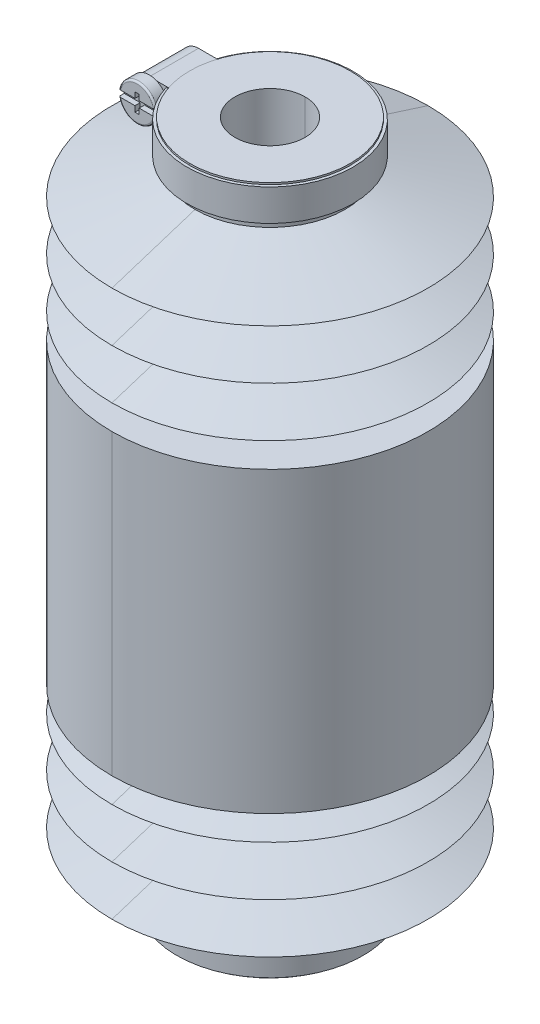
ISO-10303-21;
HEADER;
FILE_DESCRIPTION(('STEP AP214'),'2;1');
FILE_NAME('part.step','',(''),(''),'','','');
FILE_SCHEMA(('AUTOMOTIVE_DESIGN { 1 0 10303 214 1 1 1 1 }'));
ENDSEC;
DATA;
#1=APPLICATION_CONTEXT('core data for automotive mechanical design processes');
#2=APPLICATION_PROTOCOL_DEFINITION('international standard','automotive_design',2000,#1);
#3=PRODUCT_CONTEXT('',#1,'mechanical');
#4=PRODUCT('Part','Part','',(#3));
#5=PRODUCT_RELATED_PRODUCT_CATEGORY('part','',(#4));
#6=PRODUCT_DEFINITION_FORMATION('','',#4);
#7=PRODUCT_DEFINITION_CONTEXT('part definition',#1,'design');
#8=PRODUCT_DEFINITION('design','',#6,#7);
#9=PRODUCT_DEFINITION_SHAPE('','',#8);
#10=(LENGTH_UNIT() NAMED_UNIT(*) SI_UNIT(.MILLI.,.METRE.));
#11=(NAMED_UNIT(*) PLANE_ANGLE_UNIT() SI_UNIT($,.RADIAN.));
#12=(NAMED_UNIT(*) SI_UNIT($,.STERADIAN.) SOLID_ANGLE_UNIT());
#13=UNCERTAINTY_MEASURE_WITH_UNIT(LENGTH_MEASURE(1.E-05),#10,'distance_accuracy_value','');
#14=(GEOMETRIC_REPRESENTATION_CONTEXT(3) GLOBAL_UNCERTAINTY_ASSIGNED_CONTEXT((#13)) GLOBAL_UNIT_ASSIGNED_CONTEXT((#10,
#11,#12)) REPRESENTATION_CONTEXT('',''));
#15=CARTESIAN_POINT('',(0.,0.,0.));
#16=DIRECTION('',(0.,0.,1.));
#17=DIRECTION('',(1.,0.,0.));
#18=AXIS2_PLACEMENT_3D('',#15,#16,#17);
#19=CARTESIAN_POINT('',(-27.35,189.,10.5));
#20=DIRECTION('',(0.,0.,-1.));
#21=DIRECTION('',(0.,-1.,0.));
#22=AXIS2_PLACEMENT_3D('',#19,#20,#21);
#23=PLANE('',#22);
#24=DIRECTION('',(-1.,0.,0.));
#25=VECTOR('',#24,1.);
#26=CARTESIAN_POINT('',(-27.95,188.1,10.5));
#27=LINE('',#26,#25);
#28=CARTESIAN_POINT('',(-27.95,188.1,10.5));
#29=VERTEX_POINT('',#28);
#30=CARTESIAN_POINT('',(-32.01395754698,188.1,10.5));
#31=VERTEX_POINT('',#30);
#32=EDGE_CURVE('E11',#29,#31,#27,.T.);
#33=ORIENTED_EDGE('',*,*,#32,.T.);
#34=CARTESIAN_POINT('',(-27.35,189.,10.5));
#35=DIRECTION('',(0.,0.,1.));
#36=DIRECTION('',(-0.9818857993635,-0.1894736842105,0.));
#37=AXIS2_PLACEMENT_3D('',#34,#35,#36);
#38=CIRCLE('',#37,4.75);
#39=CARTESIAN_POINT('',(-22.68604245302,188.1,10.5));
#40=VERTEX_POINT('',#39);
#41=EDGE_CURVE('E27',#31,#40,#38,.T.);
#42=ORIENTED_EDGE('',*,*,#41,.T.);
#43=DIRECTION('',(-1.,0.,0.));
#44=VECTOR('',#43,1.);
#45=CARTESIAN_POINT('',(-22.68604245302,188.1,10.5));
#46=LINE('',#45,#44);
#47=CARTESIAN_POINT('',(-26.75,188.1,10.5));
#48=VERTEX_POINT('',#47);
#49=EDGE_CURVE('E843',#40,#48,#46,.T.);
#50=ORIENTED_EDGE('',*,*,#49,.T.);
#51=DIRECTION('',(0.,-1.,0.));
#52=VECTOR('',#51,1.);
#53=CARTESIAN_POINT('',(-26.75,188.1,10.5));
#54=LINE('',#53,#52);
#55=CARTESIAN_POINT('',(-26.75,186.5,10.5));
#56=VERTEX_POINT('',#55);
#57=EDGE_CURVE('E839',#48,#56,#54,.T.);
#58=ORIENTED_EDGE('',*,*,#57,.T.);
#59=DIRECTION('',(-1.,0.,0.));
#60=VECTOR('',#59,1.);
#61=CARTESIAN_POINT('',(-26.75,186.5,10.5));
#62=LINE('',#61,#60);
#63=CARTESIAN_POINT('',(-27.95,186.5,10.5));
#64=VERTEX_POINT('',#63);
#65=EDGE_CURVE('E844',#56,#64,#62,.T.);
#66=ORIENTED_EDGE('',*,*,#65,.T.);
#67=DIRECTION('',(0.,1.,0.));
#68=VECTOR('',#67,1.);
#69=CARTESIAN_POINT('',(-27.95,186.5,10.5));
#70=LINE('',#69,#68);
#71=EDGE_CURVE('E1781',#64,#29,#70,.T.);
#72=ORIENTED_EDGE('',*,*,#71,.T.);
#73=EDGE_LOOP('',(#33,#42,#50,#58,#66,#72));
#74=FACE_BOUND('',#73,.T.);
#75=ADVANCED_FACE('F16',(#74),#23,.F.);
#76=CARTESIAN_POINT('',(-27.95,188.1,9.));
#77=DIRECTION('',(-1.,0.,0.));
#78=DIRECTION('',(0.,0.,1.));
#79=AXIS2_PLACEMENT_3D('',#76,#77,#78);
#80=PLANE('',#79);
#81=DIRECTION('',(0.,0.,-1.));
#82=VECTOR('',#81,1.);
#83=CARTESIAN_POINT('',(-27.95,186.5,10.5));
#84=LINE('',#83,#82);
#85=CARTESIAN_POINT('',(-27.95,186.5,9.));
#86=VERTEX_POINT('',#85);
#87=EDGE_CURVE('E1472',#64,#86,#84,.T.);
#88=ORIENTED_EDGE('',*,*,#87,.T.);
#89=DIRECTION('',(0.,1.,0.));
#90=VECTOR('',#89,1.);
#91=CARTESIAN_POINT('',(-27.95,186.5,9.));
#92=LINE('',#91,#90);
#93=CARTESIAN_POINT('',(-27.95,188.1,9.));
#94=VERTEX_POINT('',#93);
#95=EDGE_CURVE('E1468',#86,#94,#92,.T.);
#96=ORIENTED_EDGE('',*,*,#95,.T.);
#97=DIRECTION('',(0.,0.,-1.));
#98=VECTOR('',#97,1.);
#99=CARTESIAN_POINT('',(-27.95,188.1,10.5));
#100=LINE('',#99,#98);
#101=EDGE_CURVE('E1473',#29,#94,#100,.T.);
#102=ORIENTED_EDGE('',*,*,#101,.F.);
#103=ORIENTED_EDGE('',*,*,#71,.F.);
#104=EDGE_LOOP('',(#88,#96,#102,#103));
#105=FACE_BOUND('',#104,.T.);
#106=ADVANCED_FACE('F1351',(#105),#80,.F.);
#107=CARTESIAN_POINT('',(-32.52228189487,188.1,9.));
#108=DIRECTION('',(0.,-1.,0.));
#109=DIRECTION('',(0.,0.,-1.));
#110=AXIS2_PLACEMENT_3D('',#107,#108,#109);
#111=PLANE('',#110);
#112=ORIENTED_EDGE('',*,*,#32,.F.);
#113=ORIENTED_EDGE('',*,*,#101,.T.);
#114=DIRECTION('',(-1.,0.,0.));
#115=VECTOR('',#114,1.);
#116=CARTESIAN_POINT('',(-27.95,188.1,9.));
#117=LINE('',#116,#115);
#118=CARTESIAN_POINT('',(-32.52228189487,188.1,9.));
#119=VERTEX_POINT('',#118);
#120=EDGE_CURVE('E1215',#94,#119,#117,.T.);
#121=ORIENTED_EDGE('',*,*,#120,.T.);
#122=DIRECTION('',(0.,0.,-1.));
#123=VECTOR('',#122,1.);
#124=CARTESIAN_POINT('',(-32.52228189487,188.1,10.));
#125=LINE('',#124,#123);
#126=CARTESIAN_POINT('',(-32.52228189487,188.1,10.));
#127=VERTEX_POINT('',#126);
#128=EDGE_CURVE('E752',#127,#119,#125,.T.);
#129=ORIENTED_EDGE('',*,*,#128,.F.);
#130=CARTESIAN_POINT('',(-32.01395754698,188.1,10.5));
#131=CARTESIAN_POINT('',(-32.02266395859,188.1,10.5));
#132=CARTESIAN_POINT('',(-32.04004759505,188.1,10.49956220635));
#133=CARTESIAN_POINT('',(-32.06606947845,188.1,10.49759407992));
#134=CARTESIAN_POINT('',(-32.09193582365,188.1,10.49432061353));
#135=CARTESIAN_POINT('',(-32.11756564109,188.1,10.48975589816));
#136=CARTESIAN_POINT('',(-32.14288926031,188.1,10.48391693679));
#137=CARTESIAN_POINT('',(-32.16784054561,188.1,10.47682384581));
#138=CARTESIAN_POINT('',(-32.19234677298,188.1,10.46850353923));
#139=CARTESIAN_POINT('',(-32.21636426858,188.1,10.45897649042));
#140=CARTESIAN_POINT('',(-32.23983847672,188.1,10.44826744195));
#141=CARTESIAN_POINT('',(-32.26270905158,188.1,10.4364069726));
#142=CARTESIAN_POINT('',(-32.28491922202,188.1,10.42342776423));
#143=CARTESIAN_POINT('',(-32.30641538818,188.1,10.40936415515));
#144=CARTESIAN_POINT('',(-32.32714496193,188.1,10.39425329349));
#145=CARTESIAN_POINT('',(-32.34705674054,188.1,10.37813515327));
#146=CARTESIAN_POINT('',(-32.3661012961,188.1,10.36105240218));
#147=CARTESIAN_POINT('',(-32.38423109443,188.1,10.34305045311));
#148=CARTESIAN_POINT('',(-32.40140067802,188.1,10.32417748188));
#149=CARTESIAN_POINT('',(-32.41756690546,188.1,10.30448439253));
#150=CARTESIAN_POINT('',(-32.43268943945,188.1,10.2840244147));
#151=CARTESIAN_POINT('',(-32.44673097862,188.1,10.2628527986));
#152=CARTESIAN_POINT('',(-32.45965668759,188.1,10.24102781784));
#153=CARTESIAN_POINT('',(-32.47143472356,188.1,10.2186106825));
#154=CARTESIAN_POINT('',(-32.48203864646,188.1,10.19566080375));
#155=CARTESIAN_POINT('',(-32.49144598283,188.1,10.17223627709));
#156=CARTESIAN_POINT('',(-32.49963420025,188.1,10.14840441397));
#157=CARTESIAN_POINT('',(-32.5065844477,188.1,10.12423844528));
#158=CARTESIAN_POINT('',(-32.51228952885,188.1,10.09978538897));
#159=CARTESIAN_POINT('',(-32.51674385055,188.1,10.07507401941));
#160=CARTESIAN_POINT('',(-32.51993437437,188.1,10.05017483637));
#161=CARTESIAN_POINT('',(-32.52185419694,188.1,10.02512778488));
#162=CARTESIAN_POINT('',(-32.52228189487,188.1,10.0083862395));
#163=CARTESIAN_POINT('',(-32.52228189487,188.1,10.));
#164=(BOUNDED_CURVE() B_SPLINE_CURVE(3,(#130,#131,#132,#133,#134,#135,#136,#137,#138,#139,#140,
#141,#142,#143,#144,#145,#146,#147,#148,#149,#150,#151,#152,#153,#154,#155,#156,#157,#158,#159,
#160,#161,#162,#163),.UNSPECIFIED.,.F.,.F.) B_SPLINE_CURVE_WITH_KNOTS((4,1,1,1,1,1,1,1,1,1,1,1,
1,1,1,1,1,1,1,1,1,1,1,1,1,1,1,1,1,1,1,4),(0.,0.03225806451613,0.06451612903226,0.09677419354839,
0.1290322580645,0.1612903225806,0.1935483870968,0.2258064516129,0.258064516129,0.2903225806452,
0.3225806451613,0.3548387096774,0.3870967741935,0.4193548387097,0.4516129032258,0.4838709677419,
0.5161290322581,0.5483870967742,0.5806451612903,0.6129032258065,0.6451612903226,0.6774193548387,
0.7096774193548,0.741935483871,0.7741935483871,0.8064516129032,0.8387096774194,0.8709677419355,
0.9032258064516,0.9354838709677,0.9677419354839,1.),
.UNSPECIFIED.) CURVE() GEOMETRIC_REPRESENTATION_ITEM() RATIONAL_B_SPLINE_CURVE((1.,1.,1.,1.,1.,
1.,1.,1.,1.,1.,1.,1.,1.,1.,1.,1.,1.,1.,1.,1.,1.,1.,1.,1.,1.,1.,1.,1.,1.,1.,1.,1.,1.,1.)) REPRESENTATION_ITEM(''));
#165=EDGE_CURVE('E817',#31,#127,#164,.T.);
#166=ORIENTED_EDGE('',*,*,#165,.F.);
#167=EDGE_LOOP('',(#112,#113,#121,#129,#166));
#168=FACE_BOUND('',#167,.T.);
#169=ADVANCED_FACE('F926',(#168),#111,.F.);
#170=CARTESIAN_POINT('',(-27.35,189.,10.));
#171=DIRECTION('',(0.,0.,-1.));
#172=DIRECTION('',(-1.,0.,0.));
#173=AXIS2_PLACEMENT_3D('',#170,#171,#172);
#174=TOROIDAL_SURFACE('',#173,4.75,0.5);
#175=CARTESIAN_POINT('',(-27.35,189.,10.));
#176=DIRECTION('',(0.,0.,1.));
#177=DIRECTION('',(-0.985196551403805,-0.171428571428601,0.));
#178=AXIS2_PLACEMENT_3D('',#175,#176,#177);
#179=CIRCLE('',#178,5.25);
#180=CARTESIAN_POINT('',(-22.17771810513,188.1,10.));
#181=VERTEX_POINT('',#180);
#182=EDGE_CURVE('E1213',#127,#181,#179,.T.);
#183=ORIENTED_EDGE('',*,*,#182,.T.);
#184=CARTESIAN_POINT('',(-22.17771810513,188.1,10.));
#185=CARTESIAN_POINT('',(-22.1777179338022,188.099999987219,10.0079267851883));
#186=CARTESIAN_POINT('',(-22.1779096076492,188.09999899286,10.015853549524));
#187=CARTESIAN_POINT('',(-22.1786766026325,188.09999561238,10.031715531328));
#188=CARTESIAN_POINT('',(-22.1792532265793,188.099993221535,10.039650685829));
#189=CARTESIAN_POINT('',(-22.1807927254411,188.099987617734,10.0555111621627));
#190=CARTESIAN_POINT('',(-22.1817569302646,188.099984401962,10.0634363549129));
#191=CARTESIAN_POINT('',(-22.1840730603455,188.099977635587,10.0792583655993));
#192=CARTESIAN_POINT('',(-22.1854263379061,188.099974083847,10.087154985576));
#193=CARTESIAN_POINT('',(-22.1885212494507,188.099967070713,10.1029010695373));
#194=CARTESIAN_POINT('',(-22.190264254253,188.099963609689,10.1107502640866));
#195=CARTESIAN_POINT('',(-22.1941383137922,188.099957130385,10.1263825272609));
#196=CARTESIAN_POINT('',(-22.1962707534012,188.099954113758,10.1341652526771));
#197=CARTESIAN_POINT('',(-22.2009224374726,188.099948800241,10.1496454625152));
#198=CARTESIAN_POINT('',(-22.2034430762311,188.09994650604,10.1573425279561));
#199=CARTESIAN_POINT('',(-22.2088689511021,188.099942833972,10.1726322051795));
#200=CARTESIAN_POINT('',(-22.2117755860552,188.099941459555,10.1802243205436));
#201=CARTESIAN_POINT('',(-22.2179702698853,188.099939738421,10.1952848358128));
#202=CARTESIAN_POINT('',(-22.2212597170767,188.099939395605,10.2027526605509));
#203=CARTESIAN_POINT('',(-22.2282158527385,188.099939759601,10.2175453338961));
#204=CARTESIAN_POINT('',(-22.2318839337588,188.099940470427,10.224869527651));
#205=CARTESIAN_POINT('',(-22.2395921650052,188.09994286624,10.2393557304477));
#206=CARTESIAN_POINT('',(-22.2436336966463,188.099944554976,10.2465170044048));
#207=CARTESIAN_POINT('',(-22.2520826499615,188.099948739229,10.260658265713));
#208=CARTESIAN_POINT('',(-22.2564914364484,188.099951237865,10.2676374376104));
#209=CARTESIAN_POINT('',(-22.2656677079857,188.099956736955,10.2813955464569));
#210=CARTESIAN_POINT('',(-22.2704365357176,188.099959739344,10.2881735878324));
#211=CARTESIAN_POINT('',(-22.2803246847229,188.099965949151,10.3015107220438));
#212=CARTESIAN_POINT('',(-22.2854453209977,188.099969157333,10.3080688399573));
#213=CARTESIAN_POINT('',(-22.2960278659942,188.099974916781,10.3209476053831));
#214=CARTESIAN_POINT('',(-22.3014910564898,188.099977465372,10.3272671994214));
#215=CARTESIAN_POINT('',(-22.312748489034,188.099982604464,10.3396510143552));
#216=CARTESIAN_POINT('',(-22.3185439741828,188.099985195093,10.3457141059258));
#217=CARTESIAN_POINT('',(-22.3294830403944,188.099984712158,10.3565993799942));
#218=CARTESIAN_POINT('',(-22.3345832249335,188.09998247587,10.3614652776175));
#219=CARTESIAN_POINT('',(-22.3451116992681,188.099972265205,10.3710959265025));
#220=CARTESIAN_POINT('',(-22.3505449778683,188.099964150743,10.3758552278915));
#221=CARTESIAN_POINT('',(-22.3617438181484,188.099945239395,10.3852482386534));
#222=CARTESIAN_POINT('',(-22.3675142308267,188.099934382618,10.3898761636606));
#223=CARTESIAN_POINT('',(-22.379390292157,188.09991145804,10.3989808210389));
#224=CARTESIAN_POINT('',(-22.3855006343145,188.099899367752,10.4034514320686));
#225=CARTESIAN_POINT('',(-22.3980578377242,188.099875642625,10.4122147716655));
#226=CARTESIAN_POINT('',(-22.404509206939,188.099864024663,10.4165010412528));
#227=CARTESIAN_POINT('',(-22.4177480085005,188.099842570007,10.424867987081));
#228=CARTESIAN_POINT('',(-22.424539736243,188.099832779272,10.4289418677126));
#229=CARTESIAN_POINT('',(-22.4384568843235,188.099816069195,10.4368553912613));
#230=CARTESIAN_POINT('',(-22.4455863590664,188.099809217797,10.4406879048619));
#231=CARTESIAN_POINT('',(-22.4601745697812,188.099799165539,10.4480892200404));
#232=CARTESIAN_POINT('',(-22.4676370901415,188.099796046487,10.4516505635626));
#233=CARTESIAN_POINT('',(-22.4828847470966,188.099793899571,10.458479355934));
#234=CARTESIAN_POINT('',(-22.4906733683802,188.099794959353,10.4617390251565));
#235=CARTESIAN_POINT('',(-22.5065642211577,188.099801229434,10.467933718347));
#236=CARTESIAN_POINT('',(-22.5146696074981,188.099806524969,10.4708606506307));
#237=CARTESIAN_POINT('',(-22.531182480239,188.099820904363,10.4763587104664));
#238=CARTESIAN_POINT('',(-22.5395927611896,188.099830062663,10.4789214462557));
#239=CARTESIAN_POINT('',(-22.5567012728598,188.0998513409,10.4836597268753));
#240=CARTESIAN_POINT('',(-22.5654019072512,188.099863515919,10.4858265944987));
#241=CARTESIAN_POINT('',(-22.5830742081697,188.099889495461,10.4897417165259));
#242=CARTESIAN_POINT('',(-22.5920478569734,188.099903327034,10.4914810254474));
#243=CARTESIAN_POINT('',(-22.6102463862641,188.09993073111,10.4945098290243));
#244=CARTESIAN_POINT('',(-22.6194727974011,188.099944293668,10.4957901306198));
#245=CARTESIAN_POINT('',(-22.638154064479,188.099968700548,10.4978700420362));
#246=CARTESIAN_POINT('',(-22.6476099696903,188.0999794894,10.4986602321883));
#247=CARTESIAN_POINT('',(-22.6667243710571,188.099995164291,10.499730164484));
#248=CARTESIAN_POINT('',(-22.6763834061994,188.09999993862,10.5000002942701));
#249=CARTESIAN_POINT('',(-22.68604245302,188.1,10.5));
#250=B_SPLINE_CURVE_WITH_KNOTS('',3,(#184,#185,#186,#187,#188,#189,#190,#191,#192,#193,#194,
#195,#196,#197,#198,#199,#200,#201,#202,#203,#204,#205,#206,#207,#208,#209,#210,#211,#212,#213,
#214,#215,#216,#217,#218,#219,#220,#221,#222,#223,#224,#225,#226,#227,#228,#229,#230,#231,#232,
#233,#234,#235,#236,#237,#238,#239,#240,#241,#242,#243,#244,#245,#246,#247,#248,#249),
.UNSPECIFIED.,.F.,.F.,(4,2,2,2,2,2,2,2,2,2,2,2,2,2,2,2,2,2,2,2,2,2,2,2,2,2,2,2,2,2,2,2,4),(0.,
0.0237780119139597,0.0476369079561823,0.0715783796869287,0.0956040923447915,0.119715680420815,
0.143914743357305,0.168202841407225,0.192581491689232,0.217052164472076,0.24161627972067,
0.266275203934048,0.29103024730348,0.315882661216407,0.340833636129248,0.365884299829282,
0.391035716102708,0.412176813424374,0.433839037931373,0.456022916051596,0.478728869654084,
0.501957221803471,0.525708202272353,0.549981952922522,0.574778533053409,0.600097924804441,
0.625940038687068,0.652304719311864,0.679191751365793,0.706600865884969,0.734531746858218,
0.762984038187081,0.791957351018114),.UNSPECIFIED.);
#251=EDGE_CURVE('E909',#181,#40,#250,.T.);
#252=ORIENTED_EDGE('',*,*,#251,.T.);
#253=ORIENTED_EDGE('',*,*,#41,.F.);
#254=ORIENTED_EDGE('',*,*,#165,.T.);
#255=EDGE_LOOP('',(#183,#252,#253,#254));
#256=FACE_BOUND('',#255,.T.);
#257=ADVANCED_FACE('F915',(#256),#174,.T.);
#258=CARTESIAN_POINT('',(-26.75,188.1,9.));
#259=DIRECTION('',(0.,-1.,0.));
#260=DIRECTION('',(0.,0.,-1.));
#261=AXIS2_PLACEMENT_3D('',#258,#259,#260);
#262=PLANE('',#261);
#263=DIRECTION('',(0.,0.,1.));
#264=VECTOR('',#263,1.);
#265=CARTESIAN_POINT('',(-22.17771810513,188.1,9.));
#266=LINE('',#265,#264);
#267=CARTESIAN_POINT('',(-22.17771810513,188.1,9.));
#268=VERTEX_POINT('',#267);
#269=EDGE_CURVE('E660',#268,#181,#266,.T.);
#270=ORIENTED_EDGE('',*,*,#269,.F.);
#271=DIRECTION('',(-1.,0.,0.));
#272=VECTOR('',#271,1.);
#273=CARTESIAN_POINT('',(-22.17771810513,188.1,9.));
#274=LINE('',#273,#272);
#275=CARTESIAN_POINT('',(-26.75,188.1,9.));
#276=VERTEX_POINT('',#275);
#277=EDGE_CURVE('E813',#268,#276,#274,.T.);
#278=ORIENTED_EDGE('',*,*,#277,.T.);
#279=DIRECTION('',(0.,0.,-1.));
#280=VECTOR('',#279,1.);
#281=CARTESIAN_POINT('',(-26.75,188.1,10.5));
#282=LINE('',#281,#280);
#283=EDGE_CURVE('E818',#48,#276,#282,.T.);
#284=ORIENTED_EDGE('',*,*,#283,.F.);
#285=ORIENTED_EDGE('',*,*,#49,.F.);
#286=ORIENTED_EDGE('',*,*,#251,.F.);
#287=EDGE_LOOP('',(#270,#278,#284,#285,#286));
#288=FACE_BOUND('',#287,.T.);
#289=ADVANCED_FACE('F925',(#288),#262,.F.);
#290=CARTESIAN_POINT('',(-26.75,186.5,9.));
#291=DIRECTION('',(1.,0.,0.));
#292=DIRECTION('',(0.,1.,0.));
#293=AXIS2_PLACEMENT_3D('',#290,#291,#292);
#294=PLANE('',#293);
#295=ORIENTED_EDGE('',*,*,#283,.T.);
#296=DIRECTION('',(0.,-1.,0.));
#297=VECTOR('',#296,1.);
#298=CARTESIAN_POINT('',(-26.75,188.1,9.));
#299=LINE('',#298,#297);
#300=CARTESIAN_POINT('',(-26.75,186.5,9.));
#301=VERTEX_POINT('',#300);
#302=EDGE_CURVE('E1579',#276,#301,#299,.T.);
#303=ORIENTED_EDGE('',*,*,#302,.T.);
#304=DIRECTION('',(0.,0.,-1.));
#305=VECTOR('',#304,1.);
#306=CARTESIAN_POINT('',(-26.75,186.5,10.5));
#307=LINE('',#306,#305);
#308=EDGE_CURVE('E1491',#56,#301,#307,.T.);
#309=ORIENTED_EDGE('',*,*,#308,.F.);
#310=ORIENTED_EDGE('',*,*,#57,.F.);
#311=EDGE_LOOP('',(#295,#303,#309,#310));
#312=FACE_BOUND('',#311,.T.);
#313=ADVANCED_FACE('F1054',(#312),#294,.F.);
#314=CARTESIAN_POINT('',(-27.95,186.5,9.));
#315=DIRECTION('',(0.,-1.,0.));
#316=DIRECTION('',(0.,0.,-1.));
#317=AXIS2_PLACEMENT_3D('',#314,#315,#316);
#318=PLANE('',#317);
#319=ORIENTED_EDGE('',*,*,#308,.T.);
#320=DIRECTION('',(-1.,0.,0.));
#321=VECTOR('',#320,1.);
#322=CARTESIAN_POINT('',(-26.75,186.5,9.));
#323=LINE('',#322,#321);
#324=EDGE_CURVE('E1487',#301,#86,#323,.T.);
#325=ORIENTED_EDGE('',*,*,#324,.T.);
#326=ORIENTED_EDGE('',*,*,#87,.F.);
#327=ORIENTED_EDGE('',*,*,#65,.F.);
#328=EDGE_LOOP('',(#319,#325,#326,#327));
#329=FACE_BOUND('',#328,.T.);
#330=ADVANCED_FACE('F1057',(#329),#318,.F.);
#331=CARTESIAN_POINT('',(-27.35,189.,9.));
#332=DIRECTION('',(0.,0.,1.));
#333=DIRECTION('',(1.,0.,0.));
#334=AXIS2_PLACEMENT_3D('',#331,#332,#333);
#335=PLANE('',#334);
#336=DIRECTION('',(1.,0.,0.));
#337=VECTOR('',#336,1.);
#338=CARTESIAN_POINT('',(-26.75,189.9,9.));
#339=LINE('',#338,#337);
#340=CARTESIAN_POINT('',(-26.75,189.9,9.));
#341=VERTEX_POINT('',#340);
#342=CARTESIAN_POINT('',(-22.17771810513,189.9,9.));
#343=VERTEX_POINT('',#342);
#344=EDGE_CURVE('E888',#341,#343,#339,.T.);
#345=ORIENTED_EDGE('',*,*,#344,.F.);
#346=DIRECTION('',(0.,-1.,0.));
#347=VECTOR('',#346,1.);
#348=CARTESIAN_POINT('',(-26.75,191.5,9.));
#349=LINE('',#348,#347);
#350=CARTESIAN_POINT('',(-26.75,191.5,9.));
#351=VERTEX_POINT('',#350);
#352=EDGE_CURVE('E1642',#351,#341,#349,.T.);
#353=ORIENTED_EDGE('',*,*,#352,.F.);
#354=DIRECTION('',(1.,0.,0.));
#355=VECTOR('',#354,1.);
#356=CARTESIAN_POINT('',(-27.95,191.5,9.));
#357=LINE('',#356,#355);
#358=CARTESIAN_POINT('',(-27.95,191.5,9.));
#359=VERTEX_POINT('',#358);
#360=EDGE_CURVE('E713',#359,#351,#357,.T.);
#361=ORIENTED_EDGE('',*,*,#360,.F.);
#362=DIRECTION('',(0.,1.,0.));
#363=VECTOR('',#362,1.);
#364=CARTESIAN_POINT('',(-27.95,189.9,9.));
#365=LINE('',#364,#363);
#366=CARTESIAN_POINT('',(-27.95,189.9,9.));
#367=VERTEX_POINT('',#366);
#368=EDGE_CURVE('E798',#367,#359,#365,.T.);
#369=ORIENTED_EDGE('',*,*,#368,.F.);
#370=DIRECTION('',(1.,0.,0.));
#371=VECTOR('',#370,1.);
#372=CARTESIAN_POINT('',(-32.52228189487,189.9,9.));
#373=LINE('',#372,#371);
#374=CARTESIAN_POINT('',(-32.52228189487,189.9,9.));
#375=VERTEX_POINT('',#374);
#376=EDGE_CURVE('E795',#375,#367,#373,.T.);
#377=ORIENTED_EDGE('',*,*,#376,.F.);
#378=CARTESIAN_POINT('',(-27.35,189.,9.));
#379=DIRECTION('',(0.,0.,1.));
#380=DIRECTION('',(-0.985196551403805,0.171428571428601,0.));
#381=AXIS2_PLACEMENT_3D('',#378,#379,#380);
#382=CIRCLE('',#381,5.25);
#383=CARTESIAN_POINT('',(-32.6,189.,9.));
#384=VERTEX_POINT('',#383);
#385=EDGE_CURVE('E1492',#375,#384,#382,.T.);
#386=ORIENTED_EDGE('',*,*,#385,.T.);
#387=CARTESIAN_POINT('',(-27.35,189.,9.));
#388=DIRECTION('',(0.,0.,1.));
#389=DIRECTION('',(-1.,0.,0.));
#390=AXIS2_PLACEMENT_3D('',#387,#388,#389);
#391=CIRCLE('',#390,5.25);
#392=EDGE_CURVE('E1735',#384,#119,#391,.T.);
#393=ORIENTED_EDGE('',*,*,#392,.T.);
#394=ORIENTED_EDGE('',*,*,#120,.F.);
#395=ORIENTED_EDGE('',*,*,#95,.F.);
#396=ORIENTED_EDGE('',*,*,#324,.F.);
#397=ORIENTED_EDGE('',*,*,#302,.F.);
#398=ORIENTED_EDGE('',*,*,#277,.F.);
#399=CARTESIAN_POINT('',(-27.35,189.,9.));
#400=DIRECTION('',(0.,0.,1.));
#401=DIRECTION('',(0.985196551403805,-0.171428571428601,0.));
#402=AXIS2_PLACEMENT_3D('',#399,#400,#401);
#403=CIRCLE('',#402,5.25);
#404=CARTESIAN_POINT('',(-22.10000025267,189.,9.));
#405=VERTEX_POINT('',#404);
#406=EDGE_CURVE('E1664',#268,#405,#403,.T.);
#407=ORIENTED_EDGE('',*,*,#406,.T.);
#408=CARTESIAN_POINT('',(-27.35,189.,9.));
#409=DIRECTION('',(0.,0.,1.));
#410=DIRECTION('',(1.,0.,0.));
#411=AXIS2_PLACEMENT_3D('',#408,#409,#410);
#412=CIRCLE('',#411,5.25);
#413=EDGE_CURVE('E1660',#405,#343,#412,.T.);
#414=ORIENTED_EDGE('',*,*,#413,.T.);
#415=EDGE_LOOP('',(#345,#353,#361,#369,#377,#386,#393,#394,#395,#396,#397,#398,#407,#414));
#416=FACE_BOUND('',#415,.T.);
#417=ADVANCED_FACE('F1305',(#416),#335,.T.);
#418=CARTESIAN_POINT('',(-27.35,189.,-7.));
#419=DIRECTION('',(0.,0.,-1.));
#420=DIRECTION('',(-1.,0.,0.));
#421=AXIS2_PLACEMENT_3D('',#418,#419,#420);
#422=CYLINDRICAL_SURFACE('',#421,5.25);
#423=DIRECTION('',(1.347551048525E-08,0.,-1.));
#424=VECTOR('',#423,1.);
#425=CARTESIAN_POINT('',(-32.6,189.,9.));
#426=LINE('',#425,#424);
#427=CARTESIAN_POINT('',(-32.59999997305,189.,7.));
#428=VERTEX_POINT('',#427);
#429=EDGE_CURVE('E721',#384,#428,#426,.T.);
#430=ORIENTED_EDGE('',*,*,#429,.F.);
#431=ORIENTED_EDGE('',*,*,#385,.F.);
#432=DIRECTION('',(0.,0.,1.));
#433=VECTOR('',#432,1.);
#434=CARTESIAN_POINT('',(-32.52228189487,189.9,9.));
#435=LINE('',#434,#433);
#436=CARTESIAN_POINT('',(-32.52228189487,189.9,10.));
#437=VERTEX_POINT('',#436);
#438=EDGE_CURVE('E1665',#375,#437,#435,.T.);
#439=ORIENTED_EDGE('',*,*,#438,.T.);
#440=CARTESIAN_POINT('',(-27.35,189.,10.));
#441=DIRECTION('',(0.,0.,1.));
#442=DIRECTION('',(0.985196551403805,0.171428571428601,0.));
#443=AXIS2_PLACEMENT_3D('',#440,#441,#442);
#444=CIRCLE('',#443,5.25);
#445=CARTESIAN_POINT('',(-22.17771810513,189.9,10.));
#446=VERTEX_POINT('',#445);
#447=EDGE_CURVE('E892',#446,#437,#444,.T.);
#448=ORIENTED_EDGE('',*,*,#447,.F.);
#449=DIRECTION('',(0.,0.,-1.));
#450=VECTOR('',#449,1.);
#451=CARTESIAN_POINT('',(-22.17771810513,189.9,10.));
#452=LINE('',#451,#450);
#453=EDGE_CURVE('E1771',#446,#343,#452,.T.);
#454=ORIENTED_EDGE('',*,*,#453,.T.);
#455=ORIENTED_EDGE('',*,*,#413,.F.);
#456=DIRECTION('',(3.63225043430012E-07,1.05039421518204E-11,-0.999999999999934));
#457=VECTOR('',#456,1.);
#458=CARTESIAN_POINT('',(-22.10000025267,189.,9.));
#459=LINE('',#458,#457);
#460=CARTESIAN_POINT('',(-22.10000004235,189.,8.420955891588));
#461=VERTEX_POINT('',#460);
#462=EDGE_CURVE('E1768',#405,#461,#459,.T.);
#463=ORIENTED_EDGE('',*,*,#462,.T.);
#464=CARTESIAN_POINT('',(-22.10000004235,189.,8.420955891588));
#465=CARTESIAN_POINT('',(-22.10000004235,189.0226656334,8.420955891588));
#466=CARTESIAN_POINT('',(-22.10029467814,189.0677377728,8.420182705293));
#467=CARTESIAN_POINT('',(-22.10157564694,189.1341840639,8.416820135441));
#468=CARTESIAN_POINT('',(-22.10369188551,189.2005791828,8.411261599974));
#469=CARTESIAN_POINT('',(-22.1066811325,189.2676595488,8.403402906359));
#470=CARTESIAN_POINT('',(-22.11062322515,189.3362069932,8.393026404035));
#471=CARTESIAN_POINT('',(-22.11556337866,189.4059935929,8.380002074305));
#472=CARTESIAN_POINT('',(-22.12153235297,189.4767962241,8.364234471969));
#473=CARTESIAN_POINT('',(-22.12857274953,189.5485971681,8.34559295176));
#474=CARTESIAN_POINT('',(-22.13672638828,189.6213612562,8.323944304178));
#475=CARTESIAN_POINT('',(-22.14602187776,189.6949588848,8.299185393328));
#476=CARTESIAN_POINT('',(-22.15647993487,189.7692491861,8.271228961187));
#477=CARTESIAN_POINT('',(-22.16811432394,189.844090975,8.240001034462));
#478=CARTESIAN_POINT('',(-22.18093013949,189.9193304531,8.205445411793));
#479=CARTESIAN_POINT('',(-22.19489207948,189.9946451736,8.167610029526));
#480=CARTESIAN_POINT('',(-22.20995626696,190.0697709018,8.126563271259));
#481=CARTESIAN_POINT('',(-22.22615523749,190.1448542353,8.082161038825));
#482=CARTESIAN_POINT('',(-22.24352533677,190.2199999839,8.034239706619));
#483=CARTESIAN_POINT('',(-22.26197517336,190.2947877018,7.982982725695));
#484=CARTESIAN_POINT('',(-22.28145716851,190.369062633,7.928451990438));
#485=CARTESIAN_POINT('',(-22.30195125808,190.4427918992,7.870628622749));
#486=CARTESIAN_POINT('',(-22.32347781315,190.5160901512,7.80937457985));
#487=CARTESIAN_POINT('',(-22.34626085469,190.5896863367,7.743955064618));
#488=CARTESIAN_POINT('',(-22.37051664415,190.6641284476,7.673621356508));
#489=CARTESIAN_POINT('',(-22.39631260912,190.7394329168,7.598023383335));
#490=CARTESIAN_POINT('',(-22.42372253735,190.8156330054,7.516768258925));
#491=CARTESIAN_POINT('',(-22.45301784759,190.8932589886,7.428835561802));
#492=CARTESIAN_POINT('',(-22.48445375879,190.9726757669,7.333177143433));
#493=CARTESIAN_POINT('',(-22.51788815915,191.0532349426,7.22989806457));
#494=CARTESIAN_POINT('',(-22.55316755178,191.1343684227,7.119123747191));
#495=CARTESIAN_POINT('',(-22.57775808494,191.1883996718,7.040535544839));
#496=CARTESIAN_POINT('',(-22.59031872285,191.2153857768,7.));
#497=(BOUNDED_CURVE() B_SPLINE_CURVE(3,(#464,#465,#466,#467,#468,#469,#470,#471,#472,#473,#474,
#475,#476,#477,#478,#479,#480,#481,#482,#483,#484,#485,#486,#487,#488,#489,#490,#491,#492,#493,
#494,#495,#496),.UNSPECIFIED.,.F.,.F.) B_SPLINE_CURVE_WITH_KNOTS((4,1,1,1,1,1,1,1,1,1,1,1,1,1,1,
1,1,1,1,1,1,1,1,1,1,1,1,1,1,1,4),(0.,0.03333333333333,0.06666666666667,0.1,0.1333333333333,
0.1666666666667,0.2,0.2333333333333,0.2666666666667,0.3,0.3333333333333,0.3666666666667,0.4,
0.4333333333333,0.4666666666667,0.5,0.5333333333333,0.5666666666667,0.6,0.6333333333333,
0.6666666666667,0.7,0.7333333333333,0.7666666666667,0.8,0.8333333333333,0.8666666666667,0.9,
0.9333333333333,0.9666666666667,1.),
.UNSPECIFIED.) CURVE() GEOMETRIC_REPRESENTATION_ITEM() RATIONAL_B_SPLINE_CURVE((1.,1.,1.,1.,1.,
1.,1.,1.,1.,1.,1.,1.,1.,1.,1.,1.,1.,1.,1.,1.,1.,1.,1.,1.,1.,1.,1.,1.,1.,1.,1.,1.,1.)) REPRESENTATION_ITEM(''));
#498=CARTESIAN_POINT('',(-22.59031872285,191.2153857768,7.));
#499=VERTEX_POINT('',#498);
#500=EDGE_CURVE('E656',#461,#499,#497,.T.);
#501=ORIENTED_EDGE('',*,*,#500,.T.);
#502=CARTESIAN_POINT('',(-27.35,189.,7.));
#503=DIRECTION('',(0.,0.,-1.));
#504=DIRECTION('',(0.405069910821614,0.914285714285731,0.));
#505=AXIS2_PLACEMENT_3D('',#502,#503,#504);
#506=CIRCLE('',#505,5.25);
#507=CARTESIAN_POINT('',(-25.22338296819,193.8,7.));
#508=VERTEX_POINT('',#507);
#509=EDGE_CURVE('E886',#508,#499,#506,.T.);
#510=ORIENTED_EDGE('',*,*,#509,.F.);
#511=CARTESIAN_POINT('',(-27.35,189.,7.));
#512=DIRECTION('',(0.,0.,-1.));
#513=DIRECTION('',(-1.,1.136868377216E-13,0.));
#514=AXIS2_PLACEMENT_3D('',#511,#512,#513);
#515=CIRCLE('',#514,5.25);
#516=EDGE_CURVE('E659',#428,#508,#515,.T.);
#517=ORIENTED_EDGE('',*,*,#516,.F.);
#518=EDGE_LOOP('',(#430,#431,#439,#448,#454,#455,#463,#501,#510,#517));
#519=FACE_BOUND('',#518,.T.);
#520=ADVANCED_FACE('F1309',(#519),#422,.T.);
#521=CARTESIAN_POINT('',(-27.35,194.25,7.));
#522=DIRECTION('',(0.,0.,1.));
#523=DIRECTION('',(1.,0.,0.));
#524=AXIS2_PLACEMENT_3D('',#521,#522,#523);
#525=PLANE('',#524);
#526=DIRECTION('',(1.,0.,0.));
#527=VECTOR('',#526,1.);
#528=CARTESIAN_POINT('',(-27.35,193.8,7.));
#529=LINE('',#528,#527);
#530=CARTESIAN_POINT('',(-27.35,193.8,7.));
#531=VERTEX_POINT('',#530);
#532=EDGE_CURVE('E887',#531,#508,#529,.T.);
#533=ORIENTED_EDGE('',*,*,#532,.F.);
#534=CARTESIAN_POINT('',(-27.35,189.,7.));
#535=DIRECTION('',(0.,0.,1.));
#536=DIRECTION('',(8.141635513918E-13,1.,0.));
#537=AXIS2_PLACEMENT_3D('',#534,#535,#536);
#538=CIRCLE('',#537,4.8);
#539=CARTESIAN_POINT('',(-27.35,184.2,7.));
#540=VERTEX_POINT('',#539);
#541=EDGE_CURVE('E1823',#531,#540,#538,.T.);
#542=ORIENTED_EDGE('',*,*,#541,.T.);
#543=DIRECTION('',(1.,0.,0.));
#544=VECTOR('',#543,1.);
#545=CARTESIAN_POINT('',(-27.35,184.2,7.));
#546=LINE('',#545,#544);
#547=CARTESIAN_POINT('',(-25.22338296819,184.2,7.));
#548=VERTEX_POINT('',#547);
#549=EDGE_CURVE('E1467',#540,#548,#546,.T.);
#550=ORIENTED_EDGE('',*,*,#549,.T.);
#551=CARTESIAN_POINT('',(-27.35,189.,7.));
#552=DIRECTION('',(0.,0.,-1.));
#553=DIRECTION('',(0.405069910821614,-0.914285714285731,0.));
#554=AXIS2_PLACEMENT_3D('',#551,#552,#553);
#555=CIRCLE('',#554,5.25);
#556=EDGE_CURVE('E639',#548,#428,#555,.T.);
#557=ORIENTED_EDGE('',*,*,#556,.T.);
#558=ORIENTED_EDGE('',*,*,#516,.T.);
#559=EDGE_LOOP('',(#533,#542,#550,#557,#558));
#560=FACE_BOUND('',#559,.T.);
#561=ADVANCED_FACE('F1336',(#560),#525,.F.);
#562=CARTESIAN_POINT('',(-27.35,189.,-7.));
#563=DIRECTION('',(0.,0.,-1.));
#564=DIRECTION('',(-1.,0.,0.));
#565=AXIS2_PLACEMENT_3D('',#562,#563,#564);
#566=CYLINDRICAL_SURFACE('',#565,5.25);
#567=CARTESIAN_POINT('',(-27.35,189.,7.));
#568=DIRECTION('',(0.,0.,-1.));
#569=DIRECTION('',(0.906605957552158,-0.42197824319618,0.));
#570=AXIS2_PLACEMENT_3D('',#567,#568,#569);
#571=CIRCLE('',#570,5.25);
#572=CARTESIAN_POINT('',(-22.59031872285,186.7846142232,7.));
#573=VERTEX_POINT('',#572);
#574=EDGE_CURVE('E632',#573,#548,#571,.T.);
#575=ORIENTED_EDGE('',*,*,#574,.F.);
#576=CARTESIAN_POINT('',(-22.59031872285,186.7846142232,7.));
#577=CARTESIAN_POINT('',(-22.57776141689,186.8115931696,7.040524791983));
#578=CARTESIAN_POINT('',(-22.55317657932,186.8656114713,7.119095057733));
#579=CARTESIAN_POINT('',(-22.51789994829,186.946737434,7.229861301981));
#580=CARTESIAN_POINT('',(-22.48447107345,187.0272818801,7.333123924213));
#581=CARTESIAN_POINT('',(-22.45304879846,187.1066618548,7.428741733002));
#582=CARTESIAN_POINT('',(-22.42378103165,187.1842098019,7.516593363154));
#583=CARTESIAN_POINT('',(-22.39640509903,187.260305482,7.59775037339));
#584=CARTESIAN_POINT('',(-22.37064327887,187.3354946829,7.673251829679));
#585=CARTESIAN_POINT('',(-22.34642384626,187.4098031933,7.743484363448));
#586=CARTESIAN_POINT('',(-22.323678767,187.4832462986,7.80879984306));
#587=CARTESIAN_POINT('',(-22.30217596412,187.5564235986,7.869991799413));
#588=CARTESIAN_POINT('',(-22.28168229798,187.6301046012,7.9278193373));
#589=CARTESIAN_POINT('',(-22.26219219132,187.7043600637,7.982377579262));
#590=CARTESIAN_POINT('',(-22.24373471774,187.779124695,8.03366002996));
#591=CARTESIAN_POINT('',(-22.22636388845,187.8542139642,8.081587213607));
#592=CARTESIAN_POINT('',(-22.21016656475,187.9292206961,8.12598851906));
#593=CARTESIAN_POINT('',(-22.19509392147,188.0043092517,8.167061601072));
#594=CARTESIAN_POINT('',(-22.18111108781,188.0796513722,8.204956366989));
#595=CARTESIAN_POINT('',(-22.16827138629,188.1549434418,8.239578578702));
#596=CARTESIAN_POINT('',(-22.15661190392,188.2298575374,8.270875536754));
#597=CARTESIAN_POINT('',(-22.14612817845,188.3042418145,8.298901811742));
#598=CARTESIAN_POINT('',(-22.13680821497,188.3779480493,8.323726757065));
#599=CARTESIAN_POINT('',(-22.12863278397,188.4508266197,8.345433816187));
#600=CARTESIAN_POINT('',(-22.12157400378,188.5227414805,8.364124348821));
#601=CARTESIAN_POINT('',(-22.11558983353,188.5936588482,8.379932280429));
#602=CARTESIAN_POINT('',(-22.11063807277,188.6635546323,8.392987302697));
#603=CARTESIAN_POINT('',(-22.1066880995,188.7321965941,8.403384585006));
#604=CARTESIAN_POINT('',(-22.10369403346,188.7993568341,8.411255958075));
#605=CARTESIAN_POINT('',(-22.10157559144,188.8658105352,8.416820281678));
#606=CARTESIAN_POINT('',(-22.10029434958,188.9322853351,8.420183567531));
#607=CARTESIAN_POINT('',(-22.10000004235,188.9773465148,8.420955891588));
#608=CARTESIAN_POINT('',(-22.10000004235,189.,8.420955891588));
#609=(BOUNDED_CURVE() B_SPLINE_CURVE(3,(#576,#577,#578,#579,#580,#581,#582,#583,#584,#585,#586,
#587,#588,#589,#590,#591,#592,#593,#594,#595,#596,#597,#598,#599,#600,#601,#602,#603,#604,#605,
#606,#607,#608),.UNSPECIFIED.,.F.,.F.) B_SPLINE_CURVE_WITH_KNOTS((4,1,1,1,1,1,1,1,1,1,1,1,1,1,1,
1,1,1,1,1,1,1,1,1,1,1,1,1,1,1,4),(0.,0.03333333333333,0.06666666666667,0.1,0.1333333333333,
0.1666666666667,0.2,0.2333333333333,0.2666666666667,0.3,0.3333333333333,0.3666666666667,0.4,
0.4333333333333,0.4666666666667,0.5,0.5333333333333,0.5666666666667,0.6,0.6333333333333,
0.6666666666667,0.7,0.7333333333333,0.7666666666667,0.8,0.8333333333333,0.8666666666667,0.9,
0.9333333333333,0.9666666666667,1.),
.UNSPECIFIED.) CURVE() GEOMETRIC_REPRESENTATION_ITEM() RATIONAL_B_SPLINE_CURVE((1.,1.,1.,1.,1.,
1.,1.,1.,1.,1.,1.,1.,1.,1.,1.,1.,1.,1.,1.,1.,1.,1.,1.,1.,1.,1.,1.,1.,1.,1.,1.,1.,1.)) REPRESENTATION_ITEM(''));
#610=EDGE_CURVE('E636',#573,#461,#609,.T.);
#611=ORIENTED_EDGE('',*,*,#610,.T.);
#612=ORIENTED_EDGE('',*,*,#462,.F.);
#613=ORIENTED_EDGE('',*,*,#406,.F.);
#614=ORIENTED_EDGE('',*,*,#269,.T.);
#615=ORIENTED_EDGE('',*,*,#182,.F.);
#616=ORIENTED_EDGE('',*,*,#128,.T.);
#617=ORIENTED_EDGE('',*,*,#392,.F.);
#618=ORIENTED_EDGE('',*,*,#429,.T.);
#619=ORIENTED_EDGE('',*,*,#556,.F.);
#620=EDGE_LOOP('',(#575,#611,#612,#613,#614,#615,#616,#617,#618,#619));
#621=FACE_BOUND('',#620,.T.);
#622=ADVANCED_FACE('F634',(#621),#566,.T.);
#623=CARTESIAN_POINT('',(0.,0.,0.));
#624=DIRECTION('',(0.,-1.,0.));
#625=DIRECTION('',(0.,0.,-1.));
#626=AXIS2_PLACEMENT_3D('',#623,#624,#625);
#627=CYLINDRICAL_SURFACE('',#626,23.65);
#628=DIRECTION('',(0.,1.,0.));
#629=VECTOR('',#628,1.);
#630=CARTESIAN_POINT('',(-22.59031872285,184.5,-7.));
#631=LINE('',#630,#629);
#632=CARTESIAN_POINT('',(-22.59031872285,184.5,-7.));
#633=VERTEX_POINT('',#632);
#634=CARTESIAN_POINT('',(-22.59031872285,193.5,-7.));
#635=VERTEX_POINT('',#634);
#636=EDGE_CURVE('E718',#633,#635,#631,.T.);
#637=ORIENTED_EDGE('',*,*,#636,.T.);
#638=CARTESIAN_POINT('',(0.,193.5,0.));
#639=DIRECTION('',(0.,-1.,0.));
#640=DIRECTION('',(-0.955193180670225,0.,-0.295983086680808));
#641=AXIS2_PLACEMENT_3D('',#638,#639,#640);
#642=CIRCLE('',#641,23.65);
#643=CARTESIAN_POINT('',(-22.59031872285,193.5,7.));
#644=VERTEX_POINT('',#643);
#645=EDGE_CURVE('E671',#635,#644,#642,.T.);
#646=ORIENTED_EDGE('',*,*,#645,.T.);
#647=DIRECTION('',(0.,-1.,0.));
#648=VECTOR('',#647,1.);
#649=CARTESIAN_POINT('',(-22.59031872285,193.5,7.));
#650=LINE('',#649,#648);
#651=EDGE_CURVE('E665',#644,#499,#650,.T.);
#652=ORIENTED_EDGE('',*,*,#651,.T.);
#653=ORIENTED_EDGE('',*,*,#500,.F.);
#654=ORIENTED_EDGE('',*,*,#610,.F.);
#655=DIRECTION('',(0.,-1.,0.));
#656=VECTOR('',#655,1.);
#657=CARTESIAN_POINT('',(-22.59031872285,186.7846142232,7.));
#658=LINE('',#657,#656);
#659=CARTESIAN_POINT('',(-22.59031872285,184.5,7.));
#660=VERTEX_POINT('',#659);
#661=EDGE_CURVE('E652',#573,#660,#658,.T.);
#662=ORIENTED_EDGE('',*,*,#661,.T.);
#663=CARTESIAN_POINT('',(0.,184.5,0.));
#664=DIRECTION('',(0.,1.,0.));
#665=DIRECTION('',(-0.955193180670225,0.,0.295983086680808));
#666=AXIS2_PLACEMENT_3D('',#663,#664,#665);
#667=CIRCLE('',#666,23.65);
#668=EDGE_CURVE('E666',#660,#633,#667,.T.);
#669=ORIENTED_EDGE('',*,*,#668,.T.);
#670=EDGE_LOOP('',(#637,#646,#652,#653,#654,#662,#669));
#671=FACE_BOUND('',#670,.T.);
#672=ADVANCED_FACE('F651',(#671),#627,.T.);
#673=CARTESIAN_POINT('',(22.85,184.5,0.));
#674=DIRECTION('',(0.,-1.,0.));
#675=DIRECTION('',(0.,0.,-1.));
#676=AXIS2_PLACEMENT_3D('',#673,#674,#675);
#677=PLANE('',#676);
#678=DIRECTION('',(1.,0.,0.));
#679=VECTOR('',#678,1.);
#680=CARTESIAN_POINT('',(-22.59031872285,184.5,-7.));
#681=LINE('',#680,#679);
#682=CARTESIAN_POINT('',(-21.75137926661,184.5,-7.));
#683=VERTEX_POINT('',#682);
#684=EDGE_CURVE('E1600',#633,#683,#681,.T.);
#685=ORIENTED_EDGE('',*,*,#684,.F.);
#686=ORIENTED_EDGE('',*,*,#668,.F.);
#687=DIRECTION('',(-1.,0.,0.));
#688=VECTOR('',#687,1.);
#689=CARTESIAN_POINT('',(-21.75137926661,184.5,7.));
#690=LINE('',#689,#688);
#691=CARTESIAN_POINT('',(-21.75137926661,184.5,7.));
#692=VERTEX_POINT('',#691);
#693=EDGE_CURVE('E645',#692,#660,#690,.T.);
#694=ORIENTED_EDGE('',*,*,#693,.F.);
#695=CARTESIAN_POINT('',(0.,184.5,0.));
#696=DIRECTION('',(0.,1.,0.));
#697=DIRECTION('',(-0.951920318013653,0.,0.306345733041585));
#698=AXIS2_PLACEMENT_3D('',#695,#696,#697);
#699=CIRCLE('',#698,22.85);
#700=CARTESIAN_POINT('',(0.,184.5,22.85));
#701=VERTEX_POINT('',#700);
#702=EDGE_CURVE('E674',#692,#701,#699,.T.);
#703=ORIENTED_EDGE('',*,*,#702,.T.);
#704=CARTESIAN_POINT('',(0.,184.5,0.));
#705=DIRECTION('',(0.,1.,0.));
#706=DIRECTION('',(0.,0.,1.));
#707=AXIS2_PLACEMENT_3D('',#704,#705,#706);
#708=CIRCLE('',#707,22.85);
#709=CARTESIAN_POINT('',(0.,184.5,-22.8499999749));
#710=VERTEX_POINT('',#709);
#711=EDGE_CURVE('E1542',#701,#710,#708,.T.);
#712=ORIENTED_EDGE('',*,*,#711,.T.);
#713=CARTESIAN_POINT('',(0.,184.5,0.));
#714=DIRECTION('',(0.,1.,0.));
#715=DIRECTION('',(0.,0.,-1.));
#716=AXIS2_PLACEMENT_3D('',#713,#714,#715);
#717=CIRCLE('',#716,22.85);
#718=EDGE_CURVE('E1546',#710,#683,#717,.T.);
#719=ORIENTED_EDGE('',*,*,#718,.T.);
#720=EDGE_LOOP('',(#685,#686,#694,#703,#712,#719));
#721=FACE_BOUND('',#720,.T.);
#722=ADVANCED_FACE('F1015',(#721),#677,.T.);
#723=CARTESIAN_POINT('',(0.,0.,0.));
#724=DIRECTION('',(0.,-1.,0.));
#725=DIRECTION('',(0.,0.,-1.));
#726=AXIS2_PLACEMENT_3D('',#723,#724,#725);
#727=CYLINDRICAL_SURFACE('',#726,22.85);
#728=ORIENTED_EDGE('',*,*,#718,.F.);
#729=DIRECTION('',(1.06581410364E-13,-1.,-5.01903514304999E-08));
#730=VECTOR('',#729,1.);
#731=CARTESIAN_POINT('',(0.,184.5,-22.8499999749));
#732=LINE('',#731,#730);
#733=CARTESIAN_POINT('',(0.,184.,-22.85));
#734=VERTEX_POINT('',#733);
#735=EDGE_CURVE('E1456',#710,#734,#732,.T.);
#736=ORIENTED_EDGE('',*,*,#735,.T.);
#737=CARTESIAN_POINT('',(0.,184.,0.));
#738=DIRECTION('',(0.,-1.,0.));
#739=DIRECTION('',(0.,0.,1.));
#740=AXIS2_PLACEMENT_3D('',#737,#738,#739);
#741=CIRCLE('',#740,22.85);
#742=CARTESIAN_POINT('',(0.,184.,22.85));
#743=VERTEX_POINT('',#742);
#744=EDGE_CURVE('E1448',#743,#734,#741,.T.);
#745=ORIENTED_EDGE('',*,*,#744,.F.);
#746=DIRECTION('',(0.,-1.,0.));
#747=VECTOR('',#746,1.);
#748=CARTESIAN_POINT('',(0.,184.5,22.85));
#749=LINE('',#748,#747);
#750=EDGE_CURVE('E1440',#701,#743,#749,.T.);
#751=ORIENTED_EDGE('',*,*,#750,.F.);
#752=ORIENTED_EDGE('',*,*,#702,.F.);
#753=DIRECTION('',(0.,-1.,0.));
#754=VECTOR('',#753,1.);
#755=CARTESIAN_POINT('',(-21.75137926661,184.5,7.));
#756=LINE('',#755,#754);
#757=CARTESIAN_POINT('',(-21.75137926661,184.2,7.));
#758=VERTEX_POINT('',#757);
#759=EDGE_CURVE('E1452',#692,#758,#756,.T.);
#760=ORIENTED_EDGE('',*,*,#759,.T.);
#761=CARTESIAN_POINT('',(0.,184.2,0.));
#762=DIRECTION('',(0.,1.,0.));
#763=DIRECTION('',(-0.951920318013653,0.,-0.306345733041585));
#764=AXIS2_PLACEMENT_3D('',#761,#762,#763);
#765=CIRCLE('',#764,22.85);
#766=CARTESIAN_POINT('',(-21.75137926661,184.2,-7.));
#767=VERTEX_POINT('',#766);
#768=EDGE_CURVE('E821',#767,#758,#765,.T.);
#769=ORIENTED_EDGE('',*,*,#768,.F.);
#770=DIRECTION('',(0.,1.,0.));
#771=VECTOR('',#770,1.);
#772=CARTESIAN_POINT('',(-21.75137926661,184.2,-7.));
#773=LINE('',#772,#771);
#774=EDGE_CURVE('E1457',#767,#683,#773,.T.);
#775=ORIENTED_EDGE('',*,*,#774,.T.);
#776=EDGE_LOOP('',(#728,#736,#745,#751,#752,#760,#769,#775));
#777=FACE_BOUND('',#776,.T.);
#778=ADVANCED_FACE('F1981',(#777),#727,.T.);
#779=CARTESIAN_POINT('',(-27.35,193.8,-7.));
#780=DIRECTION('',(0.,0.,1.));
#781=DIRECTION('',(1.,0.,0.));
#782=AXIS2_PLACEMENT_3D('',#779,#780,#781);
#783=PLANE('',#782);
#784=ORIENTED_EDGE('',*,*,#684,.T.);
#785=ORIENTED_EDGE('',*,*,#774,.F.);
#786=DIRECTION('',(1.,0.,0.));
#787=VECTOR('',#786,1.);
#788=CARTESIAN_POINT('',(-27.35,184.2,-7.));
#789=LINE('',#788,#787);
#790=CARTESIAN_POINT('',(-27.35,184.2,-7.));
#791=VERTEX_POINT('',#790);
#792=EDGE_CURVE('E712',#791,#767,#789,.T.);
#793=ORIENTED_EDGE('',*,*,#792,.F.);
#794=CARTESIAN_POINT('',(-27.35,189.,-7.));
#795=DIRECTION('',(0.,0.,-1.));
#796=DIRECTION('',(8.141635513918E-13,-1.,0.));
#797=AXIS2_PLACEMENT_3D('',#794,#795,#796);
#798=CIRCLE('',#797,4.8);
#799=CARTESIAN_POINT('',(-27.35,193.8,-7.));
#800=VERTEX_POINT('',#799);
#801=EDGE_CURVE('E1589',#791,#800,#798,.T.);
#802=ORIENTED_EDGE('',*,*,#801,.T.);
#803=DIRECTION('',(1.,0.,0.));
#804=VECTOR('',#803,1.);
#805=CARTESIAN_POINT('',(-27.35,193.8,-7.));
#806=LINE('',#805,#804);
#807=CARTESIAN_POINT('',(-21.75137926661,193.8,-7.));
#808=VERTEX_POINT('',#807);
#809=EDGE_CURVE('E1424',#800,#808,#806,.T.);
#810=ORIENTED_EDGE('',*,*,#809,.T.);
#811=DIRECTION('',(0.,1.,0.));
#812=VECTOR('',#811,1.);
#813=CARTESIAN_POINT('',(-21.75137926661,193.5,-7.));
#814=LINE('',#813,#812);
#815=CARTESIAN_POINT('',(-21.75137926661,193.5,-7.));
#816=VERTEX_POINT('',#815);
#817=EDGE_CURVE('E1775',#816,#808,#814,.T.);
#818=ORIENTED_EDGE('',*,*,#817,.F.);
#819=DIRECTION('',(-1.,0.,0.));
#820=VECTOR('',#819,1.);
#821=CARTESIAN_POINT('',(-21.75137926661,193.5,-7.));
#822=LINE('',#821,#820);
#823=EDGE_CURVE('E1418',#816,#635,#822,.T.);
#824=ORIENTED_EDGE('',*,*,#823,.T.);
#825=ORIENTED_EDGE('',*,*,#636,.F.);
#826=EDGE_LOOP('',(#784,#785,#793,#802,#810,#818,#824,#825));
#827=FACE_BOUND('',#826,.T.);
#828=ADVANCED_FACE('F1084',(#827),#783,.F.);
#829=CARTESIAN_POINT('',(23.65,193.5,0.));
#830=DIRECTION('',(0.,1.,0.));
#831=DIRECTION('',(1.,0.,0.));
#832=AXIS2_PLACEMENT_3D('',#829,#830,#831);
#833=PLANE('',#832);
#834=CARTESIAN_POINT('',(0.,193.5,0.));
#835=DIRECTION('',(0.,-1.,0.));
#836=DIRECTION('',(0.,0.,1.));
#837=AXIS2_PLACEMENT_3D('',#834,#835,#836);
#838=CIRCLE('',#837,22.85);
#839=CARTESIAN_POINT('',(0.,193.5,22.85));
#840=VERTEX_POINT('',#839);
#841=CARTESIAN_POINT('',(-21.75137926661,193.5,7.));
#842=VERTEX_POINT('',#841);
#843=EDGE_CURVE('E750',#840,#842,#838,.T.);
#844=ORIENTED_EDGE('',*,*,#843,.T.);
#845=DIRECTION('',(1.,0.,0.));
#846=VECTOR('',#845,1.);
#847=CARTESIAN_POINT('',(-22.59031872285,193.5,7.));
#848=LINE('',#847,#846);
#849=EDGE_CURVE('E883',#644,#842,#848,.T.);
#850=ORIENTED_EDGE('',*,*,#849,.F.);
#851=ORIENTED_EDGE('',*,*,#645,.F.);
#852=ORIENTED_EDGE('',*,*,#823,.F.);
#853=CARTESIAN_POINT('',(0.,193.5,0.));
#854=DIRECTION('',(0.,-1.,0.));
#855=DIRECTION('',(-0.951920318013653,0.,-0.306345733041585));
#856=AXIS2_PLACEMENT_3D('',#853,#854,#855);
#857=CIRCLE('',#856,22.85);
#858=CARTESIAN_POINT('',(0.,193.5,-22.84999997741));
#859=VERTEX_POINT('',#858);
#860=EDGE_CURVE('E746',#816,#859,#857,.T.);
#861=ORIENTED_EDGE('',*,*,#860,.T.);
#862=CARTESIAN_POINT('',(0.,193.5,0.));
#863=DIRECTION('',(0.,-1.,0.));
#864=DIRECTION('',(0.,0.,-1.));
#865=AXIS2_PLACEMENT_3D('',#862,#863,#864);
#866=CIRCLE('',#865,22.85);
#867=EDGE_CURVE('E751',#859,#840,#866,.T.);
#868=ORIENTED_EDGE('',*,*,#867,.T.);
#869=EDGE_LOOP('',(#844,#850,#851,#852,#861,#868));
#870=FACE_BOUND('',#869,.T.);
#871=ADVANCED_FACE('F1080',(#870),#833,.T.);
#872=CARTESIAN_POINT('',(0.,0.,0.));
#873=DIRECTION('',(0.,-1.,0.));
#874=DIRECTION('',(0.,0.,-1.));
#875=AXIS2_PLACEMENT_3D('',#872,#873,#874);
#876=CYLINDRICAL_SURFACE('',#875,22.85);
#877=DIRECTION('',(0.,-1.,0.));
#878=VECTOR('',#877,1.);
#879=CARTESIAN_POINT('',(0.,194.,22.85));
#880=LINE('',#879,#878);
#881=CARTESIAN_POINT('',(0.,194.,22.85));
#882=VERTEX_POINT('',#881);
#883=EDGE_CURVE('E1536',#882,#840,#880,.T.);
#884=ORIENTED_EDGE('',*,*,#883,.T.);
#885=ORIENTED_EDGE('',*,*,#867,.F.);
#886=DIRECTION('',(0.,-1.,4.517395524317E-08));
#887=VECTOR('',#886,1.);
#888=CARTESIAN_POINT('',(0.,194.,-22.85));
#889=LINE('',#888,#887);
#890=CARTESIAN_POINT('',(0.,194.,-22.85));
#891=VERTEX_POINT('',#890);
#892=EDGE_CURVE('E838',#891,#859,#889,.T.);
#893=ORIENTED_EDGE('',*,*,#892,.F.);
#894=CARTESIAN_POINT('',(0.,194.,0.));
#895=DIRECTION('',(0.,1.,0.));
#896=DIRECTION('',(0.,0.,1.));
#897=AXIS2_PLACEMENT_3D('',#894,#895,#896);
#898=CIRCLE('',#897,22.85);
#899=EDGE_CURVE('E1501',#882,#891,#898,.T.);
#900=ORIENTED_EDGE('',*,*,#899,.F.);
#901=EDGE_LOOP('',(#884,#885,#893,#900));
#902=FACE_BOUND('',#901,.T.);
#903=ADVANCED_FACE('F1083',(#902),#876,.T.);
#904=CARTESIAN_POINT('',(22.85,194.,0.));
#905=DIRECTION('',(0.,1.,0.));
#906=DIRECTION('',(1.,0.,0.));
#907=AXIS2_PLACEMENT_3D('',#904,#905,#906);
#908=PLANE('',#907);
#909=ORIENTED_EDGE('',*,*,#899,.T.);
#910=CARTESIAN_POINT('',(0.,194.,0.));
#911=DIRECTION('',(0.,1.,0.));
#912=DIRECTION('',(0.,0.,-1.));
#913=AXIS2_PLACEMENT_3D('',#910,#911,#912);
#914=CIRCLE('',#913,22.85);
#915=EDGE_CURVE('E1497',#891,#882,#914,.T.);
#916=ORIENTED_EDGE('',*,*,#915,.T.);
#917=EDGE_LOOP('',(#909,#916));
#918=FACE_BOUND('',#917,.T.);
#919=CARTESIAN_POINT('',(0.,194.,0.));
#920=DIRECTION('',(0.,-1.,0.));
#921=DIRECTION('',(0.,0.,1.));
#922=AXIS2_PLACEMENT_3D('',#919,#920,#921);
#923=CIRCLE('',#922,10.);
#924=CARTESIAN_POINT('',(0.,194.,10.));
#925=VERTEX_POINT('',#924);
#926=CARTESIAN_POINT('',(0.,194.,-10.));
#927=VERTEX_POINT('',#926);
#928=EDGE_CURVE('E1502',#925,#927,#923,.T.);
#929=ORIENTED_EDGE('',*,*,#928,.T.);
#930=CARTESIAN_POINT('',(0.,194.,0.));
#931=DIRECTION('',(0.,-1.,0.));
#932=DIRECTION('',(0.,0.,-1.));
#933=AXIS2_PLACEMENT_3D('',#930,#931,#932);
#934=CIRCLE('',#933,10.);
#935=EDGE_CURVE('E826',#927,#925,#934,.T.);
#936=ORIENTED_EDGE('',*,*,#935,.T.);
#937=EDGE_LOOP('',(#929,#936));
#938=FACE_BOUND('',#937,.T.);
#939=ADVANCED_FACE('F2017',(#918,#938),#908,.T.);
#940=CARTESIAN_POINT('',(0.,0.,0.));
#941=DIRECTION('',(0.,-1.,0.));
#942=DIRECTION('',(0.,0.,-1.));
#943=AXIS2_PLACEMENT_3D('',#940,#941,#942);
#944=CYLINDRICAL_SURFACE('',#943,10.);
#945=DIRECTION('',(0.,-1.,0.));
#946=VECTOR('',#945,1.);
#947=CARTESIAN_POINT('',(0.,194.,10.));
#948=LINE('',#947,#946);
#949=CARTESIAN_POINT('',(0.,0.,10.));
#950=VERTEX_POINT('',#949);
#951=EDGE_CURVE('E833',#925,#950,#948,.T.);
#952=ORIENTED_EDGE('',*,*,#951,.F.);
#953=ORIENTED_EDGE('',*,*,#935,.F.);
#954=DIRECTION('',(0.,-1.,0.));
#955=VECTOR('',#954,1.);
#956=CARTESIAN_POINT('',(0.,194.,-10.));
#957=LINE('',#956,#955);
#958=CARTESIAN_POINT('',(0.,0.,-10.));
#959=VERTEX_POINT('',#958);
#960=EDGE_CURVE('E822',#927,#959,#957,.T.);
#961=ORIENTED_EDGE('',*,*,#960,.T.);
#962=CARTESIAN_POINT('',(0.,0.,0.));
#963=DIRECTION('',(0.,1.,0.));
#964=DIRECTION('',(0.,0.,1.));
#965=AXIS2_PLACEMENT_3D('',#962,#963,#964);
#966=CIRCLE('',#965,10.);
#967=EDGE_CURVE('E760',#950,#959,#966,.T.);
#968=ORIENTED_EDGE('',*,*,#967,.F.);
#969=EDGE_LOOP('',(#952,#953,#961,#968));
#970=FACE_BOUND('',#969,.T.);
#971=ADVANCED_FACE('F1052',(#970),#944,.F.);
#972=CARTESIAN_POINT('',(10.,0.,0.));
#973=DIRECTION('',(0.,-1.,0.));
#974=DIRECTION('',(0.,0.,-1.));
#975=AXIS2_PLACEMENT_3D('',#972,#973,#974);
#976=PLANE('',#975);
#977=CARTESIAN_POINT('',(0.,0.,0.));
#978=DIRECTION('',(0.,-1.,0.));
#979=DIRECTION('',(0.,0.,1.));
#980=AXIS2_PLACEMENT_3D('',#977,#978,#979);
#981=CIRCLE('',#980,25.85);
#982=CARTESIAN_POINT('',(0.,0.,25.85));
#983=VERTEX_POINT('',#982);
#984=CARTESIAN_POINT('',(0.,0.,-25.85));
#985=VERTEX_POINT('',#984);
#986=EDGE_CURVE('E807',#983,#985,#981,.T.);
#987=ORIENTED_EDGE('',*,*,#986,.T.);
#988=CARTESIAN_POINT('',(0.,0.,0.));
#989=DIRECTION('',(0.,-1.,0.));
#990=DIRECTION('',(0.,0.,-1.));
#991=AXIS2_PLACEMENT_3D('',#988,#989,#990);
#992=CIRCLE('',#991,25.85);
#993=EDGE_CURVE('E763',#985,#983,#992,.T.);
#994=ORIENTED_EDGE('',*,*,#993,.T.);
#995=EDGE_LOOP('',(#987,#994));
#996=FACE_BOUND('',#995,.T.);
#997=ORIENTED_EDGE('',*,*,#967,.T.);
#998=CARTESIAN_POINT('',(0.,0.,0.));
#999=DIRECTION('',(0.,1.,0.));
#1000=DIRECTION('',(0.,0.,-1.));
#1001=AXIS2_PLACEMENT_3D('',#998,#999,#1000);
#1002=CIRCLE('',#1001,10.);
#1003=EDGE_CURVE('E764',#959,#950,#1002,.T.);
#1004=ORIENTED_EDGE('',*,*,#1003,.T.);
#1005=EDGE_LOOP('',(#997,#1004));
#1006=FACE_BOUND('',#1005,.T.);
#1007=ADVANCED_FACE('F2050',(#996,#1006),#976,.T.);
#1008=CARTESIAN_POINT('',(0.,0.,0.));
#1009=DIRECTION('',(0.,-1.,0.));
#1010=DIRECTION('',(0.,0.,-1.));
#1011=AXIS2_PLACEMENT_3D('',#1008,#1009,#1010);
#1012=CYLINDRICAL_SURFACE('',#1011,25.85);
#1013=DIRECTION('',(1.018444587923E-13,-1.,0.));
#1014=VECTOR('',#1013,1.);
#1015=CARTESIAN_POINT('',(0.,0.5,25.85));
#1016=LINE('',#1015,#1014);
#1017=CARTESIAN_POINT('',(0.,0.5,25.85));
#1018=VERTEX_POINT('',#1017);
#1019=EDGE_CURVE('E803',#1018,#983,#1016,.T.);
#1020=ORIENTED_EDGE('',*,*,#1019,.T.);
#1021=ORIENTED_EDGE('',*,*,#993,.F.);
#1022=DIRECTION('',(1.82372635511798E-13,-1.,-1.40132193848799E-07));
#1023=VECTOR('',#1022,1.);
#1024=CARTESIAN_POINT('',(0.,0.5,-25.84999992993));
#1025=LINE('',#1024,#1023);
#1026=CARTESIAN_POINT('',(0.,0.5,-25.84999992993));
#1027=VERTEX_POINT('',#1026);
#1028=EDGE_CURVE('E1789',#1027,#985,#1025,.T.);
#1029=ORIENTED_EDGE('',*,*,#1028,.F.);
#1030=CARTESIAN_POINT('',(0.,0.5,0.));
#1031=DIRECTION('',(0.,1.,0.));
#1032=DIRECTION('',(0.,0.,1.));
#1033=AXIS2_PLACEMENT_3D('',#1030,#1031,#1032);
#1034=CIRCLE('',#1033,25.85);
#1035=EDGE_CURVE('E804',#1018,#1027,#1034,.T.);
#1036=ORIENTED_EDGE('',*,*,#1035,.F.);
#1037=EDGE_LOOP('',(#1020,#1021,#1029,#1036));
#1038=FACE_BOUND('',#1037,.T.);
#1039=ADVANCED_FACE('F2047',(#1038),#1012,.T.);
#1040=CARTESIAN_POINT('',(25.85,0.5,0.));
#1041=DIRECTION('',(0.,-1.,0.));
#1042=DIRECTION('',(0.,0.,-1.));
#1043=AXIS2_PLACEMENT_3D('',#1040,#1041,#1042);
#1044=PLANE('',#1043);
#1045=DIRECTION('',(1.,0.,0.));
#1046=VECTOR('',#1045,1.);
#1047=CARTESIAN_POINT('',(-25.55875583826,0.5,-7.));
#1048=LINE('',#1047,#1046);
#1049=CARTESIAN_POINT('',(-25.55875583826,0.5,-7.));
#1050=VERTEX_POINT('',#1049);
#1051=CARTESIAN_POINT('',(-24.88418172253,0.5,-7.));
#1052=VERTEX_POINT('',#1051);
#1053=EDGE_CURVE('E1525',#1050,#1052,#1048,.T.);
#1054=ORIENTED_EDGE('',*,*,#1053,.F.);
#1055=CARTESIAN_POINT('',(0.,0.5,0.));
#1056=DIRECTION('',(0.,1.,0.));
#1057=DIRECTION('',(-0.96448135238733,0.,0.264150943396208));
#1058=AXIS2_PLACEMENT_3D('',#1055,#1056,#1057);
#1059=CIRCLE('',#1058,26.5);
#1060=CARTESIAN_POINT('',(-25.55875583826,0.5,7.));
#1061=VERTEX_POINT('',#1060);
#1062=EDGE_CURVE('E782',#1061,#1050,#1059,.T.);
#1063=ORIENTED_EDGE('',*,*,#1062,.F.);
#1064=DIRECTION('',(-1.,0.,0.));
#1065=VECTOR('',#1064,1.);
#1066=CARTESIAN_POINT('',(-24.88418172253,0.5,7.));
#1067=LINE('',#1066,#1065);
#1068=CARTESIAN_POINT('',(-24.88418172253,0.5,7.));
#1069=VERTEX_POINT('',#1068);
#1070=EDGE_CURVE('E837',#1069,#1061,#1067,.T.);
#1071=ORIENTED_EDGE('',*,*,#1070,.F.);
#1072=CARTESIAN_POINT('',(0.,0.5,0.));
#1073=DIRECTION('',(0.,1.,0.));
#1074=DIRECTION('',(-0.962637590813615,0.,0.270793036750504));
#1075=AXIS2_PLACEMENT_3D('',#1072,#1073,#1074);
#1076=CIRCLE('',#1075,25.85);
#1077=EDGE_CURVE('E799',#1069,#1018,#1076,.T.);
#1078=ORIENTED_EDGE('',*,*,#1077,.T.);
#1079=ORIENTED_EDGE('',*,*,#1035,.T.);
#1080=CARTESIAN_POINT('',(0.,0.5,0.));
#1081=DIRECTION('',(0.,1.,0.));
#1082=DIRECTION('',(0.,0.,-1.));
#1083=AXIS2_PLACEMENT_3D('',#1080,#1081,#1082);
#1084=CIRCLE('',#1083,25.85);
#1085=EDGE_CURVE('E1793',#1027,#1052,#1084,.T.);
#1086=ORIENTED_EDGE('',*,*,#1085,.T.);
#1087=EDGE_LOOP('',(#1054,#1063,#1071,#1078,#1079,#1086));
#1088=FACE_BOUND('',#1087,.T.);
#1089=ADVANCED_FACE('F1229',(#1088),#1044,.T.);
#1090=CARTESIAN_POINT('',(0.,0.,0.));
#1091=DIRECTION('',(0.,-1.,0.));
#1092=DIRECTION('',(0.,0.,-1.));
#1093=AXIS2_PLACEMENT_3D('',#1090,#1091,#1092);
#1094=CYLINDRICAL_SURFACE('',#1093,25.85);
#1095=ORIENTED_EDGE('',*,*,#1085,.F.);
#1096=ORIENTED_EDGE('',*,*,#1028,.T.);
#1097=ORIENTED_EDGE('',*,*,#986,.F.);
#1098=ORIENTED_EDGE('',*,*,#1019,.F.);
#1099=ORIENTED_EDGE('',*,*,#1077,.F.);
#1100=DIRECTION('',(0.,-1.,0.));
#1101=VECTOR('',#1100,1.);
#1102=CARTESIAN_POINT('',(-24.88418172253,0.5,7.));
#1103=LINE('',#1102,#1101);
#1104=CARTESIAN_POINT('',(-24.88418172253,0.2,7.));
#1105=VERTEX_POINT('',#1104);
#1106=EDGE_CURVE('E831',#1069,#1105,#1103,.T.);
#1107=ORIENTED_EDGE('',*,*,#1106,.T.);
#1108=CARTESIAN_POINT('',(0.,0.2,0.));
#1109=DIRECTION('',(0.,1.,0.));
#1110=DIRECTION('',(-0.962637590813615,0.,-0.270793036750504));
#1111=AXIS2_PLACEMENT_3D('',#1108,#1109,#1110);
#1112=CIRCLE('',#1111,25.85);
#1113=CARTESIAN_POINT('',(-24.88418172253,0.2,-7.));
#1114=VERTEX_POINT('',#1113);
#1115=EDGE_CURVE('E770',#1114,#1105,#1112,.T.);
#1116=ORIENTED_EDGE('',*,*,#1115,.F.);
#1117=DIRECTION('',(0.,1.,0.));
#1118=VECTOR('',#1117,1.);
#1119=CARTESIAN_POINT('',(-24.88418172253,0.2,-7.));
#1120=LINE('',#1119,#1118);
#1121=EDGE_CURVE('E827',#1114,#1052,#1120,.T.);
#1122=ORIENTED_EDGE('',*,*,#1121,.T.);
#1123=EDGE_LOOP('',(#1095,#1096,#1097,#1098,#1099,#1107,#1116,#1122));
#1124=FACE_BOUND('',#1123,.T.);
#1125=ADVANCED_FACE('F1316',(#1124),#1094,.T.);
#1126=CARTESIAN_POINT('',(-30.75,9.8,-7.));
#1127=DIRECTION('',(0.,0.,1.));
#1128=DIRECTION('',(1.,0.,0.));
#1129=AXIS2_PLACEMENT_3D('',#1126,#1127,#1128);
#1130=PLANE('',#1129);
#1131=DIRECTION('',(1.,0.,0.));
#1132=VECTOR('',#1131,1.);
#1133=CARTESIAN_POINT('',(-30.75,9.8,-7.));
#1134=LINE('',#1133,#1132);
#1135=CARTESIAN_POINT('',(-30.75,9.8,-7.));
#1136=VERTEX_POINT('',#1135);
#1137=CARTESIAN_POINT('',(-24.88418172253,9.8,-7.));
#1138=VERTEX_POINT('',#1137);
#1139=EDGE_CURVE('E832',#1136,#1138,#1134,.T.);
#1140=ORIENTED_EDGE('',*,*,#1139,.T.);
#1141=DIRECTION('',(0.,1.,0.));
#1142=VECTOR('',#1141,1.);
#1143=CARTESIAN_POINT('',(-24.88418172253,9.5,-7.));
#1144=LINE('',#1143,#1142);
#1145=CARTESIAN_POINT('',(-24.88418172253,9.5,-7.));
#1146=VERTEX_POINT('',#1145);
#1147=EDGE_CURVE('E695',#1146,#1138,#1144,.T.);
#1148=ORIENTED_EDGE('',*,*,#1147,.F.);
#1149=DIRECTION('',(-1.,0.,0.));
#1150=VECTOR('',#1149,1.);
#1151=CARTESIAN_POINT('',(-24.88418172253,9.5,-7.));
#1152=LINE('',#1151,#1150);
#1153=CARTESIAN_POINT('',(-25.55875583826,9.5,-7.));
#1154=VERTEX_POINT('',#1153);
#1155=EDGE_CURVE('E1521',#1146,#1154,#1152,.T.);
#1156=ORIENTED_EDGE('',*,*,#1155,.T.);
#1157=DIRECTION('',(0.,1.,0.));
#1158=VECTOR('',#1157,1.);
#1159=CARTESIAN_POINT('',(-25.55875583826,0.5,-7.));
#1160=LINE('',#1159,#1158);
#1161=EDGE_CURVE('E1427',#1050,#1154,#1160,.T.);
#1162=ORIENTED_EDGE('',*,*,#1161,.F.);
#1163=ORIENTED_EDGE('',*,*,#1053,.T.);
#1164=ORIENTED_EDGE('',*,*,#1121,.F.);
#1165=DIRECTION('',(1.,0.,0.));
#1166=VECTOR('',#1165,1.);
#1167=CARTESIAN_POINT('',(-30.75,0.2,-7.));
#1168=LINE('',#1167,#1166);
#1169=CARTESIAN_POINT('',(-30.75,0.2,-7.));
#1170=VERTEX_POINT('',#1169);
#1171=EDGE_CURVE('E765',#1170,#1114,#1168,.T.);
#1172=ORIENTED_EDGE('',*,*,#1171,.F.);
#1173=CARTESIAN_POINT('',(-30.75,5.,-7.));
#1174=DIRECTION('',(0.,0.,-1.));
#1175=DIRECTION('',(0.,-1.,0.));
#1176=AXIS2_PLACEMENT_3D('',#1173,#1174,#1175);
#1177=CIRCLE('',#1176,4.8);
#1178=EDGE_CURVE('E1711',#1170,#1136,#1177,.T.);
#1179=ORIENTED_EDGE('',*,*,#1178,.T.);
#1180=EDGE_LOOP('',(#1140,#1148,#1156,#1162,#1163,#1164,#1172,#1179));
#1181=FACE_BOUND('',#1180,.T.);
#1182=ADVANCED_FACE('F1319',(#1181),#1130,.F.);
#1183=CARTESIAN_POINT('',(-30.75,5.,-7.));
#1184=DIRECTION('',(0.,0.,-1.));
#1185=DIRECTION('',(-1.,0.,0.));
#1186=AXIS2_PLACEMENT_3D('',#1183,#1184,#1185);
#1187=CYLINDRICAL_SURFACE('',#1186,4.8);
#1188=CARTESIAN_POINT('',(-30.75,5.,7.));
#1189=DIRECTION('',(0.,0.,1.));
#1190=DIRECTION('',(0.,1.,0.));
#1191=AXIS2_PLACEMENT_3D('',#1188,#1189,#1190);
#1192=CIRCLE('',#1191,4.8);
#1193=CARTESIAN_POINT('',(-30.75,9.8,7.));
#1194=VERTEX_POINT('',#1193);
#1195=CARTESIAN_POINT('',(-30.75,0.2,7.));
#1196=VERTEX_POINT('',#1195);
#1197=EDGE_CURVE('E871',#1194,#1196,#1192,.T.);
#1198=ORIENTED_EDGE('',*,*,#1197,.F.);
#1199=DIRECTION('',(0.,0.,-1.));
#1200=VECTOR('',#1199,1.);
#1201=CARTESIAN_POINT('',(-30.75,9.8,7.));
#1202=LINE('',#1201,#1200);
#1203=EDGE_CURVE('E1714',#1194,#1136,#1202,.T.);
#1204=ORIENTED_EDGE('',*,*,#1203,.T.);
#1205=ORIENTED_EDGE('',*,*,#1178,.F.);
#1206=DIRECTION('',(0.,0.,1.));
#1207=VECTOR('',#1206,1.);
#1208=CARTESIAN_POINT('',(-30.75,0.2,-7.));
#1209=LINE('',#1208,#1207);
#1210=EDGE_CURVE('E769',#1170,#1196,#1209,.T.);
#1211=ORIENTED_EDGE('',*,*,#1210,.T.);
#1212=EDGE_LOOP('',(#1198,#1204,#1205,#1211));
#1213=FACE_BOUND('',#1212,.T.);
#1214=ADVANCED_FACE('F1343',(#1213),#1187,.T.);
#1215=CARTESIAN_POINT('',(-20.75,0.2,7.));
#1216=DIRECTION('',(0.,1.,0.));
#1217=DIRECTION('',(1.,0.,0.));
#1218=AXIS2_PLACEMENT_3D('',#1215,#1216,#1217);
#1219=PLANE('',#1218);
#1220=DIRECTION('',(1.,0.,0.));
#1221=VECTOR('',#1220,1.);
#1222=CARTESIAN_POINT('',(-28.62338296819,0.2,7.));
#1223=LINE('',#1222,#1221);
#1224=CARTESIAN_POINT('',(-28.62338296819,0.2,7.));
#1225=VERTEX_POINT('',#1224);
#1226=EDGE_CURVE('E876',#1225,#1105,#1223,.T.);
#1227=ORIENTED_EDGE('',*,*,#1226,.F.);
#1228=DIRECTION('',(1.,0.,0.));
#1229=VECTOR('',#1228,1.);
#1230=CARTESIAN_POINT('',(-30.75,0.2,7.));
#1231=LINE('',#1230,#1229);
#1232=EDGE_CURVE('E738',#1196,#1225,#1231,.T.);
#1233=ORIENTED_EDGE('',*,*,#1232,.F.);
#1234=ORIENTED_EDGE('',*,*,#1210,.F.);
#1235=ORIENTED_EDGE('',*,*,#1171,.T.);
#1236=ORIENTED_EDGE('',*,*,#1115,.T.);
#1237=EDGE_LOOP('',(#1227,#1233,#1234,#1235,#1236));
#1238=FACE_BOUND('',#1237,.T.);
#1239=ADVANCED_FACE('F1340',(#1238),#1219,.F.);
#1240=CARTESIAN_POINT('',(-30.75,10.25,7.));
#1241=DIRECTION('',(0.,0.,1.));
#1242=DIRECTION('',(1.,0.,0.));
#1243=AXIS2_PLACEMENT_3D('',#1240,#1241,#1242);
#1244=PLANE('',#1243);
#1245=DIRECTION('',(1.,0.,0.));
#1246=VECTOR('',#1245,1.);
#1247=CARTESIAN_POINT('',(-30.75,9.8,7.));
#1248=LINE('',#1247,#1246);
#1249=CARTESIAN_POINT('',(-28.62338296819,9.8,7.));
#1250=VERTEX_POINT('',#1249);
#1251=EDGE_CURVE('E727',#1194,#1250,#1248,.T.);
#1252=ORIENTED_EDGE('',*,*,#1251,.F.);
#1253=ORIENTED_EDGE('',*,*,#1197,.T.);
#1254=ORIENTED_EDGE('',*,*,#1232,.T.);
#1255=CARTESIAN_POINT('',(-30.75,5.,7.));
#1256=DIRECTION('',(0.,0.,-1.));
#1257=DIRECTION('',(0.405069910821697,-0.914285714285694,0.));
#1258=AXIS2_PLACEMENT_3D('',#1255,#1256,#1257);
#1259=CIRCLE('',#1258,5.25);
#1260=CARTESIAN_POINT('',(-35.99999997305,5.,7.));
#1261=VERTEX_POINT('',#1260);
#1262=EDGE_CURVE('E734',#1225,#1261,#1259,.T.);
#1263=ORIENTED_EDGE('',*,*,#1262,.T.);
#1264=CARTESIAN_POINT('',(-30.75,5.,7.));
#1265=DIRECTION('',(0.,0.,-1.));
#1266=DIRECTION('',(-1.,1.148710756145E-13,0.));
#1267=AXIS2_PLACEMENT_3D('',#1264,#1265,#1266);
#1268=CIRCLE('',#1267,5.25);
#1269=EDGE_CURVE('E739',#1261,#1250,#1268,.T.);
#1270=ORIENTED_EDGE('',*,*,#1269,.T.);
#1271=EDGE_LOOP('',(#1252,#1253,#1254,#1263,#1270));
#1272=FACE_BOUND('',#1271,.T.);
#1273=ADVANCED_FACE('F1096',(#1272),#1244,.F.);
#1274=CARTESIAN_POINT('',(-30.75,5.,-7.));
#1275=DIRECTION('',(0.,0.,-1.));
#1276=DIRECTION('',(-1.,0.,0.));
#1277=AXIS2_PLACEMENT_3D('',#1274,#1275,#1276);
#1278=CYLINDRICAL_SURFACE('',#1277,5.25);
#1279=DIRECTION('',(1.347550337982E-08,1.003641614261E-13,-1.));
#1280=VECTOR('',#1279,1.);
#1281=CARTESIAN_POINT('',(-36.,5.,9.));
#1282=LINE('',#1281,#1280);
#1283=CARTESIAN_POINT('',(-36.,5.,9.));
#1284=VERTEX_POINT('',#1283);
#1285=EDGE_CURVE('E740',#1284,#1261,#1282,.T.);
#1286=ORIENTED_EDGE('',*,*,#1285,.F.);
#1287=CARTESIAN_POINT('',(-30.75,5.,9.));
#1288=DIRECTION('',(0.,0.,1.));
#1289=DIRECTION('',(-0.985196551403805,0.171428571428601,0.));
#1290=AXIS2_PLACEMENT_3D('',#1287,#1288,#1289);
#1291=CIRCLE('',#1290,5.25);
#1292=CARTESIAN_POINT('',(-35.92228189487,5.9,9.));
#1293=VERTEX_POINT('',#1292);
#1294=EDGE_CURVE('E745',#1293,#1284,#1291,.T.);
#1295=ORIENTED_EDGE('',*,*,#1294,.F.);
#1296=DIRECTION('',(0.,0.,1.));
#1297=VECTOR('',#1296,1.);
#1298=CARTESIAN_POINT('',(-35.92228189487,5.9,9.));
#1299=LINE('',#1298,#1297);
#1300=CARTESIAN_POINT('',(-35.92228189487,5.9,10.));
#1301=VERTEX_POINT('',#1300);
#1302=EDGE_CURVE('E969',#1293,#1301,#1299,.T.);
#1303=ORIENTED_EDGE('',*,*,#1302,.T.);
#1304=CARTESIAN_POINT('',(-30.75,5.,10.));
#1305=DIRECTION('',(0.,0.,1.));
#1306=DIRECTION('',(0.985196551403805,0.171428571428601,0.));
#1307=AXIS2_PLACEMENT_3D('',#1304,#1305,#1306);
#1308=CIRCLE('',#1307,5.25);
#1309=CARTESIAN_POINT('',(-25.57771810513,5.9,10.));
#1310=VERTEX_POINT('',#1309);
#1311=EDGE_CURVE('E957',#1310,#1301,#1308,.T.);
#1312=ORIENTED_EDGE('',*,*,#1311,.F.);
#1313=DIRECTION('',(0.,0.,-1.));
#1314=VECTOR('',#1313,1.);
#1315=CARTESIAN_POINT('',(-25.57771810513,5.9,10.));
#1316=LINE('',#1315,#1314);
#1317=CARTESIAN_POINT('',(-25.57771810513,5.9,9.));
#1318=VERTEX_POINT('',#1317);
#1319=EDGE_CURVE('E973',#1310,#1318,#1316,.T.);
#1320=ORIENTED_EDGE('',*,*,#1319,.T.);
#1321=CARTESIAN_POINT('',(-30.75,5.,9.));
#1322=DIRECTION('',(0.,0.,1.));
#1323=DIRECTION('',(1.,0.,0.));
#1324=AXIS2_PLACEMENT_3D('',#1321,#1322,#1323);
#1325=CIRCLE('',#1324,5.25);
#1326=CARTESIAN_POINT('',(-25.50000025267,5.,9.));
#1327=VERTEX_POINT('',#1326);
#1328=EDGE_CURVE('E1397',#1327,#1318,#1325,.T.);
#1329=ORIENTED_EDGE('',*,*,#1328,.F.);
#1330=DIRECTION('',(-1.58070300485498E-07,-8.2449254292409E-10,-0.999999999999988));
#1331=VECTOR('',#1330,1.);
#1332=CARTESIAN_POINT('',(-25.50000025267,5.,9.));
#1333=LINE('',#1332,#1331);
#1334=CARTESIAN_POINT('',(-25.50000053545,4.999999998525,7.211098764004));
#1335=VERTEX_POINT('',#1334);
#1336=EDGE_CURVE('E1114',#1327,#1335,#1333,.T.);
#1337=ORIENTED_EDGE('',*,*,#1336,.T.);
#1338=CARTESIAN_POINT('',(-25.5587558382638,5.783252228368,7.00000000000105));
#1339=CARTESIAN_POINT('',(-25.556359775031,5.76736188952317,7.00874861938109));
#1340=CARTESIAN_POINT('',(-25.5540224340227,5.75133452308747,7.01726521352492));
#1341=CARTESIAN_POINT('',(-25.5494870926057,5.719127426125,7.0337601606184));
#1342=CARTESIAN_POINT('',(-25.5472882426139,5.70294950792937,7.04174181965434));
#1343=CARTESIAN_POINT('',(-25.5430313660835,5.67044126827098,7.05716743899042));
#1344=CARTESIAN_POINT('',(-25.5409725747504,5.65411244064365,7.06461433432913));
#1345=CARTESIAN_POINT('',(-25.5369971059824,5.62130280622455,7.07897125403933));
#1346=CARTESIAN_POINT('',(-25.5350797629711,5.60482318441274,7.0858838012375));
#1347=CARTESIAN_POINT('',(-25.5313883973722,5.57171223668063,7.0991727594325));
#1348=CARTESIAN_POINT('',(-25.5296138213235,5.5550818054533,7.1055512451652));
#1349=CARTESIAN_POINT('',(-25.5262090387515,5.52166956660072,7.1177729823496));
#1350=CARTESIAN_POINT('',(-25.5245784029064,5.50488838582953,7.12361782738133));
#1351=CARTESIAN_POINT('',(-25.5214625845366,5.47117479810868,7.13477266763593));
#1352=CARTESIAN_POINT('',(-25.519977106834,5.45424277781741,7.14008374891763));
#1353=CARTESIAN_POINT('',(-25.5171520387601,5.42022817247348,7.15017337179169));
#1354=CARTESIAN_POINT('',(-25.5158122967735,5.40314576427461,7.15495246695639));
#1355=CARTESIAN_POINT('',(-25.513356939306,5.36985805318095,7.16370274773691));
#1356=CARTESIAN_POINT('',(-25.5122327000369,5.3536616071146,7.16770520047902));
#1357=CARTESIAN_POINT('',(-25.5101325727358,5.32129893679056,7.17517602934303));
#1358=CARTESIAN_POINT('',(-25.5091553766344,5.30513388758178,7.17864911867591));
#1359=CARTESIAN_POINT('',(-25.5073494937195,5.27283473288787,7.18506317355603));
#1360=CARTESIAN_POINT('',(-25.5065196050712,5.25670155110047,7.18800844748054));
#1361=CARTESIAN_POINT('',(-25.5050088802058,5.22446625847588,7.19336706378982));
#1362=CARTESIAN_POINT('',(-25.5043269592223,5.20836484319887,7.19578427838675));
#1363=CARTESIAN_POINT('',(-25.5031124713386,5.17619334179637,7.20008744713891));
#1364=CARTESIAN_POINT('',(-25.5025789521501,5.16012374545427,7.20197678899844));
#1365=CARTESIAN_POINT('',(-25.501661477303,5.12801608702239,7.20522482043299));
#1366=CARTESIAN_POINT('',(-25.50127671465,5.11197833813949,7.20658637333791));
#1367=CARTESIAN_POINT('',(-25.5006568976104,5.0799345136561,7.20877931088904));
#1368=CARTESIAN_POINT('',(-25.5004211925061,5.06392860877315,7.20961299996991));
#1369=CARTESIAN_POINT('',(-25.5000993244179,5.03194874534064,7.2107513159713));
#1370=CARTESIAN_POINT('',(-25.5000126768,5.0159748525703,7.21105765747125));
#1371=CARTESIAN_POINT('',(-25.500001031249,4.999999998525,7.21109890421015));
#1372=B_SPLINE_CURVE_WITH_KNOTS('',3,(#1338,#1339,#1340,#1341,#1342,#1343,#1344,#1345,#1346,
#1347,#1348,#1349,#1350,#1351,#1352,#1353,#1354,#1355,#1356,#1357,#1358,#1359,#1360,#1361,#1362,
#1363,#1364,#1365,#1366,#1367,#1368,#1369,#1370,#1371),.UNSPECIFIED.,.F.,.F.,(4,2,2,2,2,2,2,2,2,
2,2,2,2,2,2,2,4),(0.,0.0548896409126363,0.109400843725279,0.163585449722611,0.217496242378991,
0.271186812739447,0.324711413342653,0.378124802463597,0.431482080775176,0.481638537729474,
0.531318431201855,0.580572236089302,0.629451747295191,0.678009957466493,0.726300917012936,
0.774379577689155,0.822301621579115),.UNSPECIFIED.);
#1373=CARTESIAN_POINT('',(-25.55875583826,5.783252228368,7.));
#1374=VERTEX_POINT('',#1373);
#1375=EDGE_CURVE('E1122',#1374,#1335,#1372,.T.);
#1376=ORIENTED_EDGE('',*,*,#1375,.F.);
#1377=CARTESIAN_POINT('',(-30.75,5.,7.));
#1378=DIRECTION('',(0.,0.,-1.));
#1379=DIRECTION('',(0.405069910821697,0.914285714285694,0.));
#1380=AXIS2_PLACEMENT_3D('',#1377,#1378,#1379);
#1381=CIRCLE('',#1380,5.25);
#1382=EDGE_CURVE('E726',#1250,#1374,#1381,.T.);
#1383=ORIENTED_EDGE('',*,*,#1382,.F.);
#1384=ORIENTED_EDGE('',*,*,#1269,.F.);
#1385=EDGE_LOOP('',(#1286,#1295,#1303,#1312,#1320,#1329,#1337,#1376,#1383,#1384));
#1386=FACE_BOUND('',#1385,.T.);
#1387=ADVANCED_FACE('F1091',(#1386),#1278,.T.);
#1388=CARTESIAN_POINT('',(-20.75,9.8,7.));
#1389=DIRECTION('',(0.,0.,-1.));
#1390=DIRECTION('',(0.,-1.,0.));
#1391=AXIS2_PLACEMENT_3D('',#1388,#1389,#1390);
#1392=PLANE('',#1391);
#1393=ORIENTED_EDGE('',*,*,#1382,.T.);
#1394=DIRECTION('',(0.,-1.,0.));
#1395=VECTOR('',#1394,1.);
#1396=CARTESIAN_POINT('',(-25.55875583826,9.5,7.));
#1397=LINE('',#1396,#1395);
#1398=CARTESIAN_POINT('',(-25.55875583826,9.5,7.));
#1399=VERTEX_POINT('',#1398);
#1400=EDGE_CURVE('E1117',#1399,#1374,#1397,.T.);
#1401=ORIENTED_EDGE('',*,*,#1400,.F.);
#1402=DIRECTION('',(1.,0.,0.));
#1403=VECTOR('',#1402,1.);
#1404=CARTESIAN_POINT('',(-25.55875583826,9.5,7.));
#1405=LINE('',#1404,#1403);
#1406=CARTESIAN_POINT('',(-24.88418172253,9.5,7.));
#1407=VERTEX_POINT('',#1406);
#1408=EDGE_CURVE('E722',#1399,#1407,#1405,.T.);
#1409=ORIENTED_EDGE('',*,*,#1408,.T.);
#1410=DIRECTION('',(0.,-1.,0.));
#1411=VECTOR('',#1410,1.);
#1412=CARTESIAN_POINT('',(-24.88418172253,9.8,7.));
#1413=LINE('',#1412,#1411);
#1414=CARTESIAN_POINT('',(-24.88418172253,9.8,7.));
#1415=VERTEX_POINT('',#1414);
#1416=EDGE_CURVE('E692',#1415,#1407,#1413,.T.);
#1417=ORIENTED_EDGE('',*,*,#1416,.F.);
#1418=DIRECTION('',(1.,0.,0.));
#1419=VECTOR('',#1418,1.);
#1420=CARTESIAN_POINT('',(-28.62338296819,9.8,7.));
#1421=LINE('',#1420,#1419);
#1422=EDGE_CURVE('E1707',#1250,#1415,#1421,.T.);
#1423=ORIENTED_EDGE('',*,*,#1422,.F.);
#1424=EDGE_LOOP('',(#1393,#1401,#1409,#1417,#1423));
#1425=FACE_BOUND('',#1424,.T.);
#1426=ADVANCED_FACE('F1095',(#1425),#1392,.F.);
#1427=CARTESIAN_POINT('',(-20.75,9.8,-7.));
#1428=DIRECTION('',(0.,-1.,0.));
#1429=DIRECTION('',(0.,0.,-1.));
#1430=AXIS2_PLACEMENT_3D('',#1427,#1428,#1429);
#1431=PLANE('',#1430);
#1432=ORIENTED_EDGE('',*,*,#1139,.F.);
#1433=ORIENTED_EDGE('',*,*,#1203,.F.);
#1434=ORIENTED_EDGE('',*,*,#1251,.T.);
#1435=ORIENTED_EDGE('',*,*,#1422,.T.);
#1436=CARTESIAN_POINT('',(0.,9.8,0.));
#1437=DIRECTION('',(0.,-1.,0.));
#1438=DIRECTION('',(-0.962637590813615,0.,0.270793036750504));
#1439=AXIS2_PLACEMENT_3D('',#1436,#1437,#1438);
#1440=CIRCLE('',#1439,25.85);
#1441=EDGE_CURVE('E1633',#1415,#1138,#1440,.T.);
#1442=ORIENTED_EDGE('',*,*,#1441,.T.);
#1443=EDGE_LOOP('',(#1432,#1433,#1434,#1435,#1442));
#1444=FACE_BOUND('',#1443,.T.);
#1445=ADVANCED_FACE('F1237',(#1444),#1431,.F.);
#1446=CARTESIAN_POINT('',(0.,0.,0.));
#1447=DIRECTION('',(0.,-1.,0.));
#1448=DIRECTION('',(0.,0.,-1.));
#1449=AXIS2_PLACEMENT_3D('',#1446,#1447,#1448);
#1450=CYLINDRICAL_SURFACE('',#1449,25.85);
#1451=DIRECTION('',(-1.58687877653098E-13,-1.,1.33494211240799E-07));
#1452=VECTOR('',#1451,1.);
#1453=CARTESIAN_POINT('',(0.,10.,-25.85));
#1454=LINE('',#1453,#1452);
#1455=CARTESIAN_POINT('',(0.,10.,-25.85));
#1456=VERTEX_POINT('',#1455);
#1457=CARTESIAN_POINT('',(0.,9.5,-25.84999993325));
#1458=VERTEX_POINT('',#1457);
#1459=EDGE_CURVE('E1629',#1456,#1458,#1454,.T.);
#1460=ORIENTED_EDGE('',*,*,#1459,.T.);
#1461=CARTESIAN_POINT('',(0.,9.5,0.));
#1462=DIRECTION('',(0.,-1.,0.));
#1463=DIRECTION('',(-0.962637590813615,0.,-0.270793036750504));
#1464=AXIS2_PLACEMENT_3D('',#1461,#1462,#1463);
#1465=CIRCLE('',#1464,25.85);
#1466=EDGE_CURVE('E850',#1146,#1458,#1465,.T.);
#1467=ORIENTED_EDGE('',*,*,#1466,.F.);
#1468=ORIENTED_EDGE('',*,*,#1147,.T.);
#1469=ORIENTED_EDGE('',*,*,#1441,.F.);
#1470=ORIENTED_EDGE('',*,*,#1416,.T.);
#1471=CARTESIAN_POINT('',(0.,9.5,0.));
#1472=DIRECTION('',(0.,-1.,0.));
#1473=DIRECTION('',(0.,0.,1.));
#1474=AXIS2_PLACEMENT_3D('',#1471,#1472,#1473);
#1475=CIRCLE('',#1474,25.85);
#1476=CARTESIAN_POINT('',(0.,9.5,25.85));
#1477=VERTEX_POINT('',#1476);
#1478=EDGE_CURVE('E845',#1477,#1407,#1475,.T.);
#1479=ORIENTED_EDGE('',*,*,#1478,.F.);
#1480=DIRECTION('',(1.018444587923E-13,-1.,0.));
#1481=VECTOR('',#1480,1.);
#1482=CARTESIAN_POINT('',(0.,10.,25.85));
#1483=LINE('',#1482,#1481);
#1484=CARTESIAN_POINT('',(0.,10.,25.85));
#1485=VERTEX_POINT('',#1484);
#1486=EDGE_CURVE('E849',#1485,#1477,#1483,.T.);
#1487=ORIENTED_EDGE('',*,*,#1486,.F.);
#1488=CARTESIAN_POINT('',(0.,10.,0.));
#1489=DIRECTION('',(0.,1.,0.));
#1490=DIRECTION('',(0.,0.,-1.));
#1491=AXIS2_PLACEMENT_3D('',#1488,#1489,#1490);
#1492=CIRCLE('',#1491,25.85);
#1493=EDGE_CURVE('E860',#1456,#1485,#1492,.T.);
#1494=ORIENTED_EDGE('',*,*,#1493,.F.);
#1495=EDGE_LOOP('',(#1460,#1467,#1468,#1469,#1470,#1479,#1487,#1494));
#1496=FACE_BOUND('',#1495,.T.);
#1497=ADVANCED_FACE('F1240',(#1496),#1450,.T.);
#1498=CARTESIAN_POINT('',(25.85,10.,0.));
#1499=DIRECTION('',(0.,1.,0.));
#1500=DIRECTION('',(1.,0.,0.));
#1501=AXIS2_PLACEMENT_3D('',#1498,#1499,#1500);
#1502=PLANE('',#1501);
#1503=CARTESIAN_POINT('',(0.,10.,0.));
#1504=DIRECTION('',(0.,1.,0.));
#1505=DIRECTION('',(0.,0.,1.));
#1506=AXIS2_PLACEMENT_3D('',#1503,#1504,#1505);
#1507=CIRCLE('',#1506,25.85);
#1508=EDGE_CURVE('E696',#1485,#1456,#1507,.T.);
#1509=ORIENTED_EDGE('',*,*,#1508,.T.);
#1510=ORIENTED_EDGE('',*,*,#1493,.T.);
#1511=EDGE_LOOP('',(#1509,#1510));
#1512=FACE_BOUND('',#1511,.T.);
#1513=CARTESIAN_POINT('',(0.,10.,0.));
#1514=DIRECTION('',(0.,-1.,0.));
#1515=DIRECTION('',(0.,0.,1.));
#1516=AXIS2_PLACEMENT_3D('',#1513,#1514,#1515);
#1517=CIRCLE('',#1516,24.35);
#1518=CARTESIAN_POINT('',(0.,10.,24.35));
#1519=VERTEX_POINT('',#1518);
#1520=CARTESIAN_POINT('',(0.,10.,-24.35));
#1521=VERTEX_POINT('',#1520);
#1522=EDGE_CURVE('E1593',#1519,#1521,#1517,.T.);
#1523=ORIENTED_EDGE('',*,*,#1522,.T.);
#1524=CARTESIAN_POINT('',(0.,10.,0.));
#1525=DIRECTION('',(0.,-1.,0.));
#1526=DIRECTION('',(0.,0.,-1.));
#1527=AXIS2_PLACEMENT_3D('',#1524,#1525,#1526);
#1528=CIRCLE('',#1527,24.35);
#1529=EDGE_CURVE('E855',#1521,#1519,#1528,.T.);
#1530=ORIENTED_EDGE('',*,*,#1529,.T.);
#1531=EDGE_LOOP('',(#1523,#1530));
#1532=FACE_BOUND('',#1531,.T.);
#1533=ADVANCED_FACE('F1324',(#1512,#1532),#1502,.T.);
#1534=CARTESIAN_POINT('',(0.,0.,0.));
#1535=DIRECTION('',(0.,-1.,0.));
#1536=DIRECTION('',(0.,0.,-1.));
#1537=AXIS2_PLACEMENT_3D('',#1534,#1535,#1536);
#1538=CYLINDRICAL_SURFACE('',#1537,24.35);
#1539=DIRECTION('',(0.,-1.,0.));
#1540=VECTOR('',#1539,1.);
#1541=CARTESIAN_POINT('',(0.,12.112,24.35));
#1542=LINE('',#1541,#1540);
#1543=CARTESIAN_POINT('',(0.,12.112,24.35));
#1544=VERTEX_POINT('',#1543);
#1545=EDGE_CURVE('E851',#1544,#1519,#1542,.T.);
#1546=ORIENTED_EDGE('',*,*,#1545,.T.);
#1547=ORIENTED_EDGE('',*,*,#1529,.F.);
#1548=DIRECTION('',(0.,-1.,0.));
#1549=VECTOR('',#1548,1.);
#1550=CARTESIAN_POINT('',(0.,12.112,-24.35));
#1551=LINE('',#1550,#1549);
#1552=CARTESIAN_POINT('',(0.,12.112,-24.35));
#1553=VERTEX_POINT('',#1552);
#1554=EDGE_CURVE('E812',#1553,#1521,#1551,.T.);
#1555=ORIENTED_EDGE('',*,*,#1554,.F.);
#1556=CARTESIAN_POINT('',(0.,12.112,0.));
#1557=DIRECTION('',(0.,1.,0.));
#1558=DIRECTION('',(0.,0.,1.));
#1559=AXIS2_PLACEMENT_3D('',#1556,#1557,#1558);
#1560=CIRCLE('',#1559,24.35);
#1561=EDGE_CURVE('E856',#1544,#1553,#1560,.T.);
#1562=ORIENTED_EDGE('',*,*,#1561,.F.);
#1563=EDGE_LOOP('',(#1546,#1547,#1555,#1562));
#1564=FACE_BOUND('',#1563,.T.);
#1565=ADVANCED_FACE('F1327',(#1564),#1538,.T.);
#1566=CARTESIAN_POINT('',(0.,15.40951069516,0.));
#1567=DIRECTION('',(0.,1.,0.));
#1568=DIRECTION('',(0.,0.,1.));
#1569=AXIS2_PLACEMENT_3D('',#1566,#1567,#1568);
#1570=CONICAL_SURFACE('',#1569,34.675,1.26166360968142);
#1571=DIRECTION('',(0.,0.304232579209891,0.952597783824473));
#1572=VECTOR('',#1571,1.);
#1573=CARTESIAN_POINT('',(0.,12.112,24.35));
#1574=LINE('',#1573,#1572);
#1575=CARTESIAN_POINT('',(0.,18.70702139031,45.));
#1576=VERTEX_POINT('',#1575);
#1577=EDGE_CURVE('E808',#1544,#1576,#1574,.T.);
#1578=ORIENTED_EDGE('',*,*,#1577,.F.);
#1579=ORIENTED_EDGE('',*,*,#1561,.T.);
#1580=DIRECTION('',(0.,0.304232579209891,-0.952597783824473));
#1581=VECTOR('',#1580,1.);
#1582=CARTESIAN_POINT('',(0.,12.112,-24.35));
#1583=LINE('',#1582,#1581);
#1584=CARTESIAN_POINT('',(0.,18.70702139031,-45.));
#1585=VERTEX_POINT('',#1584);
#1586=EDGE_CURVE('E787',#1553,#1585,#1583,.T.);
#1587=ORIENTED_EDGE('',*,*,#1586,.T.);
#1588=CARTESIAN_POINT('',(0.,18.70702139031,0.));
#1589=DIRECTION('',(0.,1.,0.));
#1590=DIRECTION('',(0.,0.,1.));
#1591=AXIS2_PLACEMENT_3D('',#1588,#1589,#1590);
#1592=CIRCLE('',#1591,45.);
#1593=EDGE_CURVE('E788',#1576,#1585,#1592,.T.);
#1594=ORIENTED_EDGE('',*,*,#1593,.F.);
#1595=EDGE_LOOP('',(#1578,#1579,#1587,#1594));
#1596=FACE_BOUND('',#1595,.T.);
#1597=ADVANCED_FACE('F2065',(#1596),#1570,.T.);
#1598=CARTESIAN_POINT('',(0.,22.24406070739,0.));
#1599=DIRECTION('',(0.,-1.,0.));
#1600=DIRECTION('',(0.,0.,-1.));
#1601=AXIS2_PLACEMENT_3D('',#1598,#1599,#1600);
#1602=CONICAL_SURFACE('',#1601,33.925,1.26166360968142);
#1603=DIRECTION('',(0.,-0.304232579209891,0.952597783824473));
#1604=VECTOR('',#1603,1.);
#1605=CARTESIAN_POINT('',(0.,25.78110002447,22.85));
#1606=LINE('',#1605,#1604);
#1607=CARTESIAN_POINT('',(0.,25.78110002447,22.85));
#1608=VERTEX_POINT('',#1607);
#1609=EDGE_CURVE('E783',#1608,#1576,#1606,.T.);
#1610=ORIENTED_EDGE('',*,*,#1609,.T.);
#1611=ORIENTED_EDGE('',*,*,#1593,.T.);
#1612=DIRECTION('',(0.,-0.304232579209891,-0.952597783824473));
#1613=VECTOR('',#1612,1.);
#1614=CARTESIAN_POINT('',(0.,25.78110002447,-22.85));
#1615=LINE('',#1614,#1613);
#1616=CARTESIAN_POINT('',(0.,25.78110002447,-22.85));
#1617=VERTEX_POINT('',#1616);
#1618=EDGE_CURVE('E1460',#1617,#1585,#1615,.T.);
#1619=ORIENTED_EDGE('',*,*,#1618,.F.);
#1620=CARTESIAN_POINT('',(0.,25.78110002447,0.));
#1621=DIRECTION('',(0.,1.,0.));
#1622=DIRECTION('',(0.,0.,1.));
#1623=AXIS2_PLACEMENT_3D('',#1620,#1621,#1622);
#1624=CIRCLE('',#1623,22.85);
#1625=EDGE_CURVE('E868',#1608,#1617,#1624,.T.);
#1626=ORIENTED_EDGE('',*,*,#1625,.F.);
#1627=EDGE_LOOP('',(#1610,#1611,#1619,#1626));
#1628=FACE_BOUND('',#1627,.T.);
#1629=ADVANCED_FACE('F1298',(#1628),#1602,.T.);
#1630=CARTESIAN_POINT('',(0.,29.31810799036,0.));
#1631=DIRECTION('',(0.,1.,0.));
#1632=DIRECTION('',(0.,0.,1.));
#1633=AXIS2_PLACEMENT_3D('',#1630,#1631,#1632);
#1634=CONICAL_SURFACE('',#1633,33.92490183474,1.26166360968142);
#1635=DIRECTION('',(0.,0.304232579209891,0.952597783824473));
#1636=VECTOR('',#1635,1.);
#1637=CARTESIAN_POINT('',(0.,25.78110002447,22.85));
#1638=LINE('',#1637,#1636);
#1639=CARTESIAN_POINT('',(0.,32.85511595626,44.99980366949));
#1640=VERTEX_POINT('',#1639);
#1641=EDGE_CURVE('E794',#1608,#1640,#1638,.T.);
#1642=ORIENTED_EDGE('',*,*,#1641,.F.);
#1643=ORIENTED_EDGE('',*,*,#1625,.T.);
#1644=DIRECTION('',(0.,0.304232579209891,-0.952597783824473));
#1645=VECTOR('',#1644,1.);
#1646=CARTESIAN_POINT('',(0.,25.78110002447,-22.85));
#1647=LINE('',#1646,#1645);
#1648=CARTESIAN_POINT('',(0.,32.85511595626,-44.99980366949));
#1649=VERTEX_POINT('',#1648);
#1650=EDGE_CURVE('E732',#1617,#1649,#1647,.T.);
#1651=ORIENTED_EDGE('',*,*,#1650,.T.);
#1652=CARTESIAN_POINT('',(0.,32.85511595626,0.));
#1653=DIRECTION('',(0.,1.,0.));
#1654=DIRECTION('',(0.,0.,1.));
#1655=AXIS2_PLACEMENT_3D('',#1652,#1653,#1654);
#1656=CIRCLE('',#1655,44.99980366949);
#1657=EDGE_CURVE('E733',#1640,#1649,#1656,.T.);
#1658=ORIENTED_EDGE('',*,*,#1657,.F.);
#1659=EDGE_LOOP('',(#1642,#1643,#1651,#1658));
#1660=FACE_BOUND('',#1659,.T.);
#1661=ADVANCED_FACE('F1246',(#1660),#1634,.T.);
#1662=CARTESIAN_POINT('',(0.,36.39212392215,0.));
#1663=DIRECTION('',(0.,-1.,0.));
#1664=DIRECTION('',(0.,0.,-1.));
#1665=AXIS2_PLACEMENT_3D('',#1662,#1663,#1664);
#1666=CONICAL_SURFACE('',#1665,33.92490183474,1.26166360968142);
#1667=DIRECTION('',(0.,-0.304232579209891,0.952597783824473));
#1668=VECTOR('',#1667,1.);
#1669=CARTESIAN_POINT('',(0.,39.92913188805,22.85));
#1670=LINE('',#1669,#1668);
#1671=CARTESIAN_POINT('',(0.,39.92913188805,22.85));
#1672=VERTEX_POINT('',#1671);
#1673=EDGE_CURVE('E728',#1672,#1640,#1670,.T.);
#1674=ORIENTED_EDGE('',*,*,#1673,.T.);
#1675=ORIENTED_EDGE('',*,*,#1657,.T.);
#1676=DIRECTION('',(0.,-0.304232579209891,-0.952597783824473));
#1677=VECTOR('',#1676,1.);
#1678=CARTESIAN_POINT('',(0.,39.92913188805,-22.85));
#1679=LINE('',#1678,#1677);
#1680=CARTESIAN_POINT('',(0.,39.92913188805,-22.85));
#1681=VERTEX_POINT('',#1680);
#1682=EDGE_CURVE('E1476',#1681,#1649,#1679,.T.);
#1683=ORIENTED_EDGE('',*,*,#1682,.F.);
#1684=CARTESIAN_POINT('',(0.,39.92913188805,0.));
#1685=DIRECTION('',(0.,1.,0.));
#1686=DIRECTION('',(0.,0.,1.));
#1687=AXIS2_PLACEMENT_3D('',#1684,#1685,#1686);
#1688=CIRCLE('',#1687,22.85);
#1689=EDGE_CURVE('E864',#1672,#1681,#1688,.T.);
#1690=ORIENTED_EDGE('',*,*,#1689,.F.);
#1691=EDGE_LOOP('',(#1674,#1675,#1683,#1690));
#1692=FACE_BOUND('',#1691,.T.);
#1693=ADVANCED_FACE('F1242',(#1692),#1666,.T.);
#1694=CARTESIAN_POINT('',(0.,43.46613985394,0.));
#1695=DIRECTION('',(0.,1.,0.));
#1696=DIRECTION('',(0.,0.,1.));
#1697=AXIS2_PLACEMENT_3D('',#1694,#1695,#1696);
#1698=CONICAL_SURFACE('',#1697,33.92490183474,1.26166360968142);
#1699=DIRECTION('',(0.,0.304232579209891,0.952597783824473));
#1700=VECTOR('',#1699,1.);
#1701=CARTESIAN_POINT('',(0.,39.92913188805,22.85));
#1702=LINE('',#1701,#1700);
#1703=CARTESIAN_POINT('',(0.,47.00314781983,44.99980366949));
#1704=VERTEX_POINT('',#1703);
#1705=EDGE_CURVE('E776',#1672,#1704,#1702,.T.);
#1706=ORIENTED_EDGE('',*,*,#1705,.F.);
#1707=ORIENTED_EDGE('',*,*,#1689,.T.);
#1708=DIRECTION('',(0.,0.304232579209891,-0.952597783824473));
#1709=VECTOR('',#1708,1.);
#1710=CARTESIAN_POINT('',(0.,39.92913188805,-22.85));
#1711=LINE('',#1710,#1709);
#1712=CARTESIAN_POINT('',(0.,47.00314781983,-44.99980366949));
#1713=VERTEX_POINT('',#1712);
#1714=EDGE_CURVE('E1557',#1681,#1713,#1711,.T.);
#1715=ORIENTED_EDGE('',*,*,#1714,.T.);
#1716=CARTESIAN_POINT('',(0.,47.00314781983,0.));
#1717=DIRECTION('',(0.,1.,0.));
#1718=DIRECTION('',(0.,0.,1.));
#1719=AXIS2_PLACEMENT_3D('',#1716,#1717,#1718);
#1720=CIRCLE('',#1719,44.99980366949);
#1721=EDGE_CURVE('E1558',#1704,#1713,#1720,.T.);
#1722=ORIENTED_EDGE('',*,*,#1721,.F.);
#1723=EDGE_LOOP('',(#1706,#1707,#1715,#1722));
#1724=FACE_BOUND('',#1723,.T.);
#1725=ADVANCED_FACE('F1245',(#1724),#1698,.T.);
#1726=CARTESIAN_POINT('',(0.,50.54015578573,0.));
#1727=DIRECTION('',(0.,-1.,0.));
#1728=DIRECTION('',(0.,0.,-1.));
#1729=AXIS2_PLACEMENT_3D('',#1726,#1727,#1728);
#1730=CONICAL_SURFACE('',#1729,33.92490183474,1.26166360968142);
#1731=DIRECTION('',(0.,-0.304232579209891,0.952597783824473));
#1732=VECTOR('',#1731,1.);
#1733=CARTESIAN_POINT('',(0.,54.07716375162,22.85));
#1734=LINE('',#1733,#1732);
#1735=CARTESIAN_POINT('',(0.,54.07716375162,22.85));
#1736=VERTEX_POINT('',#1735);
#1737=EDGE_CURVE('E1553',#1736,#1704,#1734,.T.);
#1738=ORIENTED_EDGE('',*,*,#1737,.T.);
#1739=ORIENTED_EDGE('',*,*,#1721,.T.);
#1740=DIRECTION('',(0.,-0.304232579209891,-0.952597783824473));
#1741=VECTOR('',#1740,1.);
#1742=CARTESIAN_POINT('',(0.,54.07716375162,-22.85));
#1743=LINE('',#1742,#1741);
#1744=CARTESIAN_POINT('',(0.,54.07716375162,-22.85));
#1745=VERTEX_POINT('',#1744);
#1746=EDGE_CURVE('E1482',#1745,#1713,#1743,.T.);
#1747=ORIENTED_EDGE('',*,*,#1746,.F.);
#1748=CARTESIAN_POINT('',(0.,54.07716375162,0.));
#1749=DIRECTION('',(0.,1.,0.));
#1750=DIRECTION('',(0.,0.,1.));
#1751=AXIS2_PLACEMENT_3D('',#1748,#1749,#1750);
#1752=CIRCLE('',#1751,22.85);
#1753=EDGE_CURVE('E1436',#1736,#1745,#1752,.T.);
#1754=ORIENTED_EDGE('',*,*,#1753,.F.);
#1755=EDGE_LOOP('',(#1738,#1739,#1747,#1754));
#1756=FACE_BOUND('',#1755,.T.);
#1757=ADVANCED_FACE('F1314',(#1756),#1730,.T.);
#1758=CARTESIAN_POINT('',(22.85,54.07716375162,0.));
#1759=DIRECTION('',(0.,-1.,0.));
#1760=DIRECTION('',(0.,0.,-1.));
#1761=AXIS2_PLACEMENT_3D('',#1758,#1759,#1760);
#1762=PLANE('',#1761);
#1763=CARTESIAN_POINT('',(0.,54.07716375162,0.));
#1764=DIRECTION('',(0.,-1.,0.));
#1765=DIRECTION('',(0.,0.,1.));
#1766=AXIS2_PLACEMENT_3D('',#1763,#1764,#1765);
#1767=CIRCLE('',#1766,45.);
#1768=CARTESIAN_POINT('',(0.,54.07716375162,45.));
#1769=VERTEX_POINT('',#1768);
#1770=CARTESIAN_POINT('',(0.,54.07716375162,-45.));
#1771=VERTEX_POINT('',#1770);
#1772=EDGE_CURVE('E1435',#1769,#1771,#1767,.T.);
#1773=ORIENTED_EDGE('',*,*,#1772,.T.);
#1774=CARTESIAN_POINT('',(0.,54.07716375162,0.));
#1775=DIRECTION('',(0.,-1.,0.));
#1776=DIRECTION('',(0.,0.,-1.));
#1777=AXIS2_PLACEMENT_3D('',#1774,#1775,#1776);
#1778=CIRCLE('',#1777,45.);
#1779=EDGE_CURVE('E1432',#1771,#1769,#1778,.T.);
#1780=ORIENTED_EDGE('',*,*,#1779,.T.);
#1781=EDGE_LOOP('',(#1773,#1780));
#1782=FACE_BOUND('',#1781,.T.);
#1783=ORIENTED_EDGE('',*,*,#1753,.T.);
#1784=CARTESIAN_POINT('',(0.,54.07716375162,0.));
#1785=DIRECTION('',(0.,1.,0.));
#1786=DIRECTION('',(0.,0.,-1.));
#1787=AXIS2_PLACEMENT_3D('',#1784,#1785,#1786);
#1788=CIRCLE('',#1787,22.85);
#1789=EDGE_CURVE('E903',#1745,#1736,#1788,.T.);
#1790=ORIENTED_EDGE('',*,*,#1789,.T.);
#1791=EDGE_LOOP('',(#1783,#1790));
#1792=FACE_BOUND('',#1791,.T.);
#1793=ADVANCED_FACE('F1311',(#1782,#1792),#1762,.T.);
#1794=CARTESIAN_POINT('',(0.,0.,0.));
#1795=DIRECTION('',(0.,-1.,0.));
#1796=DIRECTION('',(0.,0.,-1.));
#1797=AXIS2_PLACEMENT_3D('',#1794,#1795,#1796);
#1798=CYLINDRICAL_SURFACE('',#1797,45.);
#1799=DIRECTION('',(0.,-1.,0.));
#1800=VECTOR('',#1799,1.);
#1801=CARTESIAN_POINT('',(0.,138.9644709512,45.));
#1802=LINE('',#1801,#1800);
#1803=CARTESIAN_POINT('',(0.,138.9644709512,45.));
#1804=VERTEX_POINT('',#1803);
#1805=EDGE_CURVE('E899',#1804,#1769,#1802,.T.);
#1806=ORIENTED_EDGE('',*,*,#1805,.T.);
#1807=ORIENTED_EDGE('',*,*,#1779,.F.);
#1808=DIRECTION('',(0.,-1.,0.));
#1809=VECTOR('',#1808,1.);
#1810=CARTESIAN_POINT('',(0.,138.9644709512,-45.));
#1811=LINE('',#1810,#1809);
#1812=CARTESIAN_POINT('',(0.,138.9644709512,-45.));
#1813=VERTEX_POINT('',#1812);
#1814=EDGE_CURVE('E1596',#1813,#1771,#1811,.T.);
#1815=ORIENTED_EDGE('',*,*,#1814,.F.);
#1816=CARTESIAN_POINT('',(0.,138.9644709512,0.));
#1817=DIRECTION('',(0.,1.,0.));
#1818=DIRECTION('',(0.,0.,1.));
#1819=AXIS2_PLACEMENT_3D('',#1816,#1817,#1818);
#1820=CIRCLE('',#1819,45.);
#1821=EDGE_CURVE('E904',#1804,#1813,#1820,.T.);
#1822=ORIENTED_EDGE('',*,*,#1821,.F.);
#1823=EDGE_LOOP('',(#1806,#1807,#1815,#1822));
#1824=FACE_BOUND('',#1823,.T.);
#1825=ADVANCED_FACE('F1250',(#1824),#1798,.T.);
#1826=CARTESIAN_POINT('',(45.,138.9644709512,0.));
#1827=DIRECTION('',(0.,1.,0.));
#1828=DIRECTION('',(1.,0.,0.));
#1829=AXIS2_PLACEMENT_3D('',#1826,#1827,#1828);
#1830=PLANE('',#1829);
#1831=ORIENTED_EDGE('',*,*,#1821,.T.);
#1832=CARTESIAN_POINT('',(0.,138.9644709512,0.));
#1833=DIRECTION('',(0.,1.,0.));
#1834=DIRECTION('',(0.,0.,-1.));
#1835=AXIS2_PLACEMENT_3D('',#1832,#1833,#1834);
#1836=CIRCLE('',#1835,45.);
#1837=EDGE_CURVE('E1486',#1813,#1804,#1836,.T.);
#1838=ORIENTED_EDGE('',*,*,#1837,.T.);
#1839=EDGE_LOOP('',(#1831,#1838));
#1840=FACE_BOUND('',#1839,.T.);
#1841=CARTESIAN_POINT('',(0.,138.9644709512,0.));
#1842=DIRECTION('',(0.,-1.,0.));
#1843=DIRECTION('',(0.,0.,1.));
#1844=AXIS2_PLACEMENT_3D('',#1841,#1842,#1843);
#1845=CIRCLE('',#1844,22.85);
#1846=CARTESIAN_POINT('',(0.,138.9644709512,22.85));
#1847=VERTEX_POINT('',#1846);
#1848=CARTESIAN_POINT('',(0.,138.9644709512,-22.85));
#1849=VERTEX_POINT('',#1848);
#1850=EDGE_CURVE('E758',#1847,#1849,#1845,.T.);
#1851=ORIENTED_EDGE('',*,*,#1850,.T.);
#1852=CARTESIAN_POINT('',(0.,138.9644709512,0.));
#1853=DIRECTION('',(0.,-1.,0.));
#1854=DIRECTION('',(0.,0.,-1.));
#1855=AXIS2_PLACEMENT_3D('',#1852,#1853,#1854);
#1856=CIRCLE('',#1855,22.85);
#1857=EDGE_CURVE('E755',#1849,#1847,#1856,.T.);
#1858=ORIENTED_EDGE('',*,*,#1857,.T.);
#1859=EDGE_LOOP('',(#1851,#1858));
#1860=FACE_BOUND('',#1859,.T.);
#1861=ADVANCED_FACE('F1078',(#1840,#1860),#1830,.T.);
#1862=CARTESIAN_POINT('',(0.,142.5015102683,0.));
#1863=DIRECTION('',(0.,1.,0.));
#1864=DIRECTION('',(0.,0.,1.));
#1865=AXIS2_PLACEMENT_3D('',#1862,#1863,#1864);
#1866=CONICAL_SURFACE('',#1865,33.925,1.26166360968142);
#1867=DIRECTION('',(0.,0.304232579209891,0.952597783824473));
#1868=VECTOR('',#1867,1.);
#1869=CARTESIAN_POINT('',(0.,138.9644709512,22.85));
#1870=LINE('',#1869,#1868);
#1871=CARTESIAN_POINT('',(0.,146.0385495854,45.));
#1872=VERTEX_POINT('',#1871);
#1873=EDGE_CURVE('E1701',#1847,#1872,#1870,.T.);
#1874=ORIENTED_EDGE('',*,*,#1873,.F.);
#1875=ORIENTED_EDGE('',*,*,#1857,.F.);
#1876=DIRECTION('',(0.,0.304232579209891,-0.952597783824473));
#1877=VECTOR('',#1876,1.);
#1878=CARTESIAN_POINT('',(0.,138.9644709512,-22.85));
#1879=LINE('',#1878,#1877);
#1880=CARTESIAN_POINT('',(0.,146.0385495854,-45.));
#1881=VERTEX_POINT('',#1880);
#1882=EDGE_CURVE('E759',#1849,#1881,#1879,.T.);
#1883=ORIENTED_EDGE('',*,*,#1882,.T.);
#1884=CARTESIAN_POINT('',(0.,146.0385495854,0.));
#1885=DIRECTION('',(0.,1.,0.));
#1886=DIRECTION('',(0.,0.,1.));
#1887=AXIS2_PLACEMENT_3D('',#1884,#1885,#1886);
#1888=CIRCLE('',#1887,45.);
#1889=EDGE_CURVE('E881',#1872,#1881,#1888,.T.);
#1890=ORIENTED_EDGE('',*,*,#1889,.F.);
#1891=EDGE_LOOP('',(#1874,#1875,#1883,#1890));
#1892=FACE_BOUND('',#1891,.T.);
#1893=ADVANCED_FACE('F1074',(#1892),#1866,.T.);
#1894=CARTESIAN_POINT('',(0.,149.5755889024,0.));
#1895=DIRECTION('',(0.,-1.,0.));
#1896=DIRECTION('',(0.,0.,-1.));
#1897=AXIS2_PLACEMENT_3D('',#1894,#1895,#1896);
#1898=CONICAL_SURFACE('',#1897,33.925,1.26166360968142);
#1899=DIRECTION('',(0.,-0.304232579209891,0.952597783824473));
#1900=VECTOR('',#1899,1.);
#1901=CARTESIAN_POINT('',(0.,153.1126282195,22.85));
#1902=LINE('',#1901,#1900);
#1903=CARTESIAN_POINT('',(0.,153.1126282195,22.85));
#1904=VERTEX_POINT('',#1903);
#1905=EDGE_CURVE('E1509',#1904,#1872,#1902,.T.);
#1906=ORIENTED_EDGE('',*,*,#1905,.T.);
#1907=ORIENTED_EDGE('',*,*,#1889,.T.);
#1908=DIRECTION('',(0.,-0.304232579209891,-0.952597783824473));
#1909=VECTOR('',#1908,1.);
#1910=CARTESIAN_POINT('',(0.,153.1126282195,-22.85));
#1911=LINE('',#1910,#1909);
#1912=CARTESIAN_POINT('',(0.,153.1126282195,-22.85));
#1913=VERTEX_POINT('',#1912);
#1914=EDGE_CURVE('E1578',#1913,#1881,#1911,.T.);
#1915=ORIENTED_EDGE('',*,*,#1914,.F.);
#1916=CARTESIAN_POINT('',(0.,153.1126282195,0.));
#1917=DIRECTION('',(0.,1.,0.));
#1918=DIRECTION('',(0.,0.,1.));
#1919=AXIS2_PLACEMENT_3D('',#1916,#1917,#1918);
#1920=CIRCLE('',#1919,22.85);
#1921=EDGE_CURVE('E877',#1904,#1913,#1920,.T.);
#1922=ORIENTED_EDGE('',*,*,#1921,.F.);
#1923=EDGE_LOOP('',(#1906,#1907,#1915,#1922));
#1924=FACE_BOUND('',#1923,.T.);
#1925=ADVANCED_FACE('F1077',(#1924),#1898,.T.);
#1926=CARTESIAN_POINT('',(0.,156.6496675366,0.));
#1927=DIRECTION('',(0.,1.,0.));
#1928=DIRECTION('',(0.,0.,1.));
#1929=AXIS2_PLACEMENT_3D('',#1926,#1927,#1928);
#1930=CONICAL_SURFACE('',#1929,33.925,1.26166360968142);
#1931=DIRECTION('',(0.,0.304232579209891,0.952597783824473));
#1932=VECTOR('',#1931,1.);
#1933=CARTESIAN_POINT('',(0.,153.1126282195,22.85));
#1934=LINE('',#1933,#1932);
#1935=CARTESIAN_POINT('',(0.,160.1867068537,45.));
#1936=VERTEX_POINT('',#1935);
#1937=EDGE_CURVE('E1574',#1904,#1936,#1934,.T.);
#1938=ORIENTED_EDGE('',*,*,#1937,.F.);
#1939=ORIENTED_EDGE('',*,*,#1921,.T.);
#1940=DIRECTION('',(0.,0.304232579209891,-0.952597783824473));
#1941=VECTOR('',#1940,1.);
#1942=CARTESIAN_POINT('',(0.,153.1126282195,-22.85));
#1943=LINE('',#1942,#1941);
#1944=CARTESIAN_POINT('',(0.,160.1867068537,-45.));
#1945=VERTEX_POINT('',#1944);
#1946=EDGE_CURVE('E882',#1913,#1945,#1943,.T.);
#1947=ORIENTED_EDGE('',*,*,#1946,.T.);
#1948=CARTESIAN_POINT('',(0.,160.1867068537,0.));
#1949=DIRECTION('',(0.,1.,0.));
#1950=DIRECTION('',(0.,0.,1.));
#1951=AXIS2_PLACEMENT_3D('',#1948,#1949,#1950);
#1952=CIRCLE('',#1951,45.);
#1953=EDGE_CURVE('E1618',#1936,#1945,#1952,.T.);
#1954=ORIENTED_EDGE('',*,*,#1953,.F.);
#1955=EDGE_LOOP('',(#1938,#1939,#1947,#1954));
#1956=FACE_BOUND('',#1955,.T.);
#1957=ADVANCED_FACE('F1098',(#1956),#1930,.T.);
#1958=CARTESIAN_POINT('',(0.,163.7237461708,0.));
#1959=DIRECTION('',(0.,-1.,0.));
#1960=DIRECTION('',(0.,0.,-1.));
#1961=AXIS2_PLACEMENT_3D('',#1958,#1959,#1960);
#1962=CONICAL_SURFACE('',#1961,33.925,1.26166360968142);
#1963=DIRECTION('',(0.,-0.304232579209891,0.952597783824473));
#1964=VECTOR('',#1963,1.);
#1965=CARTESIAN_POINT('',(0.,167.2607854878,22.85));
#1966=LINE('',#1965,#1964);
#1967=CARTESIAN_POINT('',(0.,167.2607854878,22.85));
#1968=VERTEX_POINT('',#1967);
#1969=EDGE_CURVE('E1615',#1968,#1936,#1966,.T.);
#1970=ORIENTED_EDGE('',*,*,#1969,.T.);
#1971=ORIENTED_EDGE('',*,*,#1953,.T.);
#1972=DIRECTION('',(0.,-0.304232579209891,-0.952597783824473));
#1973=VECTOR('',#1972,1.);
#1974=CARTESIAN_POINT('',(0.,167.2607854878,-22.85));
#1975=LINE('',#1974,#1973);
#1976=CARTESIAN_POINT('',(0.,167.2607854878,-22.85));
#1977=VERTEX_POINT('',#1976);
#1978=EDGE_CURVE('E1673',#1977,#1945,#1975,.T.);
#1979=ORIENTED_EDGE('',*,*,#1978,.F.);
#1980=CARTESIAN_POINT('',(0.,167.2607854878,0.));
#1981=DIRECTION('',(0.,1.,0.));
#1982=DIRECTION('',(0.,0.,1.));
#1983=AXIS2_PLACEMENT_3D('',#1980,#1981,#1982);
#1984=CIRCLE('',#1983,22.85);
#1985=EDGE_CURVE('E1611',#1968,#1977,#1984,.T.);
#1986=ORIENTED_EDGE('',*,*,#1985,.F.);
#1987=EDGE_LOOP('',(#1970,#1971,#1979,#1986));
#1988=FACE_BOUND('',#1987,.T.);
#1989=ADVANCED_FACE('F1332',(#1988),#1962,.T.);
#1990=CARTESIAN_POINT('',(0.,170.7978248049,0.));
#1991=DIRECTION('',(0.,1.,0.));
#1992=DIRECTION('',(0.,0.,1.));
#1993=AXIS2_PLACEMENT_3D('',#1990,#1991,#1992);
#1994=CONICAL_SURFACE('',#1993,33.925,1.26166360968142);
#1995=DIRECTION('',(0.,0.304232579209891,0.952597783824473));
#1996=VECTOR('',#1995,1.);
#1997=CARTESIAN_POINT('',(0.,167.2607854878,22.85));
#1998=LINE('',#1997,#1996);
#1999=CARTESIAN_POINT('',(0.,174.334864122,45.));
#2000=VERTEX_POINT('',#1999);
#2001=EDGE_CURVE('E898',#1968,#2000,#1998,.T.);
#2002=ORIENTED_EDGE('',*,*,#2001,.F.);
#2003=ORIENTED_EDGE('',*,*,#1985,.T.);
#2004=DIRECTION('',(0.,0.304232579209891,-0.952597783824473));
#2005=VECTOR('',#2004,1.);
#2006=CARTESIAN_POINT('',(0.,167.2607854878,-22.85));
#2007=LINE('',#2006,#2005);
#2008=CARTESIAN_POINT('',(0.,174.334864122,-45.));
#2009=VERTEX_POINT('',#2008);
#2010=EDGE_CURVE('E1607',#1977,#2009,#2007,.T.);
#2011=ORIENTED_EDGE('',*,*,#2010,.T.);
#2012=CARTESIAN_POINT('',(0.,174.334864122,0.));
#2013=DIRECTION('',(0.,1.,0.));
#2014=DIRECTION('',(0.,0.,1.));
#2015=AXIS2_PLACEMENT_3D('',#2012,#2013,#2014);
#2016=CIRCLE('',#2015,45.);
#2017=EDGE_CURVE('E1695',#2000,#2009,#2016,.T.);
#2018=ORIENTED_EDGE('',*,*,#2017,.F.);
#2019=EDGE_LOOP('',(#2002,#2003,#2011,#2018));
#2020=FACE_BOUND('',#2019,.T.);
#2021=ADVANCED_FACE('F1235',(#2020),#1994,.T.);
#2022=CARTESIAN_POINT('',(0.,178.111432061,0.));
#2023=DIRECTION('',(0.,-1.,0.));
#2024=DIRECTION('',(0.,0.,-1.));
#2025=AXIS2_PLACEMENT_3D('',#2022,#2023,#2024);
#2026=CONICAL_SURFACE('',#2025,33.175,1.26166360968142);
#2027=DIRECTION('',(0.,-0.304232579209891,0.952597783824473));
#2028=VECTOR('',#2027,1.);
#2029=CARTESIAN_POINT('',(0.,181.888,21.35));
#2030=LINE('',#2029,#2028);
#2031=CARTESIAN_POINT('',(0.,181.888,21.35));
#2032=VERTEX_POINT('',#2031);
#2033=EDGE_CURVE('E1612',#2032,#2000,#2030,.T.);
#2034=ORIENTED_EDGE('',*,*,#2033,.T.);
#2035=ORIENTED_EDGE('',*,*,#2017,.T.);
#2036=DIRECTION('',(0.,-0.304232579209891,-0.952597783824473));
#2037=VECTOR('',#2036,1.);
#2038=CARTESIAN_POINT('',(0.,181.888,-21.35));
#2039=LINE('',#2038,#2037);
#2040=CARTESIAN_POINT('',(0.,181.888,-21.35));
#2041=VERTEX_POINT('',#2040);
#2042=EDGE_CURVE('E680',#2041,#2009,#2039,.T.);
#2043=ORIENTED_EDGE('',*,*,#2042,.F.);
#2044=CARTESIAN_POINT('',(0.,181.888,0.));
#2045=DIRECTION('',(0.,-1.,0.));
#2046=DIRECTION('',(0.,0.,-1.));
#2047=AXIS2_PLACEMENT_3D('',#2044,#2045,#2046);
#2048=CIRCLE('',#2047,21.35);
#2049=EDGE_CURVE('E1447',#2041,#2032,#2048,.T.);
#2050=ORIENTED_EDGE('',*,*,#2049,.T.);
#2051=EDGE_LOOP('',(#2034,#2035,#2043,#2050));
#2052=FACE_BOUND('',#2051,.T.);
#2053=ADVANCED_FACE('F1231',(#2052),#2026,.T.);
#2054=CARTESIAN_POINT('',(0.,0.,0.));
#2055=DIRECTION('',(0.,-1.,0.));
#2056=DIRECTION('',(0.,0.,-1.));
#2057=AXIS2_PLACEMENT_3D('',#2054,#2055,#2056);
#2058=CYLINDRICAL_SURFACE('',#2057,21.35);
#2059=DIRECTION('',(0.,-1.,0.));
#2060=VECTOR('',#2059,1.);
#2061=CARTESIAN_POINT('',(0.,184.,21.35));
#2062=LINE('',#2061,#2060);
#2063=CARTESIAN_POINT('',(0.,184.,21.35));
#2064=VERTEX_POINT('',#2063);
#2065=EDGE_CURVE('E1444',#2064,#2032,#2062,.T.);
#2066=ORIENTED_EDGE('',*,*,#2065,.T.);
#2067=ORIENTED_EDGE('',*,*,#2049,.F.);
#2068=DIRECTION('',(0.,-1.,0.));
#2069=VECTOR('',#2068,1.);
#2070=CARTESIAN_POINT('',(0.,184.,-21.35));
#2071=LINE('',#2070,#2069);
#2072=CARTESIAN_POINT('',(0.,184.,-21.35));
#2073=VERTEX_POINT('',#2072);
#2074=EDGE_CURVE('E684',#2073,#2041,#2071,.T.);
#2075=ORIENTED_EDGE('',*,*,#2074,.F.);
#2076=CARTESIAN_POINT('',(0.,184.,0.));
#2077=DIRECTION('',(0.,1.,0.));
#2078=DIRECTION('',(0.,0.,1.));
#2079=AXIS2_PLACEMENT_3D('',#2076,#2077,#2078);
#2080=CIRCLE('',#2079,21.35);
#2081=EDGE_CURVE('E1884',#2064,#2073,#2080,.T.);
#2082=ORIENTED_EDGE('',*,*,#2081,.F.);
#2083=EDGE_LOOP('',(#2066,#2067,#2075,#2082));
#2084=FACE_BOUND('',#2083,.T.);
#2085=ADVANCED_FACE('F1234',(#2084),#2058,.T.);
#2086=CARTESIAN_POINT('',(21.35,184.,0.));
#2087=DIRECTION('',(0.,-1.,0.));
#2088=DIRECTION('',(0.,0.,-1.));
#2089=AXIS2_PLACEMENT_3D('',#2086,#2087,#2088);
#2090=PLANE('',#2089);
#2091=ORIENTED_EDGE('',*,*,#744,.T.);
#2092=CARTESIAN_POINT('',(0.,184.,0.));
#2093=DIRECTION('',(0.,-1.,0.));
#2094=DIRECTION('',(0.,0.,-1.));
#2095=AXIS2_PLACEMENT_3D('',#2092,#2093,#2094);
#2096=CIRCLE('',#2095,22.85);
#2097=EDGE_CURVE('E1887',#734,#743,#2096,.T.);
#2098=ORIENTED_EDGE('',*,*,#2097,.T.);
#2099=EDGE_LOOP('',(#2091,#2098));
#2100=FACE_BOUND('',#2099,.T.);
#2101=ORIENTED_EDGE('',*,*,#2081,.T.);
#2102=CARTESIAN_POINT('',(0.,184.,0.));
#2103=DIRECTION('',(0.,1.,0.));
#2104=DIRECTION('',(0.,0.,-1.));
#2105=AXIS2_PLACEMENT_3D('',#2102,#2103,#2104);
#2106=CIRCLE('',#2105,21.35);
#2107=EDGE_CURVE('E1443',#2073,#2064,#2106,.T.);
#2108=ORIENTED_EDGE('',*,*,#2107,.T.);
#2109=EDGE_LOOP('',(#2101,#2108));
#2110=FACE_BOUND('',#2109,.T.);
#2111=ADVANCED_FACE('F934',(#2100,#2110),#2090,.T.);
#2112=CARTESIAN_POINT('',(0.,0.,0.));
#2113=DIRECTION('',(0.,-1.,0.));
#2114=DIRECTION('',(0.,0.,-1.));
#2115=AXIS2_PLACEMENT_3D('',#2112,#2113,#2114);
#2116=CYLINDRICAL_SURFACE('',#2115,22.85);
#2117=ORIENTED_EDGE('',*,*,#750,.T.);
#2118=ORIENTED_EDGE('',*,*,#2097,.F.);
#2119=ORIENTED_EDGE('',*,*,#735,.F.);
#2120=ORIENTED_EDGE('',*,*,#711,.F.);
#2121=EDGE_LOOP('',(#2117,#2118,#2119,#2120));
#2122=FACE_BOUND('',#2121,.T.);
#2123=ADVANCED_FACE('F930',(#2122),#2116,.T.);
#2124=CARTESIAN_POINT('',(0.,0.,0.));
#2125=DIRECTION('',(0.,-1.,0.));
#2126=DIRECTION('',(0.,0.,-1.));
#2127=AXIS2_PLACEMENT_3D('',#2124,#2125,#2126);
#2128=CYLINDRICAL_SURFACE('',#2127,21.35);
#2129=ORIENTED_EDGE('',*,*,#2074,.T.);
#2130=CARTESIAN_POINT('',(0.,181.888,0.));
#2131=DIRECTION('',(0.,-1.,0.));
#2132=DIRECTION('',(0.,0.,1.));
#2133=AXIS2_PLACEMENT_3D('',#2130,#2131,#2132);
#2134=CIRCLE('',#2133,21.35);
#2135=EDGE_CURVE('E897',#2032,#2041,#2134,.T.);
#2136=ORIENTED_EDGE('',*,*,#2135,.F.);
#2137=ORIENTED_EDGE('',*,*,#2065,.F.);
#2138=ORIENTED_EDGE('',*,*,#2107,.F.);
#2139=EDGE_LOOP('',(#2129,#2136,#2137,#2138));
#2140=FACE_BOUND('',#2139,.T.);
#2141=ADVANCED_FACE('F933',(#2140),#2128,.T.);
#2142=CARTESIAN_POINT('',(0.,178.111432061,0.));
#2143=DIRECTION('',(0.,-1.,0.));
#2144=DIRECTION('',(0.,0.,-1.));
#2145=AXIS2_PLACEMENT_3D('',#2142,#2143,#2144);
#2146=CONICAL_SURFACE('',#2145,33.175,1.26166360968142);
#2147=ORIENTED_EDGE('',*,*,#2042,.T.);
#2148=CARTESIAN_POINT('',(0.,174.334864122,0.));
#2149=DIRECTION('',(0.,1.,0.));
#2150=DIRECTION('',(0.,0.,-1.));
#2151=AXIS2_PLACEMENT_3D('',#2148,#2149,#2150);
#2152=CIRCLE('',#2151,45.);
#2153=EDGE_CURVE('E685',#2009,#2000,#2152,.T.);
#2154=ORIENTED_EDGE('',*,*,#2153,.T.);
#2155=ORIENTED_EDGE('',*,*,#2033,.F.);
#2156=ORIENTED_EDGE('',*,*,#2135,.T.);
#2157=EDGE_LOOP('',(#2147,#2154,#2155,#2156));
#2158=FACE_BOUND('',#2157,.T.);
#2159=ADVANCED_FACE('F1254',(#2158),#2146,.T.);
#2160=CARTESIAN_POINT('',(0.,170.7978248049,0.));
#2161=DIRECTION('',(0.,1.,0.));
#2162=DIRECTION('',(0.,0.,1.));
#2163=AXIS2_PLACEMENT_3D('',#2160,#2161,#2162);
#2164=CONICAL_SURFACE('',#2163,33.925,1.26166360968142);
#2165=ORIENTED_EDGE('',*,*,#2010,.F.);
#2166=CARTESIAN_POINT('',(0.,167.2607854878,0.));
#2167=DIRECTION('',(0.,1.,0.));
#2168=DIRECTION('',(0.,0.,-1.));
#2169=AXIS2_PLACEMENT_3D('',#2166,#2167,#2168);
#2170=CIRCLE('',#2169,22.85);
#2171=EDGE_CURVE('E893',#1977,#1968,#2170,.T.);
#2172=ORIENTED_EDGE('',*,*,#2171,.T.);
#2173=ORIENTED_EDGE('',*,*,#2001,.T.);
#2174=ORIENTED_EDGE('',*,*,#2153,.F.);
#2175=EDGE_LOOP('',(#2165,#2172,#2173,#2174));
#2176=FACE_BOUND('',#2175,.T.);
#2177=ADVANCED_FACE('F1017',(#2176),#2164,.T.);
#2178=CARTESIAN_POINT('',(0.,163.7237461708,0.));
#2179=DIRECTION('',(0.,-1.,0.));
#2180=DIRECTION('',(0.,0.,-1.));
#2181=AXIS2_PLACEMENT_3D('',#2178,#2179,#2180);
#2182=CONICAL_SURFACE('',#2181,33.925,1.26166360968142);
#2183=ORIENTED_EDGE('',*,*,#1978,.T.);
#2184=CARTESIAN_POINT('',(0.,160.1867068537,0.));
#2185=DIRECTION('',(0.,1.,0.));
#2186=DIRECTION('',(0.,0.,-1.));
#2187=AXIS2_PLACEMENT_3D('',#2184,#2185,#2186);
#2188=CIRCLE('',#2187,45.);
#2189=EDGE_CURVE('E1675',#1945,#1936,#2188,.T.);
#2190=ORIENTED_EDGE('',*,*,#2189,.T.);
#2191=ORIENTED_EDGE('',*,*,#1969,.F.);
#2192=ORIENTED_EDGE('',*,*,#2171,.F.);
#2193=EDGE_LOOP('',(#2183,#2190,#2191,#2192));
#2194=FACE_BOUND('',#2193,.T.);
#2195=ADVANCED_FACE('F1268',(#2194),#2182,.T.);
#2196=CARTESIAN_POINT('',(0.,156.6496675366,0.));
#2197=DIRECTION('',(0.,1.,0.));
#2198=DIRECTION('',(0.,0.,1.));
#2199=AXIS2_PLACEMENT_3D('',#2196,#2197,#2198);
#2200=CONICAL_SURFACE('',#2199,33.925,1.26166360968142);
#2201=ORIENTED_EDGE('',*,*,#1946,.F.);
#2202=CARTESIAN_POINT('',(0.,153.1126282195,0.));
#2203=DIRECTION('',(0.,1.,0.));
#2204=DIRECTION('',(0.,0.,-1.));
#2205=AXIS2_PLACEMENT_3D('',#2202,#2203,#2204);
#2206=CIRCLE('',#2205,22.85);
#2207=EDGE_CURVE('E1577',#1913,#1904,#2206,.T.);
#2208=ORIENTED_EDGE('',*,*,#2207,.T.);
#2209=ORIENTED_EDGE('',*,*,#1937,.T.);
#2210=ORIENTED_EDGE('',*,*,#2189,.F.);
#2211=EDGE_LOOP('',(#2201,#2208,#2209,#2210));
#2212=FACE_BOUND('',#2211,.T.);
#2213=ADVANCED_FACE('F1264',(#2212),#2200,.T.);
#2214=CARTESIAN_POINT('',(0.,149.5755889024,0.));
#2215=DIRECTION('',(0.,-1.,0.));
#2216=DIRECTION('',(0.,0.,-1.));
#2217=AXIS2_PLACEMENT_3D('',#2214,#2215,#2216);
#2218=CONICAL_SURFACE('',#2217,33.925,1.26166360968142);
#2219=ORIENTED_EDGE('',*,*,#1914,.T.);
#2220=CARTESIAN_POINT('',(0.,146.0385495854,0.));
#2221=DIRECTION('',(0.,1.,0.));
#2222=DIRECTION('',(0.,0.,-1.));
#2223=AXIS2_PLACEMENT_3D('',#2220,#2221,#2222);
#2224=CIRCLE('',#2223,45.);
#2225=EDGE_CURVE('E1729',#1881,#1872,#2224,.T.);
#2226=ORIENTED_EDGE('',*,*,#2225,.T.);
#2227=ORIENTED_EDGE('',*,*,#1905,.F.);
#2228=ORIENTED_EDGE('',*,*,#2207,.F.);
#2229=EDGE_LOOP('',(#2219,#2226,#2227,#2228));
#2230=FACE_BOUND('',#2229,.T.);
#2231=ADVANCED_FACE('F1267',(#2230),#2218,.T.);
#2232=CARTESIAN_POINT('',(0.,142.5015102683,0.));
#2233=DIRECTION('',(0.,1.,0.));
#2234=DIRECTION('',(0.,0.,1.));
#2235=AXIS2_PLACEMENT_3D('',#2232,#2233,#2234);
#2236=CONICAL_SURFACE('',#2235,33.925,1.26166360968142);
#2237=ORIENTED_EDGE('',*,*,#1882,.F.);
#2238=ORIENTED_EDGE('',*,*,#1850,.F.);
#2239=ORIENTED_EDGE('',*,*,#1873,.T.);
#2240=ORIENTED_EDGE('',*,*,#2225,.F.);
#2241=EDGE_LOOP('',(#2237,#2238,#2239,#2240));
#2242=FACE_BOUND('',#2241,.T.);
#2243=ADVANCED_FACE('F2013',(#2242),#2236,.T.);
#2244=CARTESIAN_POINT('',(0.,0.,0.));
#2245=DIRECTION('',(0.,-1.,0.));
#2246=DIRECTION('',(0.,0.,-1.));
#2247=AXIS2_PLACEMENT_3D('',#2244,#2245,#2246);
#2248=CYLINDRICAL_SURFACE('',#2247,45.);
#2249=ORIENTED_EDGE('',*,*,#1814,.T.);
#2250=ORIENTED_EDGE('',*,*,#1772,.F.);
#2251=ORIENTED_EDGE('',*,*,#1805,.F.);
#2252=ORIENTED_EDGE('',*,*,#1837,.F.);
#2253=EDGE_LOOP('',(#2249,#2250,#2251,#2252));
#2254=FACE_BOUND('',#2253,.T.);
#2255=ADVANCED_FACE('F1294',(#2254),#2248,.T.);
#2256=CARTESIAN_POINT('',(0.,50.54015578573,0.));
#2257=DIRECTION('',(0.,-1.,0.));
#2258=DIRECTION('',(0.,0.,-1.));
#2259=AXIS2_PLACEMENT_3D('',#2256,#2257,#2258);
#2260=CONICAL_SURFACE('',#2259,33.92490183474,1.26166360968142);
#2261=ORIENTED_EDGE('',*,*,#1746,.T.);
#2262=CARTESIAN_POINT('',(0.,47.00314781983,0.));
#2263=DIRECTION('',(0.,1.,0.));
#2264=DIRECTION('',(0.,0.,-1.));
#2265=AXIS2_PLACEMENT_3D('',#2262,#2263,#2264);
#2266=CIRCLE('',#2265,44.99980366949);
#2267=EDGE_CURVE('E775',#1713,#1704,#2266,.T.);
#2268=ORIENTED_EDGE('',*,*,#2267,.T.);
#2269=ORIENTED_EDGE('',*,*,#1737,.F.);
#2270=ORIENTED_EDGE('',*,*,#1789,.F.);
#2271=EDGE_LOOP('',(#2261,#2268,#2269,#2270));
#2272=FACE_BOUND('',#2271,.T.);
#2273=ADVANCED_FACE('F1291',(#2272),#2260,.T.);
#2274=CARTESIAN_POINT('',(0.,43.46613985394,0.));
#2275=DIRECTION('',(0.,1.,0.));
#2276=DIRECTION('',(0.,0.,1.));
#2277=AXIS2_PLACEMENT_3D('',#2274,#2275,#2276);
#2278=CONICAL_SURFACE('',#2277,33.92490183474,1.26166360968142);
#2279=ORIENTED_EDGE('',*,*,#1714,.F.);
#2280=CARTESIAN_POINT('',(0.,39.92913188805,0.));
#2281=DIRECTION('',(0.,1.,0.));
#2282=DIRECTION('',(0.,0.,-1.));
#2283=AXIS2_PLACEMENT_3D('',#2280,#2281,#2282);
#2284=CIRCLE('',#2283,22.85);
#2285=EDGE_CURVE('E771',#1681,#1672,#2284,.T.);
#2286=ORIENTED_EDGE('',*,*,#2285,.T.);
#2287=ORIENTED_EDGE('',*,*,#1705,.T.);
#2288=ORIENTED_EDGE('',*,*,#2267,.F.);
#2289=EDGE_LOOP('',(#2279,#2286,#2287,#2288));
#2290=FACE_BOUND('',#2289,.T.);
#2291=ADVANCED_FACE('F1280',(#2290),#2278,.T.);
#2292=CARTESIAN_POINT('',(0.,36.39212392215,0.));
#2293=DIRECTION('',(0.,-1.,0.));
#2294=DIRECTION('',(0.,0.,-1.));
#2295=AXIS2_PLACEMENT_3D('',#2292,#2293,#2294);
#2296=CONICAL_SURFACE('',#2295,33.92490183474,1.26166360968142);
#2297=ORIENTED_EDGE('',*,*,#1682,.T.);
#2298=CARTESIAN_POINT('',(0.,32.85511595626,0.));
#2299=DIRECTION('',(0.,1.,0.));
#2300=DIRECTION('',(0.,0.,-1.));
#2301=AXIS2_PLACEMENT_3D('',#2298,#2299,#2300);
#2302=CIRCLE('',#2301,44.99980366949);
#2303=EDGE_CURVE('E793',#1649,#1640,#2302,.T.);
#2304=ORIENTED_EDGE('',*,*,#2303,.T.);
#2305=ORIENTED_EDGE('',*,*,#1673,.F.);
#2306=ORIENTED_EDGE('',*,*,#2285,.F.);
#2307=EDGE_LOOP('',(#2297,#2304,#2305,#2306));
#2308=FACE_BOUND('',#2307,.T.);
#2309=ADVANCED_FACE('F1178',(#2308),#2296,.T.);
#2310=CARTESIAN_POINT('',(0.,29.31810799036,0.));
#2311=DIRECTION('',(0.,1.,0.));
#2312=DIRECTION('',(0.,0.,1.));
#2313=AXIS2_PLACEMENT_3D('',#2310,#2311,#2312);
#2314=CONICAL_SURFACE('',#2313,33.92490183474,1.26166360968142);
#2315=ORIENTED_EDGE('',*,*,#1650,.F.);
#2316=CARTESIAN_POINT('',(0.,25.78110002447,0.));
#2317=DIRECTION('',(0.,1.,0.));
#2318=DIRECTION('',(0.,0.,-1.));
#2319=AXIS2_PLACEMENT_3D('',#2316,#2317,#2318);
#2320=CIRCLE('',#2319,22.85);
#2321=EDGE_CURVE('E789',#1617,#1608,#2320,.T.);
#2322=ORIENTED_EDGE('',*,*,#2321,.T.);
#2323=ORIENTED_EDGE('',*,*,#1641,.T.);
#2324=ORIENTED_EDGE('',*,*,#2303,.F.);
#2325=EDGE_LOOP('',(#2315,#2322,#2323,#2324));
#2326=FACE_BOUND('',#2325,.T.);
#2327=ADVANCED_FACE('F1174',(#2326),#2314,.T.);
#2328=CARTESIAN_POINT('',(0.,22.24406070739,0.));
#2329=DIRECTION('',(0.,-1.,0.));
#2330=DIRECTION('',(0.,0.,-1.));
#2331=AXIS2_PLACEMENT_3D('',#2328,#2329,#2330);
#2332=CONICAL_SURFACE('',#2331,33.925,1.26166360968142);
#2333=ORIENTED_EDGE('',*,*,#1618,.T.);
#2334=CARTESIAN_POINT('',(0.,18.70702139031,0.));
#2335=DIRECTION('',(0.,1.,0.));
#2336=DIRECTION('',(0.,0.,-1.));
#2337=AXIS2_PLACEMENT_3D('',#2334,#2335,#2336);
#2338=CIRCLE('',#2337,45.);
#2339=EDGE_CURVE('E1431',#1585,#1576,#2338,.T.);
#2340=ORIENTED_EDGE('',*,*,#2339,.T.);
#2341=ORIENTED_EDGE('',*,*,#1609,.F.);
#2342=ORIENTED_EDGE('',*,*,#2321,.F.);
#2343=EDGE_LOOP('',(#2333,#2340,#2341,#2342));
#2344=FACE_BOUND('',#2343,.T.);
#2345=ADVANCED_FACE('F1177',(#2344),#2332,.T.);
#2346=CARTESIAN_POINT('',(0.,15.40951069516,0.));
#2347=DIRECTION('',(0.,1.,0.));
#2348=DIRECTION('',(0.,0.,1.));
#2349=AXIS2_PLACEMENT_3D('',#2346,#2347,#2348);
#2350=CONICAL_SURFACE('',#2349,34.675,1.26166360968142);
#2351=ORIENTED_EDGE('',*,*,#1586,.F.);
#2352=CARTESIAN_POINT('',(0.,12.112,0.));
#2353=DIRECTION('',(0.,1.,0.));
#2354=DIRECTION('',(0.,0.,-1.));
#2355=AXIS2_PLACEMENT_3D('',#2352,#2353,#2354);
#2356=CIRCLE('',#2355,24.35);
#2357=EDGE_CURVE('E811',#1553,#1544,#2356,.T.);
#2358=ORIENTED_EDGE('',*,*,#2357,.T.);
#2359=ORIENTED_EDGE('',*,*,#1577,.T.);
#2360=ORIENTED_EDGE('',*,*,#2339,.F.);
#2361=EDGE_LOOP('',(#2351,#2358,#2359,#2360));
#2362=FACE_BOUND('',#2361,.T.);
#2363=ADVANCED_FACE('F1180',(#2362),#2350,.T.);
#2364=CARTESIAN_POINT('',(0.,0.,0.));
#2365=DIRECTION('',(0.,-1.,0.));
#2366=DIRECTION('',(0.,0.,-1.));
#2367=AXIS2_PLACEMENT_3D('',#2364,#2365,#2366);
#2368=CYLINDRICAL_SURFACE('',#2367,24.35);
#2369=ORIENTED_EDGE('',*,*,#1554,.T.);
#2370=ORIENTED_EDGE('',*,*,#1522,.F.);
#2371=ORIENTED_EDGE('',*,*,#1545,.F.);
#2372=ORIENTED_EDGE('',*,*,#2357,.F.);
#2373=EDGE_LOOP('',(#2369,#2370,#2371,#2372));
#2374=FACE_BOUND('',#2373,.T.);
#2375=ADVANCED_FACE('F948',(#2374),#2368,.T.);
#2376=CARTESIAN_POINT('',(0.,0.,0.));
#2377=DIRECTION('',(0.,-1.,0.));
#2378=DIRECTION('',(0.,0.,-1.));
#2379=AXIS2_PLACEMENT_3D('',#2376,#2377,#2378);
#2380=CYLINDRICAL_SURFACE('',#2379,25.85);
#2381=ORIENTED_EDGE('',*,*,#1486,.T.);
#2382=CARTESIAN_POINT('',(0.,9.5,0.));
#2383=DIRECTION('',(0.,-1.,0.));
#2384=DIRECTION('',(0.,0.,-1.));
#2385=AXIS2_PLACEMENT_3D('',#2382,#2383,#2384);
#2386=CIRCLE('',#2385,25.85);
#2387=EDGE_CURVE('E781',#1458,#1477,#2386,.T.);
#2388=ORIENTED_EDGE('',*,*,#2387,.F.);
#2389=ORIENTED_EDGE('',*,*,#1459,.F.);
#2390=ORIENTED_EDGE('',*,*,#1508,.F.);
#2391=EDGE_LOOP('',(#2381,#2388,#2389,#2390));
#2392=FACE_BOUND('',#2391,.T.);
#2393=ADVANCED_FACE('F1258',(#2392),#2380,.T.);
#2394=CARTESIAN_POINT('',(26.5,9.5,0.));
#2395=DIRECTION('',(0.,1.,0.));
#2396=DIRECTION('',(1.,0.,0.));
#2397=AXIS2_PLACEMENT_3D('',#2394,#2395,#2396);
#2398=PLANE('',#2397);
#2399=ORIENTED_EDGE('',*,*,#1478,.T.);
#2400=ORIENTED_EDGE('',*,*,#1408,.F.);
#2401=CARTESIAN_POINT('',(0.,9.5,0.));
#2402=DIRECTION('',(0.,-1.,0.));
#2403=DIRECTION('',(-0.96448135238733,0.,-0.264150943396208));
#2404=AXIS2_PLACEMENT_3D('',#2401,#2402,#2403);
#2405=CIRCLE('',#2404,26.5);
#2406=EDGE_CURVE('E1121',#1154,#1399,#2405,.T.);
#2407=ORIENTED_EDGE('',*,*,#2406,.F.);
#2408=ORIENTED_EDGE('',*,*,#1155,.F.);
#2409=ORIENTED_EDGE('',*,*,#1466,.T.);
#2410=ORIENTED_EDGE('',*,*,#2387,.T.);
#2411=EDGE_LOOP('',(#2399,#2400,#2407,#2408,#2409,#2410));
#2412=FACE_BOUND('',#2411,.T.);
#2413=ADVANCED_FACE('F1186',(#2412),#2398,.T.);
#2414=CARTESIAN_POINT('',(0.,0.,0.));
#2415=DIRECTION('',(0.,-1.,0.));
#2416=DIRECTION('',(0.,0.,-1.));
#2417=AXIS2_PLACEMENT_3D('',#2414,#2415,#2416);
#2418=CYLINDRICAL_SURFACE('',#2417,26.5);
#2419=DIRECTION('',(0.,-1.,0.));
#2420=VECTOR('',#2419,1.);
#2421=CARTESIAN_POINT('',(-25.55875583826,4.216747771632,7.));
#2422=LINE('',#2421,#2420);
#2423=CARTESIAN_POINT('',(-25.55875583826,4.216747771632,7.));
#2424=VERTEX_POINT('',#2423);
#2425=EDGE_CURVE('E777',#2424,#1061,#2422,.T.);
#2426=ORIENTED_EDGE('',*,*,#2425,.T.);
#2427=ORIENTED_EDGE('',*,*,#1062,.T.);
#2428=ORIENTED_EDGE('',*,*,#1161,.T.);
#2429=ORIENTED_EDGE('',*,*,#2406,.T.);
#2430=ORIENTED_EDGE('',*,*,#1400,.T.);
#2431=ORIENTED_EDGE('',*,*,#1375,.T.);
#2432=CARTESIAN_POINT('',(-25.50000053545,4.999999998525,7.211098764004));
#2433=CARTESIAN_POINT('',(-25.50000053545,4.972094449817,7.211098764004));
#2434=CARTESIAN_POINT('',(-25.50044606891,4.91610799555,7.209526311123));
#2435=CARTESIAN_POINT('',(-25.50246272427,4.831948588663,7.202390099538));
#2436=CARTESIAN_POINT('',(-25.50588409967,4.746570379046,7.190267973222));
#2437=CARTESIAN_POINT('',(-25.5107953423,4.659699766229,7.1728282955));
#2438=CARTESIAN_POINT('',(-25.5172699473,4.57141474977,7.149767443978));
#2439=CARTESIAN_POINT('',(-25.52533790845,4.482219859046,7.120918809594));
#2440=CARTESIAN_POINT('',(-25.53496537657,4.392876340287,7.086327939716));
#2441=CARTESIAN_POINT('',(-25.54606484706,4.304157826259,7.046220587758));
#2442=CARTESIAN_POINT('',(-25.55437551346,4.245779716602,7.015993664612));
#2443=CARTESIAN_POINT('',(-25.55875583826,4.216747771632,7.));
#2444=(BOUNDED_CURVE() B_SPLINE_CURVE(3,(#2432,#2433,#2434,#2435,#2436,#2437,#2438,#2439,#2440,
#2441,#2442,#2443),.UNSPECIFIED.,.F.,.F.) B_SPLINE_CURVE_WITH_KNOTS((4,1,1,1,1,1,1,1,1,4),(0.,
0.1111111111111,0.2222222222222,0.3333333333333,0.4444444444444,0.5555555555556,0.6666666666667,
0.7777777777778,0.8888888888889,1.),
.UNSPECIFIED.) CURVE() GEOMETRIC_REPRESENTATION_ITEM() RATIONAL_B_SPLINE_CURVE((1.,1.,1.,1.,1.,
1.,1.,1.,1.,1.,1.,1.)) REPRESENTATION_ITEM(''));
#2445=EDGE_CURVE('E1130',#1335,#2424,#2444,.T.);
#2446=ORIENTED_EDGE('',*,*,#2445,.T.);
#2447=EDGE_LOOP('',(#2426,#2427,#2428,#2429,#2430,#2431,#2446));
#2448=FACE_BOUND('',#2447,.T.);
#2449=ADVANCED_FACE('F1183',(#2448),#2418,.T.);
#2450=CARTESIAN_POINT('',(-30.75,5.,-7.));
#2451=DIRECTION('',(0.,0.,-1.));
#2452=DIRECTION('',(-1.,0.,0.));
#2453=AXIS2_PLACEMENT_3D('',#2450,#2451,#2452);
#2454=CYLINDRICAL_SURFACE('',#2453,5.25);
#2455=CARTESIAN_POINT('',(-30.75,5.,7.));
#2456=DIRECTION('',(0.,0.,-1.));
#2457=DIRECTION('',(0.988808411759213,-0.149190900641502,0.));
#2458=AXIS2_PLACEMENT_3D('',#2455,#2456,#2457);
#2459=CIRCLE('',#2458,5.25);
#2460=EDGE_CURVE('E872',#2424,#1225,#2459,.T.);
#2461=ORIENTED_EDGE('',*,*,#2460,.F.);
#2462=ORIENTED_EDGE('',*,*,#2445,.F.);
#2463=ORIENTED_EDGE('',*,*,#1336,.F.);
#2464=CARTESIAN_POINT('',(-30.75,5.,9.));
#2465=DIRECTION('',(0.,0.,1.));
#2466=DIRECTION('',(0.985196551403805,-0.171428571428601,0.));
#2467=AXIS2_PLACEMENT_3D('',#2464,#2465,#2466);
#2468=CIRCLE('',#2467,5.25);
#2469=CARTESIAN_POINT('',(-25.57771810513,4.1,9.));
#2470=VERTEX_POINT('',#2469);
#2471=EDGE_CURVE('E1862',#2470,#1327,#2468,.T.);
#2472=ORIENTED_EDGE('',*,*,#2471,.F.);
#2473=DIRECTION('',(0.,0.,1.));
#2474=VECTOR('',#2473,1.);
#2475=CARTESIAN_POINT('',(-25.57771810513,4.1,9.));
#2476=LINE('',#2475,#2474);
#2477=CARTESIAN_POINT('',(-25.57771810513,4.1,10.));
#2478=VERTEX_POINT('',#2477);
#2479=EDGE_CURVE('E1133',#2470,#2478,#2476,.T.);
#2480=ORIENTED_EDGE('',*,*,#2479,.T.);
#2481=CARTESIAN_POINT('',(-30.75,5.,10.));
#2482=DIRECTION('',(0.,0.,1.));
#2483=DIRECTION('',(-0.985196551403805,-0.171428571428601,0.));
#2484=AXIS2_PLACEMENT_3D('',#2481,#2482,#2483);
#2485=CIRCLE('',#2484,5.25);
#2486=CARTESIAN_POINT('',(-35.92228189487,4.1,10.));
#2487=VERTEX_POINT('',#2486);
#2488=EDGE_CURVE('E1382',#2487,#2478,#2485,.T.);
#2489=ORIENTED_EDGE('',*,*,#2488,.F.);
#2490=DIRECTION('',(0.,0.,-1.));
#2491=VECTOR('',#2490,1.);
#2492=CARTESIAN_POINT('',(-35.92228189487,4.1,10.));
#2493=LINE('',#2492,#2491);
#2494=CARTESIAN_POINT('',(-35.92228189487,4.1,9.));
#2495=VERTEX_POINT('',#2494);
#2496=EDGE_CURVE('E744',#2487,#2495,#2493,.T.);
#2497=ORIENTED_EDGE('',*,*,#2496,.T.);
#2498=CARTESIAN_POINT('',(-30.75,5.,9.));
#2499=DIRECTION('',(0.,0.,1.));
#2500=DIRECTION('',(-1.,0.,0.));
#2501=AXIS2_PLACEMENT_3D('',#2498,#2499,#2500);
#2502=CIRCLE('',#2501,5.25);
#2503=EDGE_CURVE('E1451',#1284,#2495,#2502,.T.);
#2504=ORIENTED_EDGE('',*,*,#2503,.F.);
#2505=ORIENTED_EDGE('',*,*,#1285,.T.);
#2506=ORIENTED_EDGE('',*,*,#1262,.F.);
#2507=EDGE_LOOP('',(#2461,#2462,#2463,#2472,#2480,#2489,#2497,#2504,#2505,#2506));
#2508=FACE_BOUND('',#2507,.T.);
#2509=ADVANCED_FACE('F1163',(#2508),#2454,.T.);
#2510=CARTESIAN_POINT('',(-30.75,5.,9.));
#2511=DIRECTION('',(0.,0.,1.));
#2512=DIRECTION('',(1.,0.,0.));
#2513=AXIS2_PLACEMENT_3D('',#2510,#2511,#2512);
#2514=PLANE('',#2513);
#2515=DIRECTION('',(1.,0.,0.));
#2516=VECTOR('',#2515,1.);
#2517=CARTESIAN_POINT('',(-30.15,5.9,9.));
#2518=LINE('',#2517,#2516);
#2519=CARTESIAN_POINT('',(-30.15,5.9,9.));
#2520=VERTEX_POINT('',#2519);
#2521=EDGE_CURVE('E1564',#2520,#1318,#2518,.T.);
#2522=ORIENTED_EDGE('',*,*,#2521,.F.);
#2523=DIRECTION('',(0.,-1.,0.));
#2524=VECTOR('',#2523,1.);
#2525=CARTESIAN_POINT('',(-30.15,7.5,9.));
#2526=LINE('',#2525,#2524);
#2527=CARTESIAN_POINT('',(-30.15,7.5,9.));
#2528=VERTEX_POINT('',#2527);
#2529=EDGE_CURVE('E980',#2528,#2520,#2526,.T.);
#2530=ORIENTED_EDGE('',*,*,#2529,.F.);
#2531=DIRECTION('',(1.,0.,0.));
#2532=VECTOR('',#2531,1.);
#2533=CARTESIAN_POINT('',(-31.35,7.5,9.));
#2534=LINE('',#2533,#2532);
#2535=CARTESIAN_POINT('',(-31.35,7.5,9.));
#2536=VERTEX_POINT('',#2535);
#2537=EDGE_CURVE('E701',#2536,#2528,#2534,.T.);
#2538=ORIENTED_EDGE('',*,*,#2537,.F.);
#2539=DIRECTION('',(0.,1.,0.));
#2540=VECTOR('',#2539,1.);
#2541=CARTESIAN_POINT('',(-31.35,5.9,9.));
#2542=LINE('',#2541,#2540);
#2543=CARTESIAN_POINT('',(-31.35,5.9,9.));
#2544=VERTEX_POINT('',#2543);
#2545=EDGE_CURVE('E702',#2544,#2536,#2542,.T.);
#2546=ORIENTED_EDGE('',*,*,#2545,.F.);
#2547=DIRECTION('',(1.,0.,0.));
#2548=VECTOR('',#2547,1.);
#2549=CARTESIAN_POINT('',(-35.92228189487,5.9,9.));
#2550=LINE('',#2549,#2548);
#2551=EDGE_CURVE('E965',#1293,#2544,#2550,.T.);
#2552=ORIENTED_EDGE('',*,*,#2551,.F.);
#2553=ORIENTED_EDGE('',*,*,#1294,.T.);
#2554=ORIENTED_EDGE('',*,*,#2503,.T.);
#2555=DIRECTION('',(-1.,0.,0.));
#2556=VECTOR('',#2555,1.);
#2557=CARTESIAN_POINT('',(-31.35,4.1,9.));
#2558=LINE('',#2557,#2556);
#2559=CARTESIAN_POINT('',(-31.35,4.1,9.));
#2560=VERTEX_POINT('',#2559);
#2561=EDGE_CURVE('E690',#2560,#2495,#2558,.T.);
#2562=ORIENTED_EDGE('',*,*,#2561,.F.);
#2563=DIRECTION('',(0.,1.,0.));
#2564=VECTOR('',#2563,1.);
#2565=CARTESIAN_POINT('',(-31.35,2.5,9.));
#2566=LINE('',#2565,#2564);
#2567=CARTESIAN_POINT('',(-31.35,2.5,9.));
#2568=VERTEX_POINT('',#2567);
#2569=EDGE_CURVE('E691',#2568,#2560,#2566,.T.);
#2570=ORIENTED_EDGE('',*,*,#2569,.F.);
#2571=DIRECTION('',(-1.,0.,0.));
#2572=VECTOR('',#2571,1.);
#2573=CARTESIAN_POINT('',(-30.15,2.5,9.));
#2574=LINE('',#2573,#2572);
#2575=CARTESIAN_POINT('',(-30.15,2.5,9.));
#2576=VERTEX_POINT('',#2575);
#2577=EDGE_CURVE('E1550',#2576,#2568,#2574,.T.);
#2578=ORIENTED_EDGE('',*,*,#2577,.F.);
#2579=DIRECTION('',(0.,-1.,0.));
#2580=VECTOR('',#2579,1.);
#2581=CARTESIAN_POINT('',(-30.15,4.1,9.));
#2582=LINE('',#2581,#2580);
#2583=CARTESIAN_POINT('',(-30.15,4.1,9.));
#2584=VERTEX_POINT('',#2583);
#2585=EDGE_CURVE('E1461',#2584,#2576,#2582,.T.);
#2586=ORIENTED_EDGE('',*,*,#2585,.F.);
#2587=DIRECTION('',(-1.,0.,0.));
#2588=VECTOR('',#2587,1.);
#2589=CARTESIAN_POINT('',(-25.57771810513,4.1,9.));
#2590=LINE('',#2589,#2588);
#2591=EDGE_CURVE('E1384',#2470,#2584,#2590,.T.);
#2592=ORIENTED_EDGE('',*,*,#2591,.F.);
#2593=ORIENTED_EDGE('',*,*,#2471,.T.);
#2594=ORIENTED_EDGE('',*,*,#1328,.T.);
#2595=EDGE_LOOP('',(#2522,#2530,#2538,#2546,#2552,#2553,#2554,#2562,#2570,#2578,#2586,#2592,
#2593,#2594));
#2596=FACE_BOUND('',#2595,.T.);
#2597=ADVANCED_FACE('F1260',(#2596),#2514,.T.);
#2598=CARTESIAN_POINT('',(-30.15,4.1,9.));
#2599=DIRECTION('',(0.,-1.,0.));
#2600=DIRECTION('',(0.,0.,-1.));
#2601=AXIS2_PLACEMENT_3D('',#2598,#2599,#2600);
#2602=PLANE('',#2601);
#2603=ORIENTED_EDGE('',*,*,#2479,.F.);
#2604=ORIENTED_EDGE('',*,*,#2591,.T.);
#2605=DIRECTION('',(0.,0.,-1.));
#2606=VECTOR('',#2605,1.);
#2607=CARTESIAN_POINT('',(-30.15,4.1,10.5));
#2608=LINE('',#2607,#2606);
#2609=CARTESIAN_POINT('',(-30.15,4.1,10.5));
#2610=VERTEX_POINT('',#2609);
#2611=EDGE_CURVE('E1464',#2610,#2584,#2608,.T.);
#2612=ORIENTED_EDGE('',*,*,#2611,.F.);
#2613=DIRECTION('',(-1.,0.,0.));
#2614=VECTOR('',#2613,1.);
#2615=CARTESIAN_POINT('',(-26.08604245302,4.1,10.5));
#2616=LINE('',#2615,#2614);
#2617=CARTESIAN_POINT('',(-26.08604245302,4.1,10.5));
#2618=VERTEX_POINT('',#2617);
#2619=EDGE_CURVE('E1368',#2618,#2610,#2616,.T.);
#2620=ORIENTED_EDGE('',*,*,#2619,.F.);
#2621=CARTESIAN_POINT('',(-25.57771810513,4.1,10.));
#2622=CARTESIAN_POINT('',(-25.5777179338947,4.09999998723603,10.0079257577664));
#2623=CARTESIAN_POINT('',(-25.5779095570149,4.09999899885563,10.0158514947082));
#2624=CARTESIAN_POINT('',(-25.5786763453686,4.099995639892,10.0317113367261));
#2625=CARTESIAN_POINT('',(-25.5792528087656,4.09999326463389,10.0396453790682));
#2626=CARTESIAN_POINT('',(-25.5807918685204,4.09998769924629,10.0555035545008));
#2627=CARTESIAN_POINT('',(-25.5817557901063,4.0999845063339,10.0634275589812));
#2628=CARTESIAN_POINT('',(-25.5840712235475,4.09997779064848,10.0792471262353));
#2629=CARTESIAN_POINT('',(-25.5854240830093,4.09997426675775,10.0871424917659));
#2630=CARTESIAN_POINT('',(-25.588518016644,4.09996731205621,10.1028860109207));
#2631=CARTESIAN_POINT('',(-25.5902604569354,4.09996388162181,10.1107338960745));
#2632=CARTESIAN_POINT('',(-25.5941332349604,4.09995746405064,10.1263634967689));
#2633=CARTESIAN_POINT('',(-25.5962649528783,4.0999544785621,10.1341448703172));
#2634=CARTESIAN_POINT('',(-25.6009150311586,4.09994922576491,10.1496223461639));
#2635=CARTESIAN_POINT('',(-25.6034347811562,4.09994696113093,10.1573180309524));
#2636=CARTESIAN_POINT('',(-25.6088587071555,4.09994334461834,10.1726049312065));
#2637=CARTESIAN_POINT('',(-25.6117642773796,4.09994199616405,10.1801956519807));
#2638=CARTESIAN_POINT('',(-25.6179566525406,4.09994032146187,10.1952533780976));
#2639=CARTESIAN_POINT('',(-25.6212448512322,4.09993999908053,10.2027198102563));
#2640=CARTESIAN_POINT('',(-25.6281983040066,4.09994039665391,10.2175097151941));
#2641=CARTESIAN_POINT('',(-25.6318649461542,4.09994112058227,10.2248325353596));
#2642=CARTESIAN_POINT('',(-25.6395701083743,4.09994353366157,10.2393160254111));
#2643=CARTESIAN_POINT('',(-25.6436100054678,4.09994522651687,10.2464759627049));
#2644=CARTESIAN_POINT('',(-25.6520554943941,4.09994940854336,10.2606146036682));
#2645=CARTESIAN_POINT('',(-25.6564624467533,4.0999519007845,10.2675924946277));
#2646=CARTESIAN_POINT('',(-25.6656348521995,4.09995737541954,10.2813481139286));
#2647=CARTESIAN_POINT('',(-25.6704016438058,4.09996035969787,10.2881249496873));
#2648=CARTESIAN_POINT('',(-25.6802855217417,4.09996652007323,10.301459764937));
#2649=CARTESIAN_POINT('',(-25.6854039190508,4.0999696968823,10.3080167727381));
#2650=CARTESIAN_POINT('',(-25.6959817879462,4.0999753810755,10.3208934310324));
#2651=CARTESIAN_POINT('',(-25.7014425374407,4.09997788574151,10.3272120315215));
#2652=CARTESIAN_POINT('',(-25.7126948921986,4.09998291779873,10.3395939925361));
#2653=CARTESIAN_POINT('',(-25.718487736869,4.09998544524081,10.3456562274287));
#2654=CARTESIAN_POINT('',(-25.729424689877,4.09998484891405,10.3565429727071));
#2655=CARTESIAN_POINT('',(-25.7345255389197,4.09998255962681,10.3614110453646));
#2656=CARTESIAN_POINT('',(-25.7450554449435,4.09997225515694,10.3710459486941));
#2657=CARTESIAN_POINT('',(-25.7504894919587,4.09996410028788,10.3758073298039));
#2658=CARTESIAN_POINT('',(-25.7616899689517,4.09994511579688,10.3852043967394));
#2659=CARTESIAN_POINT('',(-25.7674612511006,4.09993422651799,10.3898342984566));
#2660=CARTESIAN_POINT('',(-25.7793391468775,4.09991124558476,10.39894279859));
#2661=CARTESIAN_POINT('',(-25.7854504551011,4.09989913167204,10.4034152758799));
#2662=CARTESIAN_POINT('',(-25.79800968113,4.09987536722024,10.4121822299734));
#2663=CARTESIAN_POINT('',(-25.8044621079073,4.09986373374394,10.4164702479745));
#2664=CARTESIAN_POINT('',(-25.8177031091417,4.09984225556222,10.4248405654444));
#2665=CARTESIAN_POINT('',(-25.8244959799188,4.09983245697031,10.4289160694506));
#2666=CARTESIAN_POINT('',(-25.8384154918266,4.09981573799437,10.4368327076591));
#2667=CARTESIAN_POINT('',(-25.8455461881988,4.09980888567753,10.4406667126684));
#2668=CARTESIAN_POINT('',(-25.8601369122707,4.09979883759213,10.4480708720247));
#2669=CARTESIAN_POINT('',(-25.8676007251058,4.09979572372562,10.4516335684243));
#2670=CARTESIAN_POINT('',(-25.8828510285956,4.09979359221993,10.4584649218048));
#2671=CARTESIAN_POINT('',(-25.8906410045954,4.09979466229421,10.4617257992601));
#2672=CARTESIAN_POINT('',(-25.9065346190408,4.0998009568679,10.4679227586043));
#2673=CARTESIAN_POINT('',(-25.9146414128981,4.09980626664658,10.4708507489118));
#2674=CARTESIAN_POINT('',(-25.9311571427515,4.09982067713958,10.4763507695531));
#2675=CARTESIAN_POINT('',(-25.9395688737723,4.09982985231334,10.478914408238));
#2676=CARTESIAN_POINT('',(-25.9566803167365,4.0998511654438,10.4836543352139));
#2677=CARTESIAN_POINT('',(-25.9653824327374,4.09986335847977,10.4858219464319));
#2678=CARTESIAN_POINT('',(-25.9830577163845,4.09988937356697,10.4897383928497));
#2679=CARTESIAN_POINT('',(-25.9920328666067,4.0999032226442,10.4914782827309));
#2680=CARTESIAN_POINT('',(-26.0102344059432,4.09993065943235,10.4945080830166));
#2681=CARTESIAN_POINT('',(-26.0194623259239,4.09994423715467,10.4957888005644));
#2682=CARTESIAN_POINT('',(-26.0381466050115,4.09996867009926,10.4978693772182));
#2683=CARTESIAN_POINT('',(-26.0476040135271,4.09997946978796,10.4986598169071));
#2684=CARTESIAN_POINT('',(-26.066721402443,4.09999515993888,10.4997300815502));
#2685=CARTESIAN_POINT('',(-26.076381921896,4.09999993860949,10.5000002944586));
#2686=CARTESIAN_POINT('',(-26.08604245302,4.09999999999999,10.5));
#2687=B_SPLINE_CURVE_WITH_KNOTS('',3,(#2621,#2622,#2623,#2624,#2625,#2626,#2627,#2628,#2629,
#2630,#2631,#2632,#2633,#2634,#2635,#2636,#2637,#2638,#2639,#2640,#2641,#2642,#2643,#2644,#2645,
#2646,#2647,#2648,#2649,#2650,#2651,#2652,#2653,#2654,#2655,#2656,#2657,#2658,#2659,#2660,#2661,
#2662,#2663,#2664,#2665,#2666,#2667,#2668,#2669,#2670,#2671,#2672,#2673,#2674,#2675,#2676,#2677,
#2678,#2679,#2680,#2681,#2682,#2683,#2684,#2685,#2686),.UNSPECIFIED.,.F.,.F.,(4,2,2,2,2,2,2,2,2,
2,2,2,2,2,2,2,2,2,2,2,2,2,2,2,2,2,2,2,2,2,2,2,4),(0.,0.0237749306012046,0.0476304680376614,
0.0715683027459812,0.0955900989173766,0.119697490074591,0.143892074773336,0.168175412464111,
0.192549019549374,0.217014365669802,0.241572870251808,0.266225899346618,0.29097476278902,
0.315820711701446,0.340764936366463,0.365808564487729,0.390952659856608,0.412099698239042,
0.433767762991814,0.455957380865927,0.478668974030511,0.501902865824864,0.525659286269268,
0.549938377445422,0.574740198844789,0.600064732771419,0.625911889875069,0.652281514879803,
0.679173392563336,0.706587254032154,0.734522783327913,0.762979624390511,0.79195738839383),.UNSPECIFIED.);
#2688=EDGE_CURVE('E1145',#2478,#2618,#2687,.T.);
#2689=ORIENTED_EDGE('',*,*,#2688,.F.);
#2690=EDGE_LOOP('',(#2603,#2604,#2612,#2620,#2689));
#2691=FACE_BOUND('',#2690,.T.);
#2692=ADVANCED_FACE('F927',(#2691),#2602,.F.);
#2693=CARTESIAN_POINT('',(-30.75,5.,10.));
#2694=DIRECTION('',(0.,0.,-1.));
#2695=DIRECTION('',(-1.,0.,0.));
#2696=AXIS2_PLACEMENT_3D('',#2693,#2694,#2695);
#2697=TOROIDAL_SURFACE('',#2696,4.75,0.5);
#2698=ORIENTED_EDGE('',*,*,#2488,.T.);
#2699=ORIENTED_EDGE('',*,*,#2688,.T.);
#2700=CARTESIAN_POINT('',(-30.75,5.,10.5));
#2701=DIRECTION('',(0.,0.,1.));
#2702=DIRECTION('',(-0.9818857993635,-0.1894736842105,0.));
#2703=AXIS2_PLACEMENT_3D('',#2700,#2701,#2702);
#2704=CIRCLE('',#2703,4.75);
#2705=CARTESIAN_POINT('',(-35.41395754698,4.1,10.5));
#2706=VERTEX_POINT('',#2705);
#2707=EDGE_CURVE('E1364',#2706,#2618,#2704,.T.);
#2708=ORIENTED_EDGE('',*,*,#2707,.F.);
#2709=CARTESIAN_POINT('',(-35.41395754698,4.1,10.5));
#2710=CARTESIAN_POINT('',(-35.42266432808,4.1,10.5));
#2711=CARTESIAN_POINT('',(-35.44004860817,4.1,10.49956216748));
#2712=CARTESIAN_POINT('',(-35.46607102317,4.1,10.49759393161));
#2713=CARTESIAN_POINT('',(-35.49193790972,4.1,10.49432030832));
#2714=CARTESIAN_POINT('',(-35.51756868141,4.1,10.48975529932));
#2715=CARTESIAN_POINT('',(-35.54289384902,4.1,10.48391579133));
#2716=CARTESIAN_POINT('',(-35.5678473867,4.1,10.47682176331));
#2717=CARTESIAN_POINT('',(-35.59235639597,4.1,10.46850005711));
#2718=CARTESIAN_POINT('',(-35.61637656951,4.1,10.45897130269));
#2719=CARTESIAN_POINT('',(-35.63985294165,4.1,10.4482604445));
#2720=CARTESIAN_POINT('',(-35.66272516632,4.1,10.43639813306));
#2721=CARTESIAN_POINT('',(-35.68493640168,4.1,10.42341716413));
#2722=CARTESIAN_POINT('',(-35.70643297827,4.1,10.40935201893));
#2723=CARTESIAN_POINT('',(-35.72716229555,4.1,10.3942399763));
#2724=CARTESIAN_POINT('',(-35.74707315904,4.1,10.37812114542));
#2725=CARTESIAN_POINT('',(-35.7661162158,4.1,10.36103828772));
#2726=CARTESIAN_POINT('',(-35.78424403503,4.1,10.34303688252));
#2727=CARTESIAN_POINT('',(-35.8014113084,4.1,10.3241651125));
#2728=CARTESIAN_POINT('',(-35.81757504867,4.1,10.30447385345));
#2729=CARTESIAN_POINT('',(-35.83269508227,4.1,10.28401625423));
#2730=CARTESIAN_POINT('',(-35.84673425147,4.1,10.26284746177));
#2731=CARTESIAN_POINT('',(-35.8596579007,4.1,10.2410255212));
#2732=CARTESIAN_POINT('',(-35.87143432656,4.1,10.21861136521));
#2733=CARTESIAN_POINT('',(-35.88203713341,4.1,10.19566419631));
#2734=CARTESIAN_POINT('',(-35.89144386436,4.1,10.17224187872));
#2735=CARTESIAN_POINT('',(-35.89963206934,4.1,10.14841115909));
#2736=CARTESIAN_POINT('',(-35.90658285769,4.1,10.12424464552));
#2737=CARTESIAN_POINT('',(-35.91228859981,4.1,10.09979003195));
#2738=CARTESIAN_POINT('',(-35.91674341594,4.1,10.07507702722));
#2739=CARTESIAN_POINT('',(-35.91993425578,4.1,10.05017624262));
#2740=CARTESIAN_POINT('',(-35.92185419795,4.1,10.02512802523));
#2741=CARTESIAN_POINT('',(-35.92228189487,4.1,10.00838624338));
#2742=CARTESIAN_POINT('',(-35.92228189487,4.1,10.));
#2743=(BOUNDED_CURVE() B_SPLINE_CURVE(3,(#2709,#2710,#2711,#2712,#2713,#2714,#2715,#2716,#2717,
#2718,#2719,#2720,#2721,#2722,#2723,#2724,#2725,#2726,#2727,#2728,#2729,#2730,#2731,#2732,#2733,
#2734,#2735,#2736,#2737,#2738,#2739,#2740,#2741,#2742),.UNSPECIFIED.,.F.,
.F.) B_SPLINE_CURVE_WITH_KNOTS((4,1,1,1,1,1,1,1,1,1,1,1,1,1,1,1,1,1,1,1,1,1,1,1,1,1,1,1,1,1,1,
4),(0.,0.03225806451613,0.06451612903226,0.09677419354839,0.1290322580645,0.1612903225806,
0.1935483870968,0.2258064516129,0.258064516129,0.2903225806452,0.3225806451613,0.3548387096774,
0.3870967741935,0.4193548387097,0.4516129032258,0.4838709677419,0.5161290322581,0.5483870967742,
0.5806451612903,0.6129032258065,0.6451612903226,0.6774193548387,0.7096774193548,0.741935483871,
0.7741935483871,0.8064516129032,0.8387096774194,0.8709677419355,0.9032258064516,0.9354838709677,
0.9677419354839,1.),
.UNSPECIFIED.) CURVE() GEOMETRIC_REPRESENTATION_ITEM() RATIONAL_B_SPLINE_CURVE((1.,1.,1.,1.,1.,
1.,1.,1.,1.,1.,1.,1.,1.,1.,1.,1.,1.,1.,1.,1.,1.,1.,1.,1.,1.,1.,1.,1.,1.,1.,1.,1.,1.,1.)) REPRESENTATION_ITEM(''));
#2744=EDGE_CURVE('E1400',#2706,#2487,#2743,.T.);
#2745=ORIENTED_EDGE('',*,*,#2744,.T.);
#2746=EDGE_LOOP('',(#2698,#2699,#2708,#2745));
#2747=FACE_BOUND('',#2746,.T.);
#2748=ADVANCED_FACE('F1152',(#2747),#2697,.T.);
#2749=CARTESIAN_POINT('',(-35.92228189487,4.1,9.));
#2750=DIRECTION('',(0.,-1.,0.));
#2751=DIRECTION('',(0.,0.,-1.));
#2752=AXIS2_PLACEMENT_3D('',#2749,#2750,#2751);
#2753=PLANE('',#2752);
#2754=DIRECTION('',(-1.,0.,0.));
#2755=VECTOR('',#2754,1.);
#2756=CARTESIAN_POINT('',(-31.35,4.1,10.5));
#2757=LINE('',#2756,#2755);
#2758=CARTESIAN_POINT('',(-31.35,4.1,10.5));
#2759=VERTEX_POINT('',#2758);
#2760=EDGE_CURVE('E1367',#2759,#2706,#2757,.T.);
#2761=ORIENTED_EDGE('',*,*,#2760,.F.);
#2762=DIRECTION('',(0.,0.,-1.));
#2763=VECTOR('',#2762,1.);
#2764=CARTESIAN_POINT('',(-31.35,4.1,10.5));
#2765=LINE('',#2764,#2763);
#2766=EDGE_CURVE('E706',#2759,#2560,#2765,.T.);
#2767=ORIENTED_EDGE('',*,*,#2766,.T.);
#2768=ORIENTED_EDGE('',*,*,#2561,.T.);
#2769=ORIENTED_EDGE('',*,*,#2496,.F.);
#2770=ORIENTED_EDGE('',*,*,#2744,.F.);
#2771=EDGE_LOOP('',(#2761,#2767,#2768,#2769,#2770));
#2772=FACE_BOUND('',#2771,.T.);
#2773=ADVANCED_FACE('F1162',(#2772),#2753,.F.);
#2774=CARTESIAN_POINT('',(-31.35,4.1,9.));
#2775=DIRECTION('',(-1.,0.,0.));
#2776=DIRECTION('',(0.,0.,1.));
#2777=AXIS2_PLACEMENT_3D('',#2774,#2775,#2776);
#2778=PLANE('',#2777);
#2779=DIRECTION('',(0.,0.,-1.));
#2780=VECTOR('',#2779,1.);
#2781=CARTESIAN_POINT('',(-31.35,2.5,10.5));
#2782=LINE('',#2781,#2780);
#2783=CARTESIAN_POINT('',(-31.35,2.5,10.5));
#2784=VERTEX_POINT('',#2783);
#2785=EDGE_CURVE('E686',#2784,#2568,#2782,.T.);
#2786=ORIENTED_EDGE('',*,*,#2785,.T.);
#2787=ORIENTED_EDGE('',*,*,#2569,.T.);
#2788=ORIENTED_EDGE('',*,*,#2766,.F.);
#2789=DIRECTION('',(0.,1.,0.));
#2790=VECTOR('',#2789,1.);
#2791=CARTESIAN_POINT('',(-31.35,2.5,10.5));
#2792=LINE('',#2791,#2790);
#2793=EDGE_CURVE('E1541',#2784,#2759,#2792,.T.);
#2794=ORIENTED_EDGE('',*,*,#2793,.F.);
#2795=EDGE_LOOP('',(#2786,#2787,#2788,#2794));
#2796=FACE_BOUND('',#2795,.T.);
#2797=ADVANCED_FACE('F18',(#2796),#2778,.F.);
#2798=CARTESIAN_POINT('',(-30.75,5.,10.5));
#2799=DIRECTION('',(0.,0.,-1.));
#2800=DIRECTION('',(0.,-1.,0.));
#2801=AXIS2_PLACEMENT_3D('',#2798,#2799,#2800);
#2802=PLANE('',#2801);
#2803=ORIENTED_EDGE('',*,*,#2760,.T.);
#2804=ORIENTED_EDGE('',*,*,#2707,.T.);
#2805=ORIENTED_EDGE('',*,*,#2619,.T.);
#2806=DIRECTION('',(0.,-1.,0.));
#2807=VECTOR('',#2806,1.);
#2808=CARTESIAN_POINT('',(-30.15,4.1,10.5));
#2809=LINE('',#2808,#2807);
#2810=CARTESIAN_POINT('',(-30.15,2.5,10.5));
#2811=VERTEX_POINT('',#2810);
#2812=EDGE_CURVE('E1374',#2610,#2811,#2809,.T.);
#2813=ORIENTED_EDGE('',*,*,#2812,.T.);
#2814=DIRECTION('',(-1.,0.,0.));
#2815=VECTOR('',#2814,1.);
#2816=CARTESIAN_POINT('',(-30.15,2.5,10.5));
#2817=LINE('',#2816,#2815);
#2818=EDGE_CURVE('E1537',#2811,#2784,#2817,.T.);
#2819=ORIENTED_EDGE('',*,*,#2818,.T.);
#2820=ORIENTED_EDGE('',*,*,#2793,.T.);
#2821=EDGE_LOOP('',(#2803,#2804,#2805,#2813,#2819,#2820));
#2822=FACE_BOUND('',#2821,.T.);
#2823=ADVANCED_FACE('F1068',(#2822),#2802,.F.);
#2824=CARTESIAN_POINT('',(-31.35,2.5,9.));
#2825=DIRECTION('',(0.,-1.,0.));
#2826=DIRECTION('',(0.,0.,-1.));
#2827=AXIS2_PLACEMENT_3D('',#2824,#2825,#2826);
#2828=PLANE('',#2827);
#2829=DIRECTION('',(0.,0.,-1.));
#2830=VECTOR('',#2829,1.);
#2831=CARTESIAN_POINT('',(-30.15,2.5,10.5));
#2832=LINE('',#2831,#2830);
#2833=EDGE_CURVE('E1416',#2811,#2576,#2832,.T.);
#2834=ORIENTED_EDGE('',*,*,#2833,.T.);
#2835=ORIENTED_EDGE('',*,*,#2577,.T.);
#2836=ORIENTED_EDGE('',*,*,#2785,.F.);
#2837=ORIENTED_EDGE('',*,*,#2818,.F.);
#2838=EDGE_LOOP('',(#2834,#2835,#2836,#2837));
#2839=FACE_BOUND('',#2838,.T.);
#2840=ADVANCED_FACE('F1065',(#2839),#2828,.F.);
#2841=CARTESIAN_POINT('',(-30.15,2.5,9.));
#2842=DIRECTION('',(1.,0.,0.));
#2843=DIRECTION('',(0.,1.,0.));
#2844=AXIS2_PLACEMENT_3D('',#2841,#2842,#2843);
#2845=PLANE('',#2844);
#2846=ORIENTED_EDGE('',*,*,#2611,.T.);
#2847=ORIENTED_EDGE('',*,*,#2585,.T.);
#2848=ORIENTED_EDGE('',*,*,#2833,.F.);
#2849=ORIENTED_EDGE('',*,*,#2812,.F.);
#2850=EDGE_LOOP('',(#2846,#2847,#2848,#2849));
#2851=FACE_BOUND('',#2850,.T.);
#2852=ADVANCED_FACE('F946',(#2851),#2845,.F.);
#2853=CARTESIAN_POINT('',(-31.35,5.9,9.));
#2854=DIRECTION('',(0.,1.,0.));
#2855=DIRECTION('',(1.,0.,0.));
#2856=AXIS2_PLACEMENT_3D('',#2853,#2854,#2855);
#2857=PLANE('',#2856);
#2858=ORIENTED_EDGE('',*,*,#1302,.F.);
#2859=ORIENTED_EDGE('',*,*,#2551,.T.);
#2860=DIRECTION('',(0.,0.,-1.));
#2861=VECTOR('',#2860,1.);
#2862=CARTESIAN_POINT('',(-31.35,5.9,10.5));
#2863=LINE('',#2862,#2861);
#2864=CARTESIAN_POINT('',(-31.35,5.9,10.5));
#2865=VERTEX_POINT('',#2864);
#2866=EDGE_CURVE('E697',#2865,#2544,#2863,.T.);
#2867=ORIENTED_EDGE('',*,*,#2866,.F.);
#2868=DIRECTION('',(1.,0.,0.));
#2869=VECTOR('',#2868,1.);
#2870=CARTESIAN_POINT('',(-35.41395754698,5.9,10.5));
#2871=LINE('',#2870,#2869);
#2872=CARTESIAN_POINT('',(-35.41395754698,5.9,10.5));
#2873=VERTEX_POINT('',#2872);
#2874=EDGE_CURVE('E976',#2873,#2865,#2871,.T.);
#2875=ORIENTED_EDGE('',*,*,#2874,.F.);
#2876=CARTESIAN_POINT('',(-35.92228189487,5.9,10.));
#2877=CARTESIAN_POINT('',(-35.9222820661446,5.9000000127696,10.0079262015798));
#2878=CARTESIAN_POINT('',(-35.9220904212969,5.90000100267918,10.0158523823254));
#2879=CARTESIAN_POINT('',(-35.9213235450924,5.90000436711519,10.0317131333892));
#2880=CARTESIAN_POINT('',(-35.9207470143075,5.90000674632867,10.0396476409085));
#2881=CARTESIAN_POINT('',(-35.919207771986,5.90001232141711,10.0555067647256));
#2882=CARTESIAN_POINT('',(-35.9182437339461,5.90001552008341,10.063431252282));
#2883=CARTESIAN_POINT('',(-35.9159280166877,5.90002224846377,10.079251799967));
#2884=CARTESIAN_POINT('',(-35.9145749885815,5.90002577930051,10.087147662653));
#2885=CARTESIAN_POINT('',(-35.9114806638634,5.90003274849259,10.1028921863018));
#2886=CARTESIAN_POINT('',(-35.9097379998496,5.90003618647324,10.1107405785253));
#2887=CARTESIAN_POINT('',(-35.9058647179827,5.90004261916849,10.1263711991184));
#2888=CARTESIAN_POINT('',(-35.9037327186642,5.90004561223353,10.1341530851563));
#2889=CARTESIAN_POINT('',(-35.8990820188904,5.90005087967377,10.149631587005));
#2890=CARTESIAN_POINT('',(-35.8965619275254,5.90005315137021,10.1573277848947));
#2891=CARTESIAN_POINT('',(-35.8911372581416,5.9000567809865,10.172615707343));
#2892=CARTESIAN_POINT('',(-35.8882312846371,5.90005813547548,10.180206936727));
#2893=CARTESIAN_POINT('',(-35.8820380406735,5.90005982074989,10.1952656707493));
#2894=CARTESIAN_POINT('',(-35.8787493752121,5.90006014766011,10.2027326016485));
#2895=CARTESIAN_POINT('',(-35.8717949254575,5.90005975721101,10.2175234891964));
#2896=CARTESIAN_POINT('',(-35.8681277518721,5.90005903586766,10.2248467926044));
#2897=CARTESIAN_POINT('',(-35.8604214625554,5.90005662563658,10.2393312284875));
#2898=CARTESIAN_POINT('',(-35.856380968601,5.90005493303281,10.2464916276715));
#2899=CARTESIAN_POINT('',(-35.8479342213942,5.90005074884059,10.2606311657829));
#2900=CARTESIAN_POINT('',(-35.8435266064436,5.90004825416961,10.2676094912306));
#2901=CARTESIAN_POINT('',(-35.8343528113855,5.90004277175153,10.2813659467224));
#2902=CARTESIAN_POINT('',(-35.8295852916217,5.90003978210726,10.2881431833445));
#2903=CARTESIAN_POINT('',(-35.8196998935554,5.90003360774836,10.3014787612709));
#2904=CARTESIAN_POINT('',(-35.8145807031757,5.90003042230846,10.3080361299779));
#2905=CARTESIAN_POINT('',(-35.8040011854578,5.90002471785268,10.3209134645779));
#2906=CARTESIAN_POINT('',(-35.7985395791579,5.90002220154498,10.3272323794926));
#2907=CARTESIAN_POINT('',(-35.7872854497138,5.90001714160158,10.3396149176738));
#2908=CARTESIAN_POINT('',(-35.781491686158,5.90001459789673,10.345677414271));
#2909=CARTESIAN_POINT('',(-35.7705539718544,5.90001516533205,10.3565636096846));
#2910=CARTESIAN_POINT('',(-35.765453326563,5.90001744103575,10.3614309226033));
#2911=CARTESIAN_POINT('',(-35.7549238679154,5.90002772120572,10.3710643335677));
#2912=CARTESIAN_POINT('',(-35.7494900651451,5.90003586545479,10.3758249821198));
#2913=CARTESIAN_POINT('',(-35.738290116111,5.90005483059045,10.3852206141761));
#2914=CARTESIAN_POINT('',(-35.7325191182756,5.90006571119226,10.3898498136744));
#2915=CARTESIAN_POINT('',(-35.7206418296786,5.90008867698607,10.3989569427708));
#2916=CARTESIAN_POINT('',(-35.7145308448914,5.90010078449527,10.4034287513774));
#2917=CARTESIAN_POINT('',(-35.7019723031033,5.90012453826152,10.4121944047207));
#2918=CARTESIAN_POINT('',(-35.6955202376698,5.90013616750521,10.4164817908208));
#2919=CARTESIAN_POINT('',(-35.6822799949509,5.90015763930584,10.4248508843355));
#2920=CARTESIAN_POINT('',(-35.6754875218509,5.90016743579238,10.4289257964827));
#2921=CARTESIAN_POINT('',(-35.6615688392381,5.90018415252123,10.4368412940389));
#2922=CARTESIAN_POINT('',(-35.6544385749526,5.90019100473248,10.440674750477));
#2923=CARTESIAN_POINT('',(-35.6398487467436,5.90020105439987,10.4480778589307));
#2924=CARTESIAN_POINT('',(-35.6323853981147,5.9002041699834,10.4516400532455));
#2925=CARTESIAN_POINT('',(-35.6171360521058,5.9002063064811,10.4584704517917));
#2926=CARTESIAN_POINT('',(-35.6093465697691,5.90020523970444,10.4617308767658));
#2927=CARTESIAN_POINT('',(-35.593453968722,5.90019895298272,10.467926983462));
#2928=CARTESIAN_POINT('',(-35.5853476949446,5.9001936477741,10.4708545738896));
#2929=CARTESIAN_POINT('',(-35.5688330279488,5.90017924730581,10.4763538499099));
#2930=CARTESIAN_POINT('',(-35.5604218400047,5.90017007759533,10.4789171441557));
#2931=CARTESIAN_POINT('',(-35.5433115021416,5.90014877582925,10.4836564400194));
#2932=CARTESIAN_POINT('',(-35.5346099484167,5.90013658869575,10.4858237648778));
#2933=CARTESIAN_POINT('',(-35.516935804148,5.90011058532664,10.4897396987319));
#2934=CARTESIAN_POINT('',(-35.507961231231,5.9000967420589,10.4914793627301));
#2935=CARTESIAN_POINT('',(-35.4897608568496,5.90006931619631,10.4945087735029));
#2936=CARTESIAN_POINT('',(-35.4805335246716,5.90005574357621,10.4957893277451));
#2937=CARTESIAN_POINT('',(-35.4618504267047,5.90003131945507,10.4978696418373));
#2938=CARTESIAN_POINT('',(-35.4523936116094,5.90002052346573,10.4986599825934));
#2939=CARTESIAN_POINT('',(-35.4332774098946,5.90000483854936,10.4997301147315));
#2940=CARTESIAN_POINT('',(-35.4236174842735,5.90000006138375,10.500000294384));
#2941=CARTESIAN_POINT('',(-35.41395754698,5.9,10.5));
#2942=B_SPLINE_CURVE_WITH_KNOTS('',3,(#2876,#2877,#2878,#2879,#2880,#2881,#2882,#2883,#2884,
#2885,#2886,#2887,#2888,#2889,#2890,#2891,#2892,#2893,#2894,#2895,#2896,#2897,#2898,#2899,#2900,
#2901,#2902,#2903,#2904,#2905,#2906,#2907,#2908,#2909,#2910,#2911,#2912,#2913,#2914,#2915,#2916,
#2917,#2918,#2919,#2920,#2921,#2922,#2923,#2924,#2925,#2926,#2927,#2928,#2929,#2930,#2931,#2932,
#2933,#2934,#2935,#2936,#2937,#2938,#2939,#2940,#2941),.UNSPECIFIED.,.F.,.F.,(4,2,2,2,2,2,2,2,2,
2,2,2,2,2,2,2,2,2,2,2,2,2,2,2,2,2,2,2,2,2,2,2,4),(0.,0.023776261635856,0.0476332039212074,
0.0715725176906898,0.0955958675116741,0.119704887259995,0.143901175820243,0.168186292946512,
0.192561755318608,0.217029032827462,0.241589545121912,0.266244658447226,0.290995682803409,
0.315843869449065,0.34079040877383,0.365836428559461,0.390982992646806,0.412128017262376,
0.433794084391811,0.455981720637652,0.478691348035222,0.501923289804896,0.525677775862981,
0.549954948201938,0.57475486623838,0.600077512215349,0.625922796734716,0.652290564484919,
0.67918060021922,0.706592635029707,0.73452635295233,0.762981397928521,0.791957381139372),.UNSPECIFIED.);
#2943=EDGE_CURVE('E966',#1301,#2873,#2942,.T.);
#2944=ORIENTED_EDGE('',*,*,#2943,.F.);
#2945=EDGE_LOOP('',(#2858,#2859,#2867,#2875,#2944));
#2946=FACE_BOUND('',#2945,.T.);
#2947=ADVANCED_FACE('F942',(#2946),#2857,.F.);
#2948=CARTESIAN_POINT('',(-30.75,5.,10.));
#2949=DIRECTION('',(0.,0.,-1.));
#2950=DIRECTION('',(-1.,0.,0.));
#2951=AXIS2_PLACEMENT_3D('',#2948,#2949,#2950);
#2952=TOROIDAL_SURFACE('',#2951,4.75,0.5);
#2953=ORIENTED_EDGE('',*,*,#1311,.T.);
#2954=ORIENTED_EDGE('',*,*,#2943,.T.);
#2955=CARTESIAN_POINT('',(-30.75,5.,10.5));
#2956=DIRECTION('',(0.,0.,1.));
#2957=DIRECTION('',(0.9818857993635,0.1894736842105,0.));
#2958=AXIS2_PLACEMENT_3D('',#2955,#2956,#2957);
#2959=CIRCLE('',#2958,4.75);
#2960=CARTESIAN_POINT('',(-26.08604245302,5.9,10.5));
#2961=VERTEX_POINT('',#2960);
#2962=EDGE_CURVE('E983',#2961,#2873,#2959,.T.);
#2963=ORIENTED_EDGE('',*,*,#2962,.F.);
#2964=CARTESIAN_POINT('',(-26.08604245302,5.9,10.5));
#2965=CARTESIAN_POINT('',(-26.07733591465,5.9,10.5));
#2966=CARTESIAN_POINT('',(-26.05995204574,5.9,10.49956219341));
#2967=CARTESIAN_POINT('',(-26.03392989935,5.9,10.49759402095));
#2968=CARTESIAN_POINT('',(-26.0080633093,5.9,10.49432048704));
#2969=CARTESIAN_POINT('',(-25.98243310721,5.9,10.48975564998));
#2970=CARTESIAN_POINT('',(-25.95710902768,5.9,10.4839165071));
#2971=CARTESIAN_POINT('',(-25.9321570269,5.9,10.47682310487));
#2972=CARTESIAN_POINT('',(-25.90764995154,5.9,10.46850235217));
#2973=CARTESIAN_POINT('',(-25.88363159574,5.9,10.4589747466));
#2974=CARTESIAN_POINT('',(-25.8601565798,5.9,10.44826505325));
#2975=CARTESIAN_POINT('',(-25.83728525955,5.9,10.43640385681));
#2976=CARTESIAN_POINT('',(-25.815074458,5.9,10.42342387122));
#2977=CARTESIAN_POINT('',(-25.79357783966,5.9,10.40935949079));
#2978=CARTESIAN_POINT('',(-25.77284802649,5.9,10.39424791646));
#2979=CARTESIAN_POINT('',(-25.75293624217,5.9,10.37812917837));
#2980=CARTESIAN_POINT('',(-25.73389191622,5.9,10.36104599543));
#2981=CARTESIAN_POINT('',(-25.71576257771,5.9,10.34304383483));
#2982=CARTESIAN_POINT('',(-25.69859365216,5.9,10.32417090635));
#2983=CARTESIAN_POINT('',(-25.68242824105,5.9,10.30447813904));
#2984=CARTESIAN_POINT('',(-25.66730663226,5.9,10.28401877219));
#2985=CARTESIAN_POINT('',(-25.65326608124,5.9,10.26284806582));
#2986=CARTESIAN_POINT('',(-25.64034133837,5.9,10.24102422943));
#2987=CARTESIAN_POINT('',(-25.62856416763,5.9,10.21860837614));
#2988=CARTESIAN_POINT('',(-25.61796095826,5.9,10.19565982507));
#2989=CARTESIAN_POINT('',(-25.608554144,5.9,10.17223655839));
#2990=CARTESIAN_POINT('',(-25.60036619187,5.9,10.14840562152));
#2991=CARTESIAN_POINT('',(-25.59341594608,5.9,10.12423995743));
#2992=CARTESIAN_POINT('',(-25.58771075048,5.9,10.09978676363));
#2993=CARTESIAN_POINT('',(-25.58325630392,5.9,10.07507506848));
#2994=CARTESIAN_POINT('',(-25.58006567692,5.9,10.05017542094));
#2995=CARTESIAN_POINT('',(-25.57814580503,5.9,10.02512793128));
#2996=CARTESIAN_POINT('',(-25.57771810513,5.9,10.00838626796));
#2997=CARTESIAN_POINT('',(-25.57771810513,5.9,10.));
#2998=(BOUNDED_CURVE() B_SPLINE_CURVE(3,(#2964,#2965,#2966,#2967,#2968,#2969,#2970,#2971,#2972,
#2973,#2974,#2975,#2976,#2977,#2978,#2979,#2980,#2981,#2982,#2983,#2984,#2985,#2986,#2987,#2988,
#2989,#2990,#2991,#2992,#2993,#2994,#2995,#2996,#2997),.UNSPECIFIED.,.F.,
.F.) B_SPLINE_CURVE_WITH_KNOTS((4,1,1,1,1,1,1,1,1,1,1,1,1,1,1,1,1,1,1,1,1,1,1,1,1,1,1,1,1,1,1,
4),(0.,0.03225806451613,0.06451612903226,0.09677419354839,0.1290322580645,0.1612903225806,
0.1935483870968,0.2258064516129,0.258064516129,0.2903225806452,0.3225806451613,0.3548387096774,
0.3870967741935,0.4193548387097,0.4516129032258,0.4838709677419,0.5161290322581,0.5483870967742,
0.5806451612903,0.6129032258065,0.6451612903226,0.6774193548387,0.7096774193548,0.741935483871,
0.7741935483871,0.8064516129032,0.8387096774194,0.8709677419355,0.9032258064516,0.9354838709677,
0.9677419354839,1.),
.UNSPECIFIED.) CURVE() GEOMETRIC_REPRESENTATION_ITEM() RATIONAL_B_SPLINE_CURVE((1.,1.,1.,1.,1.,
1.,1.,1.,1.,1.,1.,1.,1.,1.,1.,1.,1.,1.,1.,1.,1.,1.,1.,1.,1.,1.,1.,1.,1.,1.,1.,1.,1.,1.)) REPRESENTATION_ITEM(''));
#2999=EDGE_CURVE('E1563',#2961,#1310,#2998,.T.);
#3000=ORIENTED_EDGE('',*,*,#2999,.T.);
#3001=EDGE_LOOP('',(#2953,#2954,#2963,#3000));
#3002=FACE_BOUND('',#3001,.T.);
#3003=ADVANCED_FACE('F940',(#3002),#2952,.T.);
#3004=CARTESIAN_POINT('',(-25.57771810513,5.9,9.));
#3005=DIRECTION('',(0.,1.,0.));
#3006=DIRECTION('',(1.,0.,0.));
#3007=AXIS2_PLACEMENT_3D('',#3004,#3005,#3006);
#3008=PLANE('',#3007);
#3009=DIRECTION('',(1.,0.,0.));
#3010=VECTOR('',#3009,1.);
#3011=CARTESIAN_POINT('',(-30.15,5.9,10.5));
#3012=LINE('',#3011,#3010);
#3013=CARTESIAN_POINT('',(-30.15,5.9,10.5));
#3014=VERTEX_POINT('',#3013);
#3015=EDGE_CURVE('E987',#3014,#2961,#3012,.T.);
#3016=ORIENTED_EDGE('',*,*,#3015,.F.);
#3017=DIRECTION('',(0.,0.,-1.));
#3018=VECTOR('',#3017,1.);
#3019=CARTESIAN_POINT('',(-30.15,5.9,10.5));
#3020=LINE('',#3019,#3018);
#3021=EDGE_CURVE('E1559',#3014,#2520,#3020,.T.);
#3022=ORIENTED_EDGE('',*,*,#3021,.T.);
#3023=ORIENTED_EDGE('',*,*,#2521,.T.);
#3024=ORIENTED_EDGE('',*,*,#1319,.F.);
#3025=ORIENTED_EDGE('',*,*,#2999,.F.);
#3026=EDGE_LOOP('',(#3016,#3022,#3023,#3024,#3025));
#3027=FACE_BOUND('',#3026,.T.);
#3028=ADVANCED_FACE('F936',(#3027),#3008,.F.);
#3029=CARTESIAN_POINT('',(-30.15,5.9,9.));
#3030=DIRECTION('',(1.,0.,0.));
#3031=DIRECTION('',(0.,1.,0.));
#3032=AXIS2_PLACEMENT_3D('',#3029,#3030,#3031);
#3033=PLANE('',#3032);
#3034=DIRECTION('',(0.,0.,-1.));
#3035=VECTOR('',#3034,1.);
#3036=CARTESIAN_POINT('',(-30.15,7.5,10.5));
#3037=LINE('',#3036,#3035);
#3038=CARTESIAN_POINT('',(-30.15,7.5,10.5));
#3039=VERTEX_POINT('',#3038);
#3040=EDGE_CURVE('E1573',#3039,#2528,#3037,.T.);
#3041=ORIENTED_EDGE('',*,*,#3040,.T.);
#3042=ORIENTED_EDGE('',*,*,#2529,.T.);
#3043=ORIENTED_EDGE('',*,*,#3021,.F.);
#3044=DIRECTION('',(0.,-1.,0.));
#3045=VECTOR('',#3044,1.);
#3046=CARTESIAN_POINT('',(-30.15,7.5,10.5));
#3047=LINE('',#3046,#3045);
#3048=EDGE_CURVE('E1496',#3039,#3014,#3047,.T.);
#3049=ORIENTED_EDGE('',*,*,#3048,.F.);
#3050=EDGE_LOOP('',(#3041,#3042,#3043,#3049));
#3051=FACE_BOUND('',#3050,.T.);
#3052=ADVANCED_FACE('F939',(#3051),#3033,.F.);
#3053=CARTESIAN_POINT('',(-30.75,5.,10.5));
#3054=DIRECTION('',(0.,0.,-1.));
#3055=DIRECTION('',(0.,-1.,0.));
#3056=AXIS2_PLACEMENT_3D('',#3053,#3054,#3055);
#3057=PLANE('',#3056);
#3058=ORIENTED_EDGE('',*,*,#2874,.T.);
#3059=DIRECTION('',(0.,1.,0.));
#3060=VECTOR('',#3059,1.);
#3061=CARTESIAN_POINT('',(-31.35,5.9,10.5));
#3062=LINE('',#3061,#3060);
#3063=CARTESIAN_POINT('',(-31.35,7.5,10.5));
#3064=VERTEX_POINT('',#3063);
#3065=EDGE_CURVE('E677',#2865,#3064,#3062,.T.);
#3066=ORIENTED_EDGE('',*,*,#3065,.T.);
#3067=DIRECTION('',(1.,0.,0.));
#3068=VECTOR('',#3067,1.);
#3069=CARTESIAN_POINT('',(-31.35,7.5,10.5));
#3070=LINE('',#3069,#3068);
#3071=EDGE_CURVE('E1805',#3064,#3039,#3070,.T.);
#3072=ORIENTED_EDGE('',*,*,#3071,.T.);
#3073=ORIENTED_EDGE('',*,*,#3048,.T.);
#3074=ORIENTED_EDGE('',*,*,#3015,.T.);
#3075=ORIENTED_EDGE('',*,*,#2962,.T.);
#3076=EDGE_LOOP('',(#3058,#3066,#3072,#3073,#3074,#3075));
#3077=FACE_BOUND('',#3076,.T.);
#3078=ADVANCED_FACE('F1086',(#3077),#3057,.F.);
#3079=CARTESIAN_POINT('',(-30.15,7.5,9.));
#3080=DIRECTION('',(0.,1.,0.));
#3081=DIRECTION('',(1.,0.,0.));
#3082=AXIS2_PLACEMENT_3D('',#3079,#3080,#3081);
#3083=PLANE('',#3082);
#3084=DIRECTION('',(0.,0.,-1.));
#3085=VECTOR('',#3084,1.);
#3086=CARTESIAN_POINT('',(-31.35,7.5,10.5));
#3087=LINE('',#3086,#3085);
#3088=EDGE_CURVE('E988',#3064,#2536,#3087,.T.);
#3089=ORIENTED_EDGE('',*,*,#3088,.T.);
#3090=ORIENTED_EDGE('',*,*,#2537,.T.);
#3091=ORIENTED_EDGE('',*,*,#3040,.F.);
#3092=ORIENTED_EDGE('',*,*,#3071,.F.);
#3093=EDGE_LOOP('',(#3089,#3090,#3091,#3092));
#3094=FACE_BOUND('',#3093,.T.);
#3095=ADVANCED_FACE('F1089',(#3094),#3083,.F.);
#3096=CARTESIAN_POINT('',(-31.35,7.5,9.));
#3097=DIRECTION('',(-1.,0.,0.));
#3098=DIRECTION('',(0.,0.,1.));
#3099=AXIS2_PLACEMENT_3D('',#3096,#3097,#3098);
#3100=PLANE('',#3099);
#3101=ORIENTED_EDGE('',*,*,#2866,.T.);
#3102=ORIENTED_EDGE('',*,*,#2545,.T.);
#3103=ORIENTED_EDGE('',*,*,#3088,.F.);
#3104=ORIENTED_EDGE('',*,*,#3065,.F.);
#3105=EDGE_LOOP('',(#3101,#3102,#3103,#3104));
#3106=FACE_BOUND('',#3105,.T.);
#3107=ADVANCED_FACE('F1286',(#3106),#3100,.F.);
#3108=CARTESIAN_POINT('',(-20.75,9.8,7.));
#3109=DIRECTION('',(0.,0.,-1.));
#3110=DIRECTION('',(0.,-1.,0.));
#3111=AXIS2_PLACEMENT_3D('',#3108,#3109,#3110);
#3112=PLANE('',#3111);
#3113=ORIENTED_EDGE('',*,*,#2460,.T.);
#3114=ORIENTED_EDGE('',*,*,#1226,.T.);
#3115=ORIENTED_EDGE('',*,*,#1106,.F.);
#3116=ORIENTED_EDGE('',*,*,#1070,.T.);
#3117=ORIENTED_EDGE('',*,*,#2425,.F.);
#3118=EDGE_LOOP('',(#3113,#3114,#3115,#3116,#3117));
#3119=FACE_BOUND('',#3118,.T.);
#3120=ADVANCED_FACE('F1282',(#3119),#3112,.F.);
#3121=CARTESIAN_POINT('',(0.,0.,0.));
#3122=DIRECTION('',(0.,-1.,0.));
#3123=DIRECTION('',(0.,0.,-1.));
#3124=AXIS2_PLACEMENT_3D('',#3121,#3122,#3123);
#3125=CYLINDRICAL_SURFACE('',#3124,10.);
#3126=ORIENTED_EDGE('',*,*,#960,.F.);
#3127=ORIENTED_EDGE('',*,*,#928,.F.);
#3128=ORIENTED_EDGE('',*,*,#951,.T.);
#3129=ORIENTED_EDGE('',*,*,#1003,.F.);
#3130=EDGE_LOOP('',(#3126,#3127,#3128,#3129));
#3131=FACE_BOUND('',#3130,.T.);
#3132=ADVANCED_FACE('F1285',(#3131),#3125,.F.);
#3133=CARTESIAN_POINT('',(0.,0.,0.));
#3134=DIRECTION('',(0.,-1.,0.));
#3135=DIRECTION('',(0.,0.,-1.));
#3136=AXIS2_PLACEMENT_3D('',#3133,#3134,#3135);
#3137=CYLINDRICAL_SURFACE('',#3136,22.85);
#3138=ORIENTED_EDGE('',*,*,#892,.T.);
#3139=ORIENTED_EDGE('',*,*,#860,.F.);
#3140=ORIENTED_EDGE('',*,*,#817,.T.);
#3141=CARTESIAN_POINT('',(0.,193.8,0.));
#3142=DIRECTION('',(0.,-1.,0.));
#3143=DIRECTION('',(-0.951920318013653,0.,0.306345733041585));
#3144=AXIS2_PLACEMENT_3D('',#3141,#3142,#3143);
#3145=CIRCLE('',#3144,22.85);
#3146=CARTESIAN_POINT('',(-21.75137926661,193.8,7.));
#3147=VERTEX_POINT('',#3146);
#3148=EDGE_CURVE('E1510',#3147,#808,#3145,.T.);
#3149=ORIENTED_EDGE('',*,*,#3148,.F.);
#3150=DIRECTION('',(0.,-1.,0.));
#3151=VECTOR('',#3150,1.);
#3152=CARTESIAN_POINT('',(-21.75137926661,193.8,7.));
#3153=LINE('',#3152,#3151);
#3154=EDGE_CURVE('E1603',#3147,#842,#3153,.T.);
#3155=ORIENTED_EDGE('',*,*,#3154,.T.);
#3156=ORIENTED_EDGE('',*,*,#843,.F.);
#3157=ORIENTED_EDGE('',*,*,#883,.F.);
#3158=ORIENTED_EDGE('',*,*,#915,.F.);
#3159=EDGE_LOOP('',(#3138,#3139,#3140,#3149,#3155,#3156,#3157,#3158));
#3160=FACE_BOUND('',#3159,.T.);
#3161=ADVANCED_FACE('F1276',(#3160),#3137,.T.);
#3162=CARTESIAN_POINT('',(-17.35,193.8,7.));
#3163=DIRECTION('',(0.,0.,-1.));
#3164=DIRECTION('',(0.,-1.,0.));
#3165=AXIS2_PLACEMENT_3D('',#3162,#3163,#3164);
#3166=PLANE('',#3165);
#3167=ORIENTED_EDGE('',*,*,#509,.T.);
#3168=ORIENTED_EDGE('',*,*,#651,.F.);
#3169=ORIENTED_EDGE('',*,*,#849,.T.);
#3170=ORIENTED_EDGE('',*,*,#3154,.F.);
#3171=DIRECTION('',(1.,0.,0.));
#3172=VECTOR('',#3171,1.);
#3173=CARTESIAN_POINT('',(-25.22338296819,193.8,7.));
#3174=LINE('',#3173,#3172);
#3175=EDGE_CURVE('E1514',#508,#3147,#3174,.T.);
#3176=ORIENTED_EDGE('',*,*,#3175,.F.);
#3177=EDGE_LOOP('',(#3167,#3168,#3169,#3170,#3176));
#3178=FACE_BOUND('',#3177,.T.);
#3179=ADVANCED_FACE('F1273',(#3178),#3166,.F.);
#3180=CARTESIAN_POINT('',(-17.35,193.8,-7.));
#3181=DIRECTION('',(0.,-1.,0.));
#3182=DIRECTION('',(0.,0.,-1.));
#3183=AXIS2_PLACEMENT_3D('',#3180,#3181,#3182);
#3184=PLANE('',#3183);
#3185=ORIENTED_EDGE('',*,*,#809,.F.);
#3186=DIRECTION('',(0.,0.,-1.));
#3187=VECTOR('',#3186,1.);
#3188=CARTESIAN_POINT('',(-27.35,193.8,7.));
#3189=LINE('',#3188,#3187);
#3190=EDGE_CURVE('E711',#531,#800,#3189,.T.);
#3191=ORIENTED_EDGE('',*,*,#3190,.F.);
#3192=ORIENTED_EDGE('',*,*,#532,.T.);
#3193=ORIENTED_EDGE('',*,*,#3175,.T.);
#3194=ORIENTED_EDGE('',*,*,#3148,.T.);
#3195=EDGE_LOOP('',(#3185,#3191,#3192,#3193,#3194));
#3196=FACE_BOUND('',#3195,.T.);
#3197=ADVANCED_FACE('F1169',(#3196),#3184,.F.);
#3198=CARTESIAN_POINT('',(-27.35,189.,-7.));
#3199=DIRECTION('',(0.,0.,-1.));
#3200=DIRECTION('',(-1.,0.,0.));
#3201=AXIS2_PLACEMENT_3D('',#3198,#3199,#3200);
#3202=CYLINDRICAL_SURFACE('',#3201,4.8);
#3203=ORIENTED_EDGE('',*,*,#541,.F.);
#3204=ORIENTED_EDGE('',*,*,#3190,.T.);
#3205=ORIENTED_EDGE('',*,*,#801,.F.);
#3206=DIRECTION('',(0.,0.,1.));
#3207=VECTOR('',#3206,1.);
#3208=CARTESIAN_POINT('',(-27.35,184.2,-7.));
#3209=LINE('',#3208,#3207);
#3210=EDGE_CURVE('E707',#791,#540,#3209,.T.);
#3211=ORIENTED_EDGE('',*,*,#3210,.T.);
#3212=EDGE_LOOP('',(#3203,#3204,#3205,#3211));
#3213=FACE_BOUND('',#3212,.T.);
#3214=ADVANCED_FACE('F1165',(#3213),#3202,.T.);
#3215=CARTESIAN_POINT('',(-17.35,184.2,7.));
#3216=DIRECTION('',(0.,1.,0.));
#3217=DIRECTION('',(1.,0.,0.));
#3218=AXIS2_PLACEMENT_3D('',#3215,#3216,#3217);
#3219=PLANE('',#3218);
#3220=DIRECTION('',(1.,0.,0.));
#3221=VECTOR('',#3220,1.);
#3222=CARTESIAN_POINT('',(-25.22338296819,184.2,7.));
#3223=LINE('',#3222,#3221);
#3224=EDGE_CURVE('E646',#548,#758,#3223,.T.);
#3225=ORIENTED_EDGE('',*,*,#3224,.F.);
#3226=ORIENTED_EDGE('',*,*,#549,.F.);
#3227=ORIENTED_EDGE('',*,*,#3210,.F.);
#3228=ORIENTED_EDGE('',*,*,#792,.T.);
#3229=ORIENTED_EDGE('',*,*,#768,.T.);
#3230=EDGE_LOOP('',(#3225,#3226,#3227,#3228,#3229));
#3231=FACE_BOUND('',#3230,.T.);
#3232=ADVANCED_FACE('F1168',(#3231),#3219,.F.);
#3233=CARTESIAN_POINT('',(-17.35,193.8,7.));
#3234=DIRECTION('',(0.,0.,-1.));
#3235=DIRECTION('',(0.,-1.,0.));
#3236=AXIS2_PLACEMENT_3D('',#3233,#3234,#3235);
#3237=PLANE('',#3236);
#3238=ORIENTED_EDGE('',*,*,#693,.T.);
#3239=ORIENTED_EDGE('',*,*,#661,.F.);
#3240=ORIENTED_EDGE('',*,*,#574,.T.);
#3241=ORIENTED_EDGE('',*,*,#3224,.T.);
#3242=ORIENTED_EDGE('',*,*,#759,.F.);
#3243=EDGE_LOOP('',(#3238,#3239,#3240,#3241,#3242));
#3244=FACE_BOUND('',#3243,.T.);
#3245=ADVANCED_FACE('F662',(#3244),#3237,.F.);
#3246=CARTESIAN_POINT('',(-22.17771810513,189.9,9.));
#3247=DIRECTION('',(0.,1.,0.));
#3248=DIRECTION('',(1.,0.,0.));
#3249=AXIS2_PLACEMENT_3D('',#3246,#3247,#3248);
#3250=PLANE('',#3249);
#3251=DIRECTION('',(1.,0.,0.));
#3252=VECTOR('',#3251,1.);
#3253=CARTESIAN_POINT('',(-26.75,189.9,10.5));
#3254=LINE('',#3253,#3252);
#3255=CARTESIAN_POINT('',(-26.75,189.9,10.5));
#3256=VERTEX_POINT('',#3255);
#3257=CARTESIAN_POINT('',(-22.68604245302,189.9,10.5));
#3258=VERTEX_POINT('',#3257);
#3259=EDGE_CURVE('E1041',#3256,#3258,#3254,.T.);
#3260=ORIENTED_EDGE('',*,*,#3259,.F.);
#3261=DIRECTION('',(0.,0.,-1.));
#3262=VECTOR('',#3261,1.);
#3263=CARTESIAN_POINT('',(-26.75,189.9,10.5));
#3264=LINE('',#3263,#3262);
#3265=EDGE_CURVE('E891',#3256,#341,#3264,.T.);
#3266=ORIENTED_EDGE('',*,*,#3265,.T.);
#3267=ORIENTED_EDGE('',*,*,#344,.T.);
#3268=ORIENTED_EDGE('',*,*,#453,.F.);
#3269=CARTESIAN_POINT('',(-22.68604245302,189.9,10.5));
#3270=CARTESIAN_POINT('',(-22.6764266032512,189.900000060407,10.5000002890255));
#3271=CARTESIAN_POINT('',(-22.6668107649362,189.900004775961,10.499732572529));
#3272=CARTESIAN_POINT('',(-22.6477812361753,189.900020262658,10.4986721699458));
#3273=CARTESIAN_POINT('',(-22.6383670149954,189.900030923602,10.4978889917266));
#3274=CARTESIAN_POINT('',(-22.6197672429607,189.900055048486,10.4958274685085));
#3275=CARTESIAN_POINT('',(-22.6105806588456,189.900068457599,10.4945584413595));
#3276=CARTESIAN_POINT('',(-22.5924596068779,189.900095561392,10.491556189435));
#3277=CARTESIAN_POINT('',(-22.583523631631,189.900109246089,10.4898320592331));
#3278=CARTESIAN_POINT('',(-22.5659242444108,189.900134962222,10.4859509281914));
#3279=CARTESIAN_POINT('',(-22.5572588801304,189.900147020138,10.4838027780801));
#3280=CARTESIAN_POINT('',(-22.5402182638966,189.900168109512,10.4791051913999));
#3281=CARTESIAN_POINT('',(-22.5318406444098,189.900177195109,10.4765643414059));
#3282=CARTESIAN_POINT('',(-22.5153902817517,189.900191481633,10.4711129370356));
#3283=CARTESIAN_POINT('',(-22.5073147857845,189.900196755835,10.468210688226));
#3284=CARTESIAN_POINT('',(-22.491480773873,189.900203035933,10.462067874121));
#3285=CARTESIAN_POINT('',(-22.4837191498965,189.900204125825,10.4588353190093));
#3286=CARTESIAN_POINT('',(-22.4685224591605,189.900202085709,10.4520629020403));
#3287=CARTESIAN_POINT('',(-22.4610839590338,189.900199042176,10.4485307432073));
#3288=CARTESIAN_POINT('',(-22.4465407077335,189.900189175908,10.4411895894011));
#3289=CARTESIAN_POINT('',(-22.4394322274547,189.900182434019,10.4373879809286));
#3290=CARTESIAN_POINT('',(-22.4255539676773,189.900165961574,10.4295377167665));
#3291=CARTESIAN_POINT('',(-22.4187801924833,189.900156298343,10.4254961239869));
#3292=CARTESIAN_POINT('',(-22.4055742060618,189.900135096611,10.4171948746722));
#3293=CARTESIAN_POINT('',(-22.3991377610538,189.90012360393,10.4129419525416));
#3294=CARTESIAN_POINT('',(-22.386607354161,189.900100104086,10.404246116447));
#3295=CARTESIAN_POINT('',(-22.3805089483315,189.900088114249,10.3998096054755));
#3296=CARTESIAN_POINT('',(-22.3686537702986,189.900065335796,10.390773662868));
#3297=CARTESIAN_POINT('',(-22.3628923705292,189.900054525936,10.3861803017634));
#3298=CARTESIAN_POINT('',(-22.3517086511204,189.900035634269,10.3768566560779));
#3299=CARTESIAN_POINT('',(-22.3462815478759,189.90002749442,10.3721321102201));
#3300=CARTESIAN_POINT('',(-22.3357626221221,189.900017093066,10.362570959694));
#3301=CARTESIAN_POINT('',(-22.3306658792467,189.900014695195,10.3577397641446));
#3302=CARTESIAN_POINT('',(-22.3196841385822,189.900013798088,10.3468843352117));
#3303=CARTESIAN_POINT('',(-22.3138444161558,189.900016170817,10.3408141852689));
#3304=CARTESIAN_POINT('',(-22.3025004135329,189.900020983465,10.3284129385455));
#3305=CARTESIAN_POINT('',(-22.2969948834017,189.900023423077,10.3220829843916));
#3306=CARTESIAN_POINT('',(-22.2863297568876,189.900029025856,10.3091803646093));
#3307=CARTESIAN_POINT('',(-22.2811688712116,189.900032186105,10.3026087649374));
#3308=CARTESIAN_POINT('',(-22.2712025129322,189.900038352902,10.2892417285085));
#3309=CARTESIAN_POINT('',(-22.2663957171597,189.900041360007,10.2824472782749));
#3310=CARTESIAN_POINT('',(-22.2571459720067,189.900046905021,10.2686536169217));
#3311=CARTESIAN_POINT('',(-22.2527016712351,189.900049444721,10.2616553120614));
#3312=CARTESIAN_POINT('',(-22.2441843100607,189.900053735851,10.2474732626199));
#3313=CARTESIAN_POINT('',(-22.2401098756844,189.900055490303,10.2402903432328));
#3314=CARTESIAN_POINT('',(-22.2323386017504,189.900058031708,10.2257585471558));
#3315=CARTESIAN_POINT('',(-22.2286403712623,189.900058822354,10.2184104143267));
#3316=CARTESIAN_POINT('',(-22.2216268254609,189.900059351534,10.203567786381));
#3317=CARTESIAN_POINT('',(-22.2183101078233,189.900059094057,10.196073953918));
#3318=CARTESIAN_POINT('',(-22.2120638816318,189.900057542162,10.1809595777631));
#3319=CARTESIAN_POINT('',(-22.2091329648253,189.900056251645,10.1733396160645));
#3320=CARTESIAN_POINT('',(-22.2036616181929,189.900052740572,10.1579926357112));
#3321=CARTESIAN_POINT('',(-22.2011197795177,189.900050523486,10.1502661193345));
#3322=CARTESIAN_POINT('',(-22.1964288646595,189.900045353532,10.1347256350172));
#3323=CARTESIAN_POINT('',(-22.1942783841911,189.900042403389,10.1269120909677));
#3324=CARTESIAN_POINT('',(-22.1903714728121,189.900036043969,10.1112170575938));
#3325=CARTESIAN_POINT('',(-22.1886136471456,189.900032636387,10.1033359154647));
#3326=CARTESIAN_POINT('',(-22.1854923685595,189.900025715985,10.0875250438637));
#3327=CARTESIAN_POINT('',(-22.1841275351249,189.900022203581,10.0795955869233));
#3328=CARTESIAN_POINT('',(-22.1817915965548,189.900015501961,10.063707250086));
#3329=CARTESIAN_POINT('',(-22.1808191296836,189.900012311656,10.0557485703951));
#3330=CARTESIAN_POINT('',(-22.1792664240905,189.900006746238,10.0398207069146));
#3331=CARTESIAN_POINT('',(-22.1786848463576,189.900004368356,10.0318516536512));
#3332=CARTESIAN_POINT('',(-22.1779112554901,189.900001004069,10.0159216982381));
#3333=CARTESIAN_POINT('',(-22.1777179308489,189.900000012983,10.0079608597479));
#3334=CARTESIAN_POINT('',(-22.17771810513,189.9,10.));
#3335=B_SPLINE_CURVE_WITH_KNOTS('',3,(#3269,#3270,#3271,#3272,#3273,#3274,#3275,#3276,#3277,
#3278,#3279,#3280,#3281,#3282,#3283,#3284,#3285,#3286,#3287,#3288,#3289,#3290,#3291,#3292,#3293,
#3294,#3295,#3296,#3297,#3298,#3299,#3300,#3301,#3302,#3303,#3304,#3305,#3306,#3307,#3308,#3309,
#3310,#3311,#3312,#3313,#3314,#3315,#3316,#3317,#3318,#3319,#3320,#3321,#3322,#3323,#3324,#3325,
#3326,#3327,#3328,#3329,#3330,#3331,#3332,#3333,#3334),.UNSPECIFIED.,.F.,.F.,(4,2,2,2,2,2,2,2,2,
2,2,2,2,2,2,2,2,2,2,2,2,2,2,2,2,2,2,2,2,2,2,2,4),(0.,0.0288437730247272,0.0571698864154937,
0.0849779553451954,0.112267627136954,0.139038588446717,0.165290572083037,0.191023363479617,
0.216236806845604,0.240930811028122,0.265105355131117,0.288760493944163,0.311896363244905,
0.334513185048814,0.356611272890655,0.378191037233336,0.399252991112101,0.424511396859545,
0.449668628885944,0.474725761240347,0.499683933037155,0.524544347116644,0.549308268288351,
0.573977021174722,0.598551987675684,0.623034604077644,0.647426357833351,0.671728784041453,
0.69594346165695,0.720072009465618,0.744116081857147,0.768077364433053,0.791957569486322),.UNSPECIFIED.);
#3336=EDGE_CURVE('E1036',#3258,#446,#3335,.T.);
#3337=ORIENTED_EDGE('',*,*,#3336,.F.);
#3338=EDGE_LOOP('',(#3260,#3266,#3267,#3268,#3337));
#3339=FACE_BOUND('',#3338,.T.);
#3340=ADVANCED_FACE('F1014',(#3339),#3250,.F.);
#3341=CARTESIAN_POINT('',(-27.35,189.,10.));
#3342=DIRECTION('',(0.,0.,-1.));
#3343=DIRECTION('',(-1.,0.,0.));
#3344=AXIS2_PLACEMENT_3D('',#3341,#3342,#3343);
#3345=TOROIDAL_SURFACE('',#3344,4.75,0.5);
#3346=ORIENTED_EDGE('',*,*,#447,.T.);
#3347=CARTESIAN_POINT('',(-32.52228189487,189.9,10.));
#3348=CARTESIAN_POINT('',(-32.5222820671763,189.900000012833,10.0079382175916));
#3349=CARTESIAN_POINT('',(-32.5220898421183,189.900000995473,10.015876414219));
#3350=CARTESIAN_POINT('',(-32.5213206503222,189.900004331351,10.0317610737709));
#3351=CARTESIAN_POINT('',(-32.5207423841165,189.900006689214,10.0397074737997));
#3352=CARTESIAN_POINT('',(-32.5191985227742,189.900012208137,10.0555901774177));
#3353=CARTESIAN_POINT('',(-32.5182316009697,189.900015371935,10.0635263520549));
#3354=CARTESIAN_POINT('',(-32.5159089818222,189.900022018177,10.0793699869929));
#3355=CARTESIAN_POINT('',(-32.5145519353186,189.900025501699,10.0872772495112));
#3356=CARTESIAN_POINT('',(-32.5114484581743,189.900032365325,10.1030442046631));
#3357=CARTESIAN_POINT('',(-32.5097006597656,189.900035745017,10.1109036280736));
#3358=CARTESIAN_POINT('',(-32.5058160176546,189.900042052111,10.1265558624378));
#3359=CARTESIAN_POINT('',(-32.5036777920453,189.900044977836,10.1343483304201));
#3360=CARTESIAN_POINT('',(-32.4990135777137,189.90005010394,10.1498474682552));
#3361=CARTESIAN_POINT('',(-32.4964861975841,189.900052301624,10.1575537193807));
#3362=CARTESIAN_POINT('',(-32.4910459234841,189.900055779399,10.1728611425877));
#3363=CARTESIAN_POINT('',(-32.4881316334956,189.900057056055,10.1804618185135));
#3364=CARTESIAN_POINT('',(-32.481920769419,189.900058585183,10.1955387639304));
#3365=CARTESIAN_POINT('',(-32.4786227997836,189.900058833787,10.2030144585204));
#3366=CARTESIAN_POINT('',(-32.47164879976,189.90005829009,10.2178221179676));
#3367=CARTESIAN_POINT('',(-32.4679713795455,189.900057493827,10.2251534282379));
#3368=CARTESIAN_POINT('',(-32.4602437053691,189.900054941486,10.239653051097));
#3369=CARTESIAN_POINT('',(-32.4561920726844,189.900053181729,10.2468206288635));
#3370=CARTESIAN_POINT('',(-32.4477222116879,189.900048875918,10.2609736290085));
#3371=CARTESIAN_POINT('',(-32.4433026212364,189.900046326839,10.2679582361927));
#3372=CARTESIAN_POINT('',(-32.4341040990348,189.900040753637,10.2817262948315));
#3373=CARTESIAN_POINT('',(-32.4293238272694,189.900037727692,10.2885088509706));
#3374=CARTESIAN_POINT('',(-32.4194122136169,189.900031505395,10.3018540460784));
#3375=CARTESIAN_POINT('',(-32.4142795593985,189.900028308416,10.308415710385));
#3376=CARTESIAN_POINT('',(-32.403672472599,189.900022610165,10.3213005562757));
#3377=CARTESIAN_POINT('',(-32.3981967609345,189.900020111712,10.3276226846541));
#3378=CARTESIAN_POINT('',(-32.3869138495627,189.900015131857,10.3400105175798));
#3379=CARTESIAN_POINT('',(-32.3811054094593,189.900012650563,10.3460750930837));
#3380=CARTESIAN_POINT('',(-32.3701541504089,189.900013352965,10.3569502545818));
#3381=CARTESIAN_POINT('',(-32.3650552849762,189.900015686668,10.3618052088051));
#3382=CARTESIAN_POINT('',(-32.3545302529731,189.90002605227,10.3714140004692));
#3383=CARTESIAN_POINT('',(-32.3490991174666,189.900034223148,10.376162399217));
#3384=CARTESIAN_POINT('',(-32.3379053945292,189.900053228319,10.3855337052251));
#3385=CARTESIAN_POINT('',(-32.3321379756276,189.900064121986,10.390150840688));
#3386=CARTESIAN_POINT('',(-32.3202687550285,189.900087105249,10.3992340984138));
#3387=CARTESIAN_POINT('',(-32.3141622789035,189.900099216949,10.4036941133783));
#3388=CARTESIAN_POINT('',(-32.3016136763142,189.90012297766,10.4124365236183));
#3389=CARTESIAN_POINT('',(-32.2951670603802,189.900134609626,10.4167124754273));
#3390=CARTESIAN_POINT('',(-32.2819386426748,189.900156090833,10.4250591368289));
#3391=CARTESIAN_POINT('',(-32.2751525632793,189.900165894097,10.4291230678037));
#3392=CARTESIAN_POINT('',(-32.2612475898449,189.900182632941,10.4370171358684));
#3393=CARTESIAN_POINT('',(-32.2541246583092,189.900189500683,10.4408401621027));
#3394=CARTESIAN_POINT('',(-32.2395504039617,189.900199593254,10.4482230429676));
#3395=CARTESIAN_POINT('',(-32.2320953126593,189.900202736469,10.4517754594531));
#3396=CARTESIAN_POINT('',(-32.2168633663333,189.900204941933,10.4585870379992));
#3397=CARTESIAN_POINT('',(-32.2090830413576,189.90020391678,10.4618384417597));
#3398=CARTESIAN_POINT('',(-32.1932096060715,189.900197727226,10.4680173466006));
#3399=CARTESIAN_POINT('',(-32.1851133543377,189.900192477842,10.4709367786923));
#3400=CARTESIAN_POINT('',(-32.1686195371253,189.900178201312,10.4764206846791));
#3401=CARTESIAN_POINT('',(-32.1602191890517,189.900169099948,10.4789767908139));
#3402=CARTESIAN_POINT('',(-32.1431312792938,189.90014794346,10.4837027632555));
#3403=CARTESIAN_POINT('',(-32.13444132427,189.900135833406,10.4858639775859));
#3404=CARTESIAN_POINT('',(-32.1167910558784,189.900109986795,10.4897688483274));
#3405=CARTESIAN_POINT('',(-32.1078287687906,189.90009622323,10.4915035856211));
#3406=CARTESIAN_POINT('',(-32.0896535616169,189.900068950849,10.4945244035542));
#3407=CARTESIAN_POINT('',(-32.0804391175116,189.900055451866,10.4958013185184));
#3408=CARTESIAN_POINT('',(-32.0617822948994,189.900031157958,10.4978757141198));
#3409=CARTESIAN_POINT('',(-32.0523388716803,189.900020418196,10.4986638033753));
#3410=CARTESIAN_POINT('',(-32.0332498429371,189.900004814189,10.4997308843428));
#3411=CARTESIAN_POINT('',(-32.0236037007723,189.900000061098,10.5000002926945));
#3412=CARTESIAN_POINT('',(-32.01395754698,189.9,10.5));
#3413=B_SPLINE_CURVE_WITH_KNOTS('',3,(#3347,#3348,#3349,#3350,#3351,#3352,#3353,#3354,#3355,
#3356,#3357,#3358,#3359,#3360,#3361,#3362,#3363,#3364,#3365,#3366,#3367,#3368,#3369,#3370,#3371,
#3372,#3373,#3374,#3375,#3376,#3377,#3378,#3379,#3380,#3381,#3382,#3383,#3384,#3385,#3386,#3387,
#3388,#3389,#3390,#3391,#3392,#3393,#3394,#3395,#3396,#3397,#3398,#3399,#3400,#3401,#3402,#3403,
#3404,#3405,#3406,#3407,#3408,#3409,#3410,#3411,#3412),.UNSPECIFIED.,.F.,.F.,(4,2,2,2,2,2,2,2,2,
2,2,2,2,2,2,2,2,2,2,2,2,2,2,2,2,2,2,2,2,2,2,2,4),(0.,0.0238122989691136,0.047705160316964,
0.0716802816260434,0.0957393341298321,0.11988395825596,0.14411575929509,0.168436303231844,
0.192847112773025,0.217349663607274,0.241945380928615,0.266635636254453,0.291421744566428,
0.316304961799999,0.341286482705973,0.366367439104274,0.391548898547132,0.412664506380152,
0.434300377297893,0.456457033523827,0.479134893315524,0.502334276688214,0.526055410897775,
0.550298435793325,0.575063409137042,0.600350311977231,0.626159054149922,0.652489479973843,
0.679341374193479,0.706714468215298,0.734608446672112,0.763022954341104,0.791957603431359),.UNSPECIFIED.);
#3414=CARTESIAN_POINT('',(-32.01395754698,189.9,10.5));
#3415=VERTEX_POINT('',#3414);
#3416=EDGE_CURVE('E996',#437,#3415,#3413,.T.);
#3417=ORIENTED_EDGE('',*,*,#3416,.T.);
#3418=CARTESIAN_POINT('',(-27.35,189.,10.5));
#3419=DIRECTION('',(0.,0.,1.));
#3420=DIRECTION('',(0.9818857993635,0.1894736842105,0.));
#3421=AXIS2_PLACEMENT_3D('',#3418,#3419,#3420);
#3422=CIRCLE('',#3421,4.75);
#3423=EDGE_CURVE('E1641',#3258,#3415,#3422,.T.);
#3424=ORIENTED_EDGE('',*,*,#3423,.F.);
#3425=ORIENTED_EDGE('',*,*,#3336,.T.);
#3426=EDGE_LOOP('',(#3346,#3417,#3424,#3425));
#3427=FACE_BOUND('',#3426,.T.);
#3428=ADVANCED_FACE('F1003',(#3427),#3345,.T.);
#3429=CARTESIAN_POINT('',(-27.35,189.,10.5));
#3430=DIRECTION('',(0.,0.,-1.));
#3431=DIRECTION('',(0.,-1.,0.));
#3432=AXIS2_PLACEMENT_3D('',#3429,#3430,#3431);
#3433=PLANE('',#3432);
#3434=DIRECTION('',(1.,0.,0.));
#3435=VECTOR('',#3434,1.);
#3436=CARTESIAN_POINT('',(-32.01395754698,189.9,10.5));
#3437=LINE('',#3436,#3435);
#3438=CARTESIAN_POINT('',(-27.95,189.9,10.5));
#3439=VERTEX_POINT('',#3438);
#3440=EDGE_CURVE('E2092',#3415,#3439,#3437,.T.);
#3441=ORIENTED_EDGE('',*,*,#3440,.T.);
#3442=DIRECTION('',(0.,1.,0.));
#3443=VECTOR('',#3442,1.);
#3444=CARTESIAN_POINT('',(-27.95,189.9,10.5));
#3445=LINE('',#3444,#3443);
#3446=CARTESIAN_POINT('',(-27.95,191.5,10.5));
#3447=VERTEX_POINT('',#3446);
#3448=EDGE_CURVE('E1762',#3439,#3447,#3445,.T.);
#3449=ORIENTED_EDGE('',*,*,#3448,.T.);
#3450=DIRECTION('',(1.,0.,0.));
#3451=VECTOR('',#3450,1.);
#3452=CARTESIAN_POINT('',(-27.95,191.5,10.5));
#3453=LINE('',#3452,#3451);
#3454=CARTESIAN_POINT('',(-26.75,191.5,10.5));
#3455=VERTEX_POINT('',#3454);
#3456=EDGE_CURVE('E1670',#3447,#3455,#3453,.T.);
#3457=ORIENTED_EDGE('',*,*,#3456,.T.);
#3458=DIRECTION('',(0.,-1.,0.));
#3459=VECTOR('',#3458,1.);
#3460=CARTESIAN_POINT('',(-26.75,191.5,10.5));
#3461=LINE('',#3460,#3459);
#3462=EDGE_CURVE('E1666',#3455,#3256,#3461,.T.);
#3463=ORIENTED_EDGE('',*,*,#3462,.T.);
#3464=ORIENTED_EDGE('',*,*,#3259,.T.);
#3465=ORIENTED_EDGE('',*,*,#3423,.T.);
#3466=EDGE_LOOP('',(#3441,#3449,#3457,#3463,#3464,#3465));
#3467=FACE_BOUND('',#3466,.T.);
#3468=ADVANCED_FACE('F1013',(#3467),#3433,.F.);
#3469=CARTESIAN_POINT('',(-26.75,189.9,9.));
#3470=DIRECTION('',(1.,0.,0.));
#3471=DIRECTION('',(0.,1.,0.));
#3472=AXIS2_PLACEMENT_3D('',#3469,#3470,#3471);
#3473=PLANE('',#3472);
#3474=DIRECTION('',(0.,0.,-1.));
#3475=VECTOR('',#3474,1.);
#3476=CARTESIAN_POINT('',(-26.75,191.5,10.5));
#3477=LINE('',#3476,#3475);
#3478=EDGE_CURVE('E1637',#3455,#351,#3477,.T.);
#3479=ORIENTED_EDGE('',*,*,#3478,.T.);
#3480=ORIENTED_EDGE('',*,*,#352,.T.);
#3481=ORIENTED_EDGE('',*,*,#3265,.F.);
#3482=ORIENTED_EDGE('',*,*,#3462,.F.);
#3483=EDGE_LOOP('',(#3479,#3480,#3481,#3482));
#3484=FACE_BOUND('',#3483,.T.);
#3485=ADVANCED_FACE('F1072',(#3484),#3473,.F.);
#3486=CARTESIAN_POINT('',(-26.75,191.5,9.));
#3487=DIRECTION('',(0.,1.,0.));
#3488=DIRECTION('',(1.,0.,0.));
#3489=AXIS2_PLACEMENT_3D('',#3486,#3487,#3488);
#3490=PLANE('',#3489);
#3491=DIRECTION('',(0.,0.,-1.));
#3492=VECTOR('',#3491,1.);
#3493=CARTESIAN_POINT('',(-27.95,191.5,10.5));
#3494=LINE('',#3493,#3492);
#3495=EDGE_CURVE('E716',#3447,#359,#3494,.T.);
#3496=ORIENTED_EDGE('',*,*,#3495,.T.);
#3497=ORIENTED_EDGE('',*,*,#360,.T.);
#3498=ORIENTED_EDGE('',*,*,#3478,.F.);
#3499=ORIENTED_EDGE('',*,*,#3456,.F.);
#3500=EDGE_LOOP('',(#3496,#3497,#3498,#3499));
#3501=FACE_BOUND('',#3500,.T.);
#3502=ADVANCED_FACE('F1063',(#3501),#3490,.F.);
#3503=CARTESIAN_POINT('',(-27.95,191.5,9.));
#3504=DIRECTION('',(-1.,0.,0.));
#3505=DIRECTION('',(0.,0.,1.));
#3506=AXIS2_PLACEMENT_3D('',#3503,#3504,#3505);
#3507=PLANE('',#3506);
#3508=DIRECTION('',(0.,0.,-1.));
#3509=VECTOR('',#3508,1.);
#3510=CARTESIAN_POINT('',(-27.95,189.9,10.5));
#3511=LINE('',#3510,#3509);
#3512=EDGE_CURVE('E717',#3439,#367,#3511,.T.);
#3513=ORIENTED_EDGE('',*,*,#3512,.T.);
#3514=ORIENTED_EDGE('',*,*,#368,.T.);
#3515=ORIENTED_EDGE('',*,*,#3495,.F.);
#3516=ORIENTED_EDGE('',*,*,#3448,.F.);
#3517=EDGE_LOOP('',(#3513,#3514,#3515,#3516));
#3518=FACE_BOUND('',#3517,.T.);
#3519=ADVANCED_FACE('F1059',(#3518),#3507,.F.);
#3520=CARTESIAN_POINT('',(-27.95,189.9,9.));
#3521=DIRECTION('',(0.,1.,0.));
#3522=DIRECTION('',(1.,0.,0.));
#3523=AXIS2_PLACEMENT_3D('',#3520,#3521,#3522);
#3524=PLANE('',#3523);
#3525=ORIENTED_EDGE('',*,*,#438,.F.);
#3526=ORIENTED_EDGE('',*,*,#376,.T.);
#3527=ORIENTED_EDGE('',*,*,#3512,.F.);
#3528=ORIENTED_EDGE('',*,*,#3440,.F.);
#3529=ORIENTED_EDGE('',*,*,#3416,.F.);
#3530=EDGE_LOOP('',(#3525,#3526,#3527,#3528,#3529));
#3531=FACE_BOUND('',#3530,.T.);
#3532=ADVANCED_FACE('F1062',(#3531),#3524,.F.);
#3533=CLOSED_SHELL('',(#75,#106,#169,#257,#289,#313,#330,#417,#520,#561,#622,#672,#722,#778,
#828,#871,#903,#939,#971,#1007,#1039,#1089,#1125,#1182,#1214,#1239,#1273,#1387,#1426,#1445,
#1497,#1533,#1565,#1597,#1629,#1661,#1693,#1725,#1757,#1793,#1825,#1861,#1893,#1925,#1957,#1989,
#2021,#2053,#2085,#2111,#2123,#2141,#2159,#2177,#2195,#2213,#2231,#2243,#2255,#2273,#2291,#2309,
#2327,#2345,#2363,#2375,#2393,#2413,#2449,#2509,#2597,#2692,#2748,#2773,#2797,#2823,#2840,#2852,
#2947,#3003,#3028,#3052,#3078,#3095,#3107,#3120,#3132,#3161,#3179,#3197,#3214,#3232,#3245,#3340,
#3428,#3468,#3485,#3502,#3519,#3532));
#3534=MANIFOLD_SOLID_BREP('B1',#3533);
#3535=ADVANCED_BREP_SHAPE_REPRESENTATION('',(#18,#3534),#14);
#3536=SHAPE_DEFINITION_REPRESENTATION(#9,#3535);
ENDSEC;
END-ISO-10303-21;
